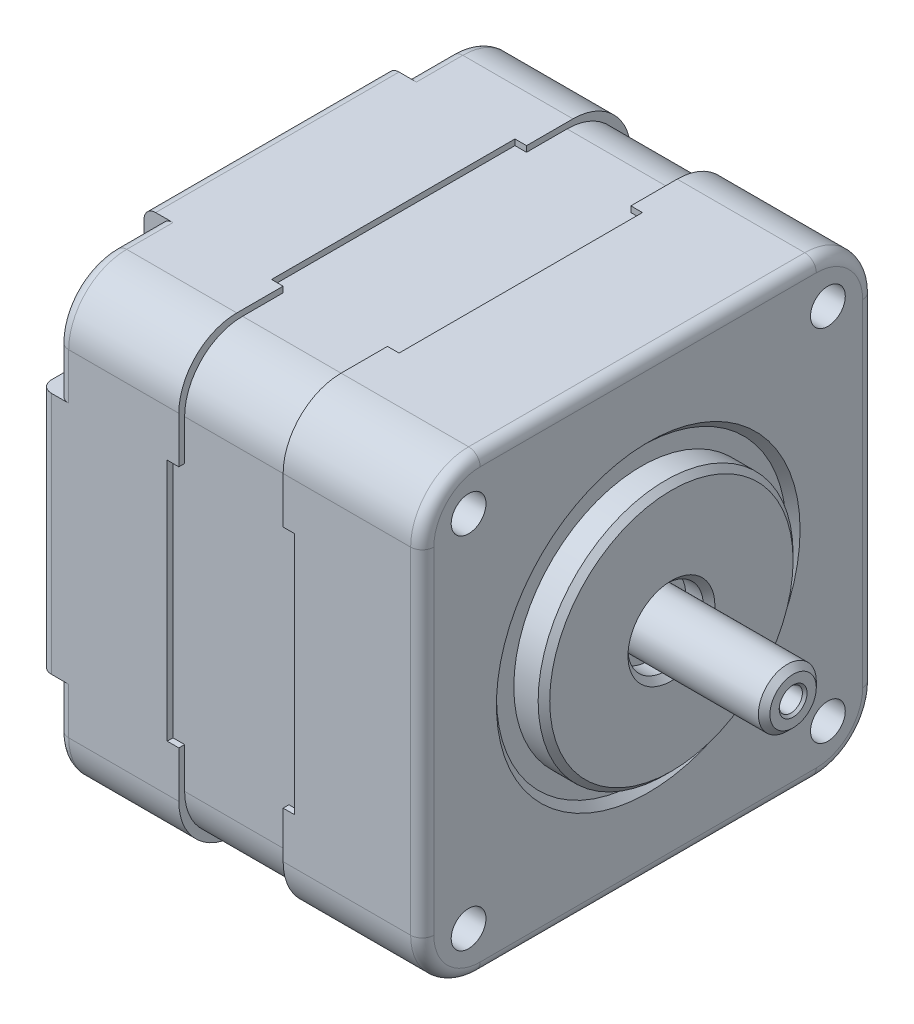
ISO-10303-21;
HEADER;
FILE_DESCRIPTION(('STEP AP214'),'2;1');
FILE_NAME('part.step','',(''),(''),'','','');
FILE_SCHEMA(('AUTOMOTIVE_DESIGN { 1 0 10303 214 1 1 1 1 }'));
ENDSEC;
DATA;
#1=APPLICATION_CONTEXT('core data for automotive mechanical design processes');
#2=APPLICATION_PROTOCOL_DEFINITION('international standard','automotive_design',2000,#1);
#3=PRODUCT_CONTEXT('',#1,'mechanical');
#4=PRODUCT('Part','Part','',(#3));
#5=PRODUCT_RELATED_PRODUCT_CATEGORY('part','',(#4));
#6=PRODUCT_DEFINITION_FORMATION('','',#4);
#7=PRODUCT_DEFINITION_CONTEXT('part definition',#1,'design');
#8=PRODUCT_DEFINITION('design','',#6,#7);
#9=PRODUCT_DEFINITION_SHAPE('','',#8);
#10=(LENGTH_UNIT() NAMED_UNIT(*) SI_UNIT(.MILLI.,.METRE.));
#11=(NAMED_UNIT(*) PLANE_ANGLE_UNIT() SI_UNIT($,.RADIAN.));
#12=(NAMED_UNIT(*) SI_UNIT($,.STERADIAN.) SOLID_ANGLE_UNIT());
#13=UNCERTAINTY_MEASURE_WITH_UNIT(LENGTH_MEASURE(1.E-05),#10,'distance_accuracy_value','');
#14=(GEOMETRIC_REPRESENTATION_CONTEXT(3) GLOBAL_UNCERTAINTY_ASSIGNED_CONTEXT((#13)) GLOBAL_UNIT_ASSIGNED_CONTEXT((#10,
#11,#12)) REPRESENTATION_CONTEXT('',''));
#15=CARTESIAN_POINT('',(0.,0.,0.));
#16=DIRECTION('',(0.,0.,1.));
#17=DIRECTION('',(1.,0.,0.));
#18=AXIS2_PLACEMENT_3D('',#15,#16,#17);
#19=CARTESIAN_POINT('',(-4.5,0.,0.));
#20=DIRECTION('',(1.,0.,0.));
#21=DIRECTION('',(0.,0.,-1.));
#22=AXIS2_PLACEMENT_3D('',#19,#20,#21);
#23=PLANE('',#22);
#24=DIRECTION('',(0.,0.,1.));
#25=VECTOR('',#24,1.);
#26=CARTESIAN_POINT('',(-4.5,19.5,-19.5));
#27=LINE('',#26,#25);
#28=CARTESIAN_POINT('',(-4.5,19.5,10.5));
#29=VERTEX_POINT('',#28);
#30=CARTESIAN_POINT('',(-4.5,19.5,14.5));
#31=VERTEX_POINT('',#30);
#32=EDGE_CURVE('E824',#29,#31,#27,.T.);
#33=ORIENTED_EDGE('',*,*,#32,.T.);
#34=CARTESIAN_POINT('',(-4.5,14.5,14.5));
#35=DIRECTION('',(1.,0.,0.));
#36=DIRECTION('',(0.,0.,-1.));
#37=AXIS2_PLACEMENT_3D('',#34,#35,#36);
#38=CIRCLE('',#37,5.);
#39=CARTESIAN_POINT('',(-4.5,14.5,19.5));
#40=VERTEX_POINT('',#39);
#41=EDGE_CURVE('E1162',#31,#40,#38,.T.);
#42=ORIENTED_EDGE('',*,*,#41,.T.);
#43=DIRECTION('',(0.,-1.,0.));
#44=VECTOR('',#43,1.);
#45=CARTESIAN_POINT('',(-4.5,19.5,19.5));
#46=LINE('',#45,#44);
#47=CARTESIAN_POINT('',(-4.5,10.5,19.5));
#48=VERTEX_POINT('',#47);
#49=EDGE_CURVE('E816',#40,#48,#46,.T.);
#50=ORIENTED_EDGE('',*,*,#49,.T.);
#51=DIRECTION('',(0.,0.,-1.));
#52=VECTOR('',#51,1.);
#53=CARTESIAN_POINT('',(-4.5,10.5,19.5));
#54=LINE('',#53,#52);
#55=CARTESIAN_POINT('',(-4.5,10.5,19.));
#56=VERTEX_POINT('',#55);
#57=EDGE_CURVE('E777',#48,#56,#54,.T.);
#58=ORIENTED_EDGE('',*,*,#57,.T.);
#59=DIRECTION('',(0.,-1.,0.));
#60=VECTOR('',#59,1.);
#61=CARTESIAN_POINT('',(-4.5,19.,19.));
#62=LINE('',#61,#60);
#63=CARTESIAN_POINT('',(-4.5,14.,19.));
#64=VERTEX_POINT('',#63);
#65=EDGE_CURVE('E851',#64,#56,#62,.T.);
#66=ORIENTED_EDGE('',*,*,#65,.F.);
#67=CARTESIAN_POINT('',(-4.5,14.,14.));
#68=DIRECTION('',(1.,0.,0.));
#69=DIRECTION('',(0.,0.,-1.));
#70=AXIS2_PLACEMENT_3D('',#67,#68,#69);
#71=CIRCLE('',#70,5.);
#72=CARTESIAN_POINT('',(-4.5,19.,14.));
#73=VERTEX_POINT('',#72);
#74=EDGE_CURVE('E1563',#64,#73,#71,.F.);
#75=ORIENTED_EDGE('',*,*,#74,.T.);
#76=DIRECTION('',(0.,0.,1.));
#77=VECTOR('',#76,1.);
#78=CARTESIAN_POINT('',(-4.5,19.,-19.));
#79=LINE('',#78,#77);
#80=CARTESIAN_POINT('',(-4.5,19.,10.5));
#81=VERTEX_POINT('',#80);
#82=EDGE_CURVE('E601',#81,#73,#79,.T.);
#83=ORIENTED_EDGE('',*,*,#82,.F.);
#84=DIRECTION('',(0.,1.,0.));
#85=VECTOR('',#84,1.);
#86=CARTESIAN_POINT('',(-4.5,19.,10.5));
#87=LINE('',#86,#85);
#88=EDGE_CURVE('E641',#81,#29,#87,.T.);
#89=ORIENTED_EDGE('',*,*,#88,.T.);
#90=EDGE_LOOP('',(#33,#42,#50,#58,#66,#75,#83,#89));
#91=FACE_BOUND('',#90,.T.);
#92=ADVANCED_FACE('F35',(#91),#23,.T.);
#93=DIRECTION('',(0.,1.,0.));
#94=VECTOR('',#93,1.);
#95=CARTESIAN_POINT('',(-4.5,-19.5,-19.5));
#96=LINE('',#95,#94);
#97=CARTESIAN_POINT('',(-4.5,10.5,-19.5));
#98=VERTEX_POINT('',#97);
#99=CARTESIAN_POINT('',(-4.5,14.5,-19.5));
#100=VERTEX_POINT('',#99);
#101=EDGE_CURVE('E821',#98,#100,#96,.T.);
#102=ORIENTED_EDGE('',*,*,#101,.T.);
#103=CARTESIAN_POINT('',(-4.5,14.5,-14.5));
#104=DIRECTION('',(1.,0.,0.));
#105=DIRECTION('',(0.,0.,-1.));
#106=AXIS2_PLACEMENT_3D('',#103,#104,#105);
#107=CIRCLE('',#106,5.);
#108=CARTESIAN_POINT('',(-4.5,19.5,-14.5));
#109=VERTEX_POINT('',#108);
#110=EDGE_CURVE('E1189',#100,#109,#107,.T.);
#111=ORIENTED_EDGE('',*,*,#110,.T.);
#112=CARTESIAN_POINT('',(-4.5,19.5,-10.5));
#113=VERTEX_POINT('',#112);
#114=EDGE_CURVE('E617',#109,#113,#27,.T.);
#115=ORIENTED_EDGE('',*,*,#114,.T.);
#116=DIRECTION('',(0.,1.,0.));
#117=VECTOR('',#116,1.);
#118=CARTESIAN_POINT('',(-4.5,19.,-10.5));
#119=LINE('',#118,#117);
#120=CARTESIAN_POINT('',(-4.5,19.,-10.5));
#121=VERTEX_POINT('',#120);
#122=EDGE_CURVE('E607',#121,#113,#119,.T.);
#123=ORIENTED_EDGE('',*,*,#122,.F.);
#124=CARTESIAN_POINT('',(-4.5,19.,-14.));
#125=VERTEX_POINT('',#124);
#126=EDGE_CURVE('E588',#125,#121,#79,.T.);
#127=ORIENTED_EDGE('',*,*,#126,.F.);
#128=CARTESIAN_POINT('',(-4.5,14.,-14.));
#129=DIRECTION('',(1.,0.,0.));
#130=DIRECTION('',(0.,0.,-1.));
#131=AXIS2_PLACEMENT_3D('',#128,#129,#130);
#132=CIRCLE('',#131,5.);
#133=CARTESIAN_POINT('',(-4.5,14.,-19.));
#134=VERTEX_POINT('',#133);
#135=EDGE_CURVE('E1180',#125,#134,#132,.F.);
#136=ORIENTED_EDGE('',*,*,#135,.T.);
#137=DIRECTION('',(0.,1.,0.));
#138=VECTOR('',#137,1.);
#139=CARTESIAN_POINT('',(-4.5,-19.,-19.));
#140=LINE('',#139,#138);
#141=CARTESIAN_POINT('',(-4.5,10.5,-19.));
#142=VERTEX_POINT('',#141);
#143=EDGE_CURVE('E856',#142,#134,#140,.T.);
#144=ORIENTED_EDGE('',*,*,#143,.F.);
#145=DIRECTION('',(0.,0.,-1.));
#146=VECTOR('',#145,1.);
#147=CARTESIAN_POINT('',(-4.5,10.5,-19.));
#148=LINE('',#147,#146);
#149=EDGE_CURVE('E645',#142,#98,#148,.T.);
#150=ORIENTED_EDGE('',*,*,#149,.T.);
#151=EDGE_LOOP('',(#102,#111,#115,#123,#127,#136,#144,#150));
#152=FACE_BOUND('',#151,.T.);
#153=ADVANCED_FACE('F615',(#152),#23,.T.);
#154=DIRECTION('',(0.,0.,-1.));
#155=VECTOR('',#154,1.);
#156=CARTESIAN_POINT('',(-4.5,-19.5,19.5));
#157=LINE('',#156,#155);
#158=CARTESIAN_POINT('',(-4.5,-19.5,-10.5));
#159=VERTEX_POINT('',#158);
#160=CARTESIAN_POINT('',(-4.5,-19.5,-14.5));
#161=VERTEX_POINT('',#160);
#162=EDGE_CURVE('E818',#159,#161,#157,.T.);
#163=ORIENTED_EDGE('',*,*,#162,.T.);
#164=CARTESIAN_POINT('',(-4.5,-14.5,-14.5));
#165=DIRECTION('',(1.,0.,0.));
#166=DIRECTION('',(0.,0.,-1.));
#167=AXIS2_PLACEMENT_3D('',#164,#165,#166);
#168=CIRCLE('',#167,5.);
#169=CARTESIAN_POINT('',(-4.5,-14.5,-19.5));
#170=VERTEX_POINT('',#169);
#171=EDGE_CURVE('E1197',#161,#170,#168,.T.);
#172=ORIENTED_EDGE('',*,*,#171,.T.);
#173=CARTESIAN_POINT('',(-4.5,-10.5,-19.5));
#174=VERTEX_POINT('',#173);
#175=EDGE_CURVE('E822',#170,#174,#96,.T.);
#176=ORIENTED_EDGE('',*,*,#175,.T.);
#177=DIRECTION('',(0.,0.,-1.));
#178=VECTOR('',#177,1.);
#179=CARTESIAN_POINT('',(-4.5,-10.5,-19.));
#180=LINE('',#179,#178);
#181=CARTESIAN_POINT('',(-4.5,-10.5,-19.));
#182=VERTEX_POINT('',#181);
#183=EDGE_CURVE('E636',#182,#174,#180,.T.);
#184=ORIENTED_EDGE('',*,*,#183,.F.);
#185=CARTESIAN_POINT('',(-4.5,-14.,-19.));
#186=VERTEX_POINT('',#185);
#187=EDGE_CURVE('E857',#186,#182,#140,.T.);
#188=ORIENTED_EDGE('',*,*,#187,.F.);
#189=CARTESIAN_POINT('',(-4.5,-14.,-14.));
#190=DIRECTION('',(1.,0.,0.));
#191=DIRECTION('',(0.,0.,-1.));
#192=AXIS2_PLACEMENT_3D('',#189,#190,#191);
#193=CIRCLE('',#192,5.);
#194=CARTESIAN_POINT('',(-4.5,-19.,-14.));
#195=VERTEX_POINT('',#194);
#196=EDGE_CURVE('E1567',#186,#195,#193,.F.);
#197=ORIENTED_EDGE('',*,*,#196,.T.);
#198=DIRECTION('',(0.,0.,-1.));
#199=VECTOR('',#198,1.);
#200=CARTESIAN_POINT('',(-4.5,-19.,19.));
#201=LINE('',#200,#199);
#202=CARTESIAN_POINT('',(-4.5,-19.,-10.5));
#203=VERTEX_POINT('',#202);
#204=EDGE_CURVE('E853',#203,#195,#201,.T.);
#205=ORIENTED_EDGE('',*,*,#204,.F.);
#206=DIRECTION('',(0.,-1.,0.));
#207=VECTOR('',#206,1.);
#208=CARTESIAN_POINT('',(-4.5,-19.,-10.5));
#209=LINE('',#208,#207);
#210=EDGE_CURVE('E664',#203,#159,#209,.T.);
#211=ORIENTED_EDGE('',*,*,#210,.T.);
#212=EDGE_LOOP('',(#163,#172,#176,#184,#188,#197,#205,#211));
#213=FACE_BOUND('',#212,.T.);
#214=ADVANCED_FACE('F1077',(#213),#23,.T.);
#215=CARTESIAN_POINT('',(4.5,-19.5,-19.));
#216=DIRECTION('',(1.,0.,0.));
#217=DIRECTION('',(0.,0.,-1.));
#218=AXIS2_PLACEMENT_3D('',#215,#216,#217);
#219=PLANE('',#218);
#220=DIRECTION('',(0.,-1.,0.));
#221=VECTOR('',#220,1.);
#222=CARTESIAN_POINT('',(4.5,-19.5,19.5));
#223=LINE('',#222,#221);
#224=CARTESIAN_POINT('',(4.5,14.5,19.5));
#225=VERTEX_POINT('',#224);
#226=CARTESIAN_POINT('',(4.5,10.5,19.5));
#227=VERTEX_POINT('',#226);
#228=EDGE_CURVE('E827',#225,#227,#223,.T.);
#229=ORIENTED_EDGE('',*,*,#228,.F.);
#230=CARTESIAN_POINT('',(4.5,14.5,14.5));
#231=DIRECTION('',(1.,0.,0.));
#232=DIRECTION('',(0.,0.,-1.));
#233=AXIS2_PLACEMENT_3D('',#230,#231,#232);
#234=CIRCLE('',#233,5.);
#235=CARTESIAN_POINT('',(4.5,19.5,14.5));
#236=VERTEX_POINT('',#235);
#237=EDGE_CURVE('E1193',#225,#236,#234,.F.);
#238=ORIENTED_EDGE('',*,*,#237,.T.);
#239=DIRECTION('',(0.,0.,1.));
#240=VECTOR('',#239,1.);
#241=CARTESIAN_POINT('',(4.5,19.5,19.));
#242=LINE('',#241,#240);
#243=CARTESIAN_POINT('',(4.5,19.5,10.5));
#244=VERTEX_POINT('',#243);
#245=EDGE_CURVE('E842',#244,#236,#242,.T.);
#246=ORIENTED_EDGE('',*,*,#245,.F.);
#247=DIRECTION('',(0.,1.,0.));
#248=VECTOR('',#247,1.);
#249=CARTESIAN_POINT('',(4.5,19.,10.5));
#250=LINE('',#249,#248);
#251=CARTESIAN_POINT('',(4.5,19.,10.5));
#252=VERTEX_POINT('',#251);
#253=EDGE_CURVE('E685',#252,#244,#250,.T.);
#254=ORIENTED_EDGE('',*,*,#253,.F.);
#255=DIRECTION('',(0.,0.,1.));
#256=VECTOR('',#255,1.);
#257=CARTESIAN_POINT('',(4.5,19.,19.));
#258=LINE('',#257,#256);
#259=CARTESIAN_POINT('',(4.5,19.,14.));
#260=VERTEX_POINT('',#259);
#261=EDGE_CURVE('E836',#252,#260,#258,.T.);
#262=ORIENTED_EDGE('',*,*,#261,.T.);
#263=CARTESIAN_POINT('',(4.5,14.,14.));
#264=DIRECTION('',(1.,0.,0.));
#265=DIRECTION('',(0.,0.,-1.));
#266=AXIS2_PLACEMENT_3D('',#263,#264,#265);
#267=CIRCLE('',#266,5.);
#268=CARTESIAN_POINT('',(4.5,14.,19.));
#269=VERTEX_POINT('',#268);
#270=EDGE_CURVE('E1561',#260,#269,#267,.T.);
#271=ORIENTED_EDGE('',*,*,#270,.T.);
#272=DIRECTION('',(0.,-1.,0.));
#273=VECTOR('',#272,1.);
#274=CARTESIAN_POINT('',(4.5,-19.5,19.));
#275=LINE('',#274,#273);
#276=CARTESIAN_POINT('',(4.5,10.5,19.));
#277=VERTEX_POINT('',#276);
#278=EDGE_CURVE('E830',#269,#277,#275,.T.);
#279=ORIENTED_EDGE('',*,*,#278,.T.);
#280=DIRECTION('',(0.,0.,1.));
#281=VECTOR('',#280,1.);
#282=CARTESIAN_POINT('',(4.5,10.5,19.));
#283=LINE('',#282,#281);
#284=EDGE_CURVE('E726',#277,#227,#283,.T.);
#285=ORIENTED_EDGE('',*,*,#284,.T.);
#286=EDGE_LOOP('',(#229,#238,#246,#254,#262,#271,#279,#285));
#287=FACE_BOUND('',#286,.T.);
#288=ADVANCED_FACE('F1114',(#287),#219,.F.);
#289=CARTESIAN_POINT('',(4.5,19.5,-14.5));
#290=VERTEX_POINT('',#289);
#291=CARTESIAN_POINT('',(4.5,19.5,-10.5));
#292=VERTEX_POINT('',#291);
#293=EDGE_CURVE('E839',#290,#292,#242,.T.);
#294=ORIENTED_EDGE('',*,*,#293,.F.);
#295=CARTESIAN_POINT('',(4.5,14.5,-14.5));
#296=DIRECTION('',(1.,0.,0.));
#297=DIRECTION('',(0.,0.,-1.));
#298=AXIS2_PLACEMENT_3D('',#295,#296,#297);
#299=CIRCLE('',#298,5.);
#300=CARTESIAN_POINT('',(4.5,14.5,-19.5));
#301=VERTEX_POINT('',#300);
#302=EDGE_CURVE('E1195',#290,#301,#299,.F.);
#303=ORIENTED_EDGE('',*,*,#302,.T.);
#304=DIRECTION('',(0.,1.,0.));
#305=VECTOR('',#304,1.);
#306=CARTESIAN_POINT('',(4.5,19.5,-19.5));
#307=LINE('',#306,#305);
#308=CARTESIAN_POINT('',(4.5,10.5,-19.5));
#309=VERTEX_POINT('',#308);
#310=EDGE_CURVE('E829',#309,#301,#307,.T.);
#311=ORIENTED_EDGE('',*,*,#310,.F.);
#312=DIRECTION('',(0.,0.,-1.));
#313=VECTOR('',#312,1.);
#314=CARTESIAN_POINT('',(4.5,10.5,-19.5));
#315=LINE('',#314,#313);
#316=CARTESIAN_POINT('',(4.5,10.5,-19.));
#317=VERTEX_POINT('',#316);
#318=EDGE_CURVE('E793',#317,#309,#315,.T.);
#319=ORIENTED_EDGE('',*,*,#318,.F.);
#320=DIRECTION('',(0.,1.,0.));
#321=VECTOR('',#320,1.);
#322=CARTESIAN_POINT('',(4.5,19.5,-19.));
#323=LINE('',#322,#321);
#324=CARTESIAN_POINT('',(4.5,14.,-19.));
#325=VERTEX_POINT('',#324);
#326=EDGE_CURVE('E600',#317,#325,#323,.T.);
#327=ORIENTED_EDGE('',*,*,#326,.T.);
#328=CARTESIAN_POINT('',(4.5,14.,-14.));
#329=DIRECTION('',(1.,0.,0.));
#330=DIRECTION('',(0.,0.,-1.));
#331=AXIS2_PLACEMENT_3D('',#328,#329,#330);
#332=CIRCLE('',#331,5.);
#333=CARTESIAN_POINT('',(4.5,19.,-14.));
#334=VERTEX_POINT('',#333);
#335=EDGE_CURVE('E1184',#325,#334,#332,.T.);
#336=ORIENTED_EDGE('',*,*,#335,.T.);
#337=CARTESIAN_POINT('',(4.5,19.,-10.5));
#338=VERTEX_POINT('',#337);
#339=EDGE_CURVE('E843',#334,#338,#258,.T.);
#340=ORIENTED_EDGE('',*,*,#339,.T.);
#341=DIRECTION('',(0.,-1.,0.));
#342=VECTOR('',#341,1.);
#343=CARTESIAN_POINT('',(4.5,19.5,-10.5));
#344=LINE('',#343,#342);
#345=EDGE_CURVE('E673',#292,#338,#344,.T.);
#346=ORIENTED_EDGE('',*,*,#345,.F.);
#347=EDGE_LOOP('',(#294,#303,#311,#319,#327,#336,#340,#346));
#348=FACE_BOUND('',#347,.T.);
#349=ADVANCED_FACE('F1571',(#348),#219,.F.);
#350=DIRECTION('',(0.,0.,-1.));
#351=VECTOR('',#350,1.);
#352=CARTESIAN_POINT('',(4.5,-19.5,-19.));
#353=LINE('',#352,#351);
#354=CARTESIAN_POINT('',(4.5,-19.5,14.5));
#355=VERTEX_POINT('',#354);
#356=CARTESIAN_POINT('',(4.5,-19.5,10.5));
#357=VERTEX_POINT('',#356);
#358=EDGE_CURVE('E845',#355,#357,#353,.T.);
#359=ORIENTED_EDGE('',*,*,#358,.F.);
#360=CARTESIAN_POINT('',(4.5,-14.5,14.5));
#361=DIRECTION('',(1.,0.,0.));
#362=DIRECTION('',(0.,0.,-1.));
#363=AXIS2_PLACEMENT_3D('',#360,#361,#362);
#364=CIRCLE('',#363,5.);
#365=CARTESIAN_POINT('',(4.5,-14.5,19.5));
#366=VERTEX_POINT('',#365);
#367=EDGE_CURVE('E1182',#355,#366,#364,.F.);
#368=ORIENTED_EDGE('',*,*,#367,.T.);
#369=CARTESIAN_POINT('',(4.5,-10.5,19.5));
#370=VERTEX_POINT('',#369);
#371=EDGE_CURVE('E826',#370,#366,#223,.T.);
#372=ORIENTED_EDGE('',*,*,#371,.F.);
#373=DIRECTION('',(0.,0.,1.));
#374=VECTOR('',#373,1.);
#375=CARTESIAN_POINT('',(4.5,-10.5,19.));
#376=LINE('',#375,#374);
#377=CARTESIAN_POINT('',(4.5,-10.5,19.));
#378=VERTEX_POINT('',#377);
#379=EDGE_CURVE('E718',#378,#370,#376,.T.);
#380=ORIENTED_EDGE('',*,*,#379,.F.);
#381=CARTESIAN_POINT('',(4.5,-14.,19.));
#382=VERTEX_POINT('',#381);
#383=EDGE_CURVE('E833',#378,#382,#275,.T.);
#384=ORIENTED_EDGE('',*,*,#383,.T.);
#385=CARTESIAN_POINT('',(4.5,-14.,14.));
#386=DIRECTION('',(1.,0.,0.));
#387=DIRECTION('',(0.,0.,-1.));
#388=AXIS2_PLACEMENT_3D('',#385,#386,#387);
#389=CIRCLE('',#388,5.);
#390=CARTESIAN_POINT('',(4.5,-19.,14.));
#391=VERTEX_POINT('',#390);
#392=EDGE_CURVE('E1557',#382,#391,#389,.T.);
#393=ORIENTED_EDGE('',*,*,#392,.T.);
#394=DIRECTION('',(0.,0.,-1.));
#395=VECTOR('',#394,1.);
#396=CARTESIAN_POINT('',(4.5,-19.,-19.));
#397=LINE('',#396,#395);
#398=CARTESIAN_POINT('',(4.5,-19.,10.5));
#399=VERTEX_POINT('',#398);
#400=EDGE_CURVE('E849',#391,#399,#397,.T.);
#401=ORIENTED_EDGE('',*,*,#400,.T.);
#402=DIRECTION('',(0.,-1.,0.));
#403=VECTOR('',#402,1.);
#404=CARTESIAN_POINT('',(4.5,-19.,10.5));
#405=LINE('',#404,#403);
#406=EDGE_CURVE('E745',#399,#357,#405,.T.);
#407=ORIENTED_EDGE('',*,*,#406,.T.);
#408=EDGE_LOOP('',(#359,#368,#372,#380,#384,#393,#401,#407));
#409=FACE_BOUND('',#408,.T.);
#410=ADVANCED_FACE('F1115',(#409),#219,.F.);
#411=CARTESIAN_POINT('',(-4.5,19.,19.));
#412=DIRECTION('',(0.,0.,1.));
#413=DIRECTION('',(1.,0.,0.));
#414=AXIS2_PLACEMENT_3D('',#411,#412,#413);
#415=PLANE('',#414);
#416=CARTESIAN_POINT('',(-4.5,-10.5,19.));
#417=VERTEX_POINT('',#416);
#418=CARTESIAN_POINT('',(-4.5,-14.,19.));
#419=VERTEX_POINT('',#418);
#420=EDGE_CURVE('E847',#417,#419,#62,.T.);
#421=ORIENTED_EDGE('',*,*,#420,.T.);
#422=DIRECTION('',(1.,0.,0.));
#423=VECTOR('',#422,1.);
#424=CARTESIAN_POINT('',(-4.5,-14.,19.));
#425=LINE('',#424,#423);
#426=EDGE_CURVE('E1540',#419,#382,#425,.T.);
#427=ORIENTED_EDGE('',*,*,#426,.T.);
#428=ORIENTED_EDGE('',*,*,#383,.F.);
#429=DIRECTION('',(1.,0.,0.));
#430=VECTOR('',#429,1.);
#431=CARTESIAN_POINT('',(4.5,-10.5,19.));
#432=LINE('',#431,#430);
#433=CARTESIAN_POINT('',(5.5,-10.5,19.));
#434=VERTEX_POINT('',#433);
#435=EDGE_CURVE('E708',#378,#434,#432,.T.);
#436=ORIENTED_EDGE('',*,*,#435,.T.);
#437=DIRECTION('',(0.,1.,0.));
#438=VECTOR('',#437,1.);
#439=CARTESIAN_POINT('',(5.5,-10.5,19.));
#440=LINE('',#439,#438);
#441=CARTESIAN_POINT('',(5.5,10.5,19.));
#442=VERTEX_POINT('',#441);
#443=EDGE_CURVE('E711',#434,#442,#440,.T.);
#444=ORIENTED_EDGE('',*,*,#443,.T.);
#445=DIRECTION('',(-1.,0.,0.));
#446=VECTOR('',#445,1.);
#447=CARTESIAN_POINT('',(5.5,10.5,19.));
#448=LINE('',#447,#446);
#449=EDGE_CURVE('E715',#442,#277,#448,.T.);
#450=ORIENTED_EDGE('',*,*,#449,.T.);
#451=ORIENTED_EDGE('',*,*,#278,.F.);
#452=DIRECTION('',(1.,0.,0.));
#453=VECTOR('',#452,1.);
#454=CARTESIAN_POINT('',(-4.5,14.,19.));
#455=LINE('',#454,#453);
#456=EDGE_CURVE('E1538',#269,#64,#455,.F.);
#457=ORIENTED_EDGE('',*,*,#456,.T.);
#458=ORIENTED_EDGE('',*,*,#65,.T.);
#459=DIRECTION('',(-1.,0.,0.));
#460=VECTOR('',#459,1.);
#461=CARTESIAN_POINT('',(16.501,10.5,19.));
#462=LINE('',#461,#460);
#463=CARTESIAN_POINT('',(-5.5,10.5,19.));
#464=VERTEX_POINT('',#463);
#465=EDGE_CURVE('E780',#56,#464,#462,.T.);
#466=ORIENTED_EDGE('',*,*,#465,.T.);
#467=DIRECTION('',(0.,-1.,0.));
#468=VECTOR('',#467,1.);
#469=CARTESIAN_POINT('',(-5.5,10.5,19.));
#470=LINE('',#469,#468);
#471=CARTESIAN_POINT('',(-5.5,-10.5,19.));
#472=VERTEX_POINT('',#471);
#473=EDGE_CURVE('E755',#464,#472,#470,.T.);
#474=ORIENTED_EDGE('',*,*,#473,.T.);
#475=DIRECTION('',(-1.,0.,0.));
#476=VECTOR('',#475,1.);
#477=CARTESIAN_POINT('',(16.501,-10.5,19.));
#478=LINE('',#477,#476);
#479=EDGE_CURVE('E783',#417,#472,#478,.T.);
#480=ORIENTED_EDGE('',*,*,#479,.F.);
#481=EDGE_LOOP('',(#421,#427,#428,#436,#444,#450,#451,#457,#458,#466,#474,#480));
#482=FACE_BOUND('',#481,.T.);
#483=ADVANCED_FACE('F1123',(#482),#415,.T.);
#484=CARTESIAN_POINT('',(-4.5,19.,-19.));
#485=DIRECTION('',(0.,1.,0.));
#486=DIRECTION('',(0.,0.,1.));
#487=AXIS2_PLACEMENT_3D('',#484,#485,#486);
#488=PLANE('',#487);
#489=ORIENTED_EDGE('',*,*,#82,.T.);
#490=DIRECTION('',(1.,0.,0.));
#491=VECTOR('',#490,1.);
#492=CARTESIAN_POINT('',(-4.5,19.,14.));
#493=LINE('',#492,#491);
#494=EDGE_CURVE('E1549',#73,#260,#493,.T.);
#495=ORIENTED_EDGE('',*,*,#494,.T.);
#496=ORIENTED_EDGE('',*,*,#261,.F.);
#497=DIRECTION('',(-1.,0.,0.));
#498=VECTOR('',#497,1.);
#499=CARTESIAN_POINT('',(5.5,19.,10.5));
#500=LINE('',#499,#498);
#501=CARTESIAN_POINT('',(5.5,19.,10.5));
#502=VERTEX_POINT('',#501);
#503=EDGE_CURVE('E701',#502,#252,#500,.T.);
#504=ORIENTED_EDGE('',*,*,#503,.F.);
#505=DIRECTION('',(0.,0.,1.));
#506=VECTOR('',#505,1.);
#507=CARTESIAN_POINT('',(5.5,19.,-10.5));
#508=LINE('',#507,#506);
#509=CARTESIAN_POINT('',(5.5,19.,-10.5));
#510=VERTEX_POINT('',#509);
#511=EDGE_CURVE('E688',#510,#502,#508,.T.);
#512=ORIENTED_EDGE('',*,*,#511,.F.);
#513=DIRECTION('',(-1.,0.,0.));
#514=VECTOR('',#513,1.);
#515=CARTESIAN_POINT('',(5.5,19.,-10.5));
#516=LINE('',#515,#514);
#517=EDGE_CURVE('E703',#510,#338,#516,.T.);
#518=ORIENTED_EDGE('',*,*,#517,.T.);
#519=ORIENTED_EDGE('',*,*,#339,.F.);
#520=DIRECTION('',(1.,0.,0.));
#521=VECTOR('',#520,1.);
#522=CARTESIAN_POINT('',(-4.5,19.,-14.));
#523=LINE('',#522,#521);
#524=EDGE_CURVE('E596',#334,#125,#523,.F.);
#525=ORIENTED_EDGE('',*,*,#524,.T.);
#526=ORIENTED_EDGE('',*,*,#126,.T.);
#527=DIRECTION('',(-1.,0.,0.));
#528=VECTOR('',#527,1.);
#529=CARTESIAN_POINT('',(-4.5,19.,-10.5));
#530=LINE('',#529,#528);
#531=CARTESIAN_POINT('',(-5.5,19.,-10.5));
#532=VERTEX_POINT('',#531);
#533=EDGE_CURVE('E593',#121,#532,#530,.T.);
#534=ORIENTED_EDGE('',*,*,#533,.T.);
#535=DIRECTION('',(0.,0.,1.));
#536=VECTOR('',#535,1.);
#537=CARTESIAN_POINT('',(-5.5,19.,-10.5));
#538=LINE('',#537,#536);
#539=CARTESIAN_POINT('',(-5.5,19.,10.5));
#540=VERTEX_POINT('',#539);
#541=EDGE_CURVE('E611',#532,#540,#538,.T.);
#542=ORIENTED_EDGE('',*,*,#541,.T.);
#543=DIRECTION('',(1.,0.,0.));
#544=VECTOR('',#543,1.);
#545=CARTESIAN_POINT('',(-5.5,19.,10.5));
#546=LINE('',#545,#544);
#547=EDGE_CURVE('E618',#540,#81,#546,.T.);
#548=ORIENTED_EDGE('',*,*,#547,.T.);
#549=EDGE_LOOP('',(#489,#495,#496,#504,#512,#518,#519,#525,#526,#534,#542,#548));
#550=FACE_BOUND('',#549,.T.);
#551=ADVANCED_FACE('F591',(#550),#488,.T.);
#552=CARTESIAN_POINT('',(-4.5,-19.,-19.));
#553=DIRECTION('',(0.,0.,-1.));
#554=DIRECTION('',(-1.,0.,0.));
#555=AXIS2_PLACEMENT_3D('',#552,#553,#554);
#556=PLANE('',#555);
#557=CARTESIAN_POINT('',(4.5,-14.,-19.));
#558=VERTEX_POINT('',#557);
#559=CARTESIAN_POINT('',(4.5,-10.5,-19.));
#560=VERTEX_POINT('',#559);
#561=EDGE_CURVE('E837',#558,#560,#323,.T.);
#562=ORIENTED_EDGE('',*,*,#561,.F.);
#563=DIRECTION('',(1.,0.,0.));
#564=VECTOR('',#563,1.);
#565=CARTESIAN_POINT('',(-4.5,-14.,-19.));
#566=LINE('',#565,#564);
#567=EDGE_CURVE('E1555',#558,#186,#566,.F.);
#568=ORIENTED_EDGE('',*,*,#567,.T.);
#569=ORIENTED_EDGE('',*,*,#187,.T.);
#570=DIRECTION('',(-1.,0.,0.));
#571=VECTOR('',#570,1.);
#572=CARTESIAN_POINT('',(-4.5,-10.5,-19.));
#573=LINE('',#572,#571);
#574=CARTESIAN_POINT('',(-5.5,-10.5,-19.));
#575=VERTEX_POINT('',#574);
#576=EDGE_CURVE('E626',#182,#575,#573,.T.);
#577=ORIENTED_EDGE('',*,*,#576,.T.);
#578=DIRECTION('',(0.,1.,0.));
#579=VECTOR('',#578,1.);
#580=CARTESIAN_POINT('',(-5.5,-10.5,-19.));
#581=LINE('',#580,#579);
#582=CARTESIAN_POINT('',(-5.5,10.5,-19.));
#583=VERTEX_POINT('',#582);
#584=EDGE_CURVE('E629',#575,#583,#581,.T.);
#585=ORIENTED_EDGE('',*,*,#584,.T.);
#586=DIRECTION('',(1.,0.,0.));
#587=VECTOR('',#586,1.);
#588=CARTESIAN_POINT('',(-5.5,10.5,-19.));
#589=LINE('',#588,#587);
#590=EDGE_CURVE('E633',#583,#142,#589,.T.);
#591=ORIENTED_EDGE('',*,*,#590,.T.);
#592=ORIENTED_EDGE('',*,*,#143,.T.);
#593=DIRECTION('',(1.,0.,0.));
#594=VECTOR('',#593,1.);
#595=CARTESIAN_POINT('',(-4.5,14.,-19.));
#596=LINE('',#595,#594);
#597=EDGE_CURVE('E1552',#134,#325,#596,.T.);
#598=ORIENTED_EDGE('',*,*,#597,.T.);
#599=ORIENTED_EDGE('',*,*,#326,.F.);
#600=DIRECTION('',(1.,0.,0.));
#601=VECTOR('',#600,1.);
#602=CARTESIAN_POINT('',(-16.501,10.5,-19.));
#603=LINE('',#602,#601);
#604=CARTESIAN_POINT('',(5.5,10.5,-19.));
#605=VERTEX_POINT('',#604);
#606=EDGE_CURVE('E808',#317,#605,#603,.T.);
#607=ORIENTED_EDGE('',*,*,#606,.T.);
#608=DIRECTION('',(0.,-1.,0.));
#609=VECTOR('',#608,1.);
#610=CARTESIAN_POINT('',(5.5,10.5,-19.));
#611=LINE('',#610,#609);
#612=CARTESIAN_POINT('',(5.5,-10.5,-19.));
#613=VERTEX_POINT('',#612);
#614=EDGE_CURVE('E803',#605,#613,#611,.T.);
#615=ORIENTED_EDGE('',*,*,#614,.T.);
#616=DIRECTION('',(1.,0.,0.));
#617=VECTOR('',#616,1.);
#618=CARTESIAN_POINT('',(-16.501,-10.5,-19.));
#619=LINE('',#618,#617);
#620=EDGE_CURVE('E788',#560,#613,#619,.T.);
#621=ORIENTED_EDGE('',*,*,#620,.F.);
#622=EDGE_LOOP('',(#562,#568,#569,#577,#585,#591,#592,#598,#599,#607,#615,#621));
#623=FACE_BOUND('',#622,.T.);
#624=ADVANCED_FACE('F1122',(#623),#556,.T.);
#625=CARTESIAN_POINT('',(-4.5,-19.,19.));
#626=DIRECTION('',(0.,-1.,0.));
#627=DIRECTION('',(0.,0.,-1.));
#628=AXIS2_PLACEMENT_3D('',#625,#626,#627);
#629=PLANE('',#628);
#630=ORIENTED_EDGE('',*,*,#400,.F.);
#631=DIRECTION('',(1.,0.,0.));
#632=VECTOR('',#631,1.);
#633=CARTESIAN_POINT('',(-4.5,-19.,14.));
#634=LINE('',#633,#632);
#635=CARTESIAN_POINT('',(-4.5,-19.,14.));
#636=VERTEX_POINT('',#635);
#637=EDGE_CURVE('E1546',#391,#636,#634,.F.);
#638=ORIENTED_EDGE('',*,*,#637,.T.);
#639=CARTESIAN_POINT('',(-4.5,-19.,10.5));
#640=VERTEX_POINT('',#639);
#641=EDGE_CURVE('E854',#636,#640,#201,.T.);
#642=ORIENTED_EDGE('',*,*,#641,.T.);
#643=DIRECTION('',(-1.,0.,0.));
#644=VECTOR('',#643,1.);
#645=CARTESIAN_POINT('',(-4.5,-19.,10.5));
#646=LINE('',#645,#644);
#647=CARTESIAN_POINT('',(-5.5,-19.,10.5));
#648=VERTEX_POINT('',#647);
#649=EDGE_CURVE('E657',#640,#648,#646,.T.);
#650=ORIENTED_EDGE('',*,*,#649,.T.);
#651=DIRECTION('',(0.,0.,-1.));
#652=VECTOR('',#651,1.);
#653=CARTESIAN_POINT('',(-5.5,-19.,10.5));
#654=LINE('',#653,#652);
#655=CARTESIAN_POINT('',(-5.5,-19.,-10.5));
#656=VERTEX_POINT('',#655);
#657=EDGE_CURVE('E661',#648,#656,#654,.T.);
#658=ORIENTED_EDGE('',*,*,#657,.T.);
#659=DIRECTION('',(1.,0.,0.));
#660=VECTOR('',#659,1.);
#661=CARTESIAN_POINT('',(-5.5,-19.,-10.5));
#662=LINE('',#661,#660);
#663=EDGE_CURVE('E655',#656,#203,#662,.T.);
#664=ORIENTED_EDGE('',*,*,#663,.T.);
#665=ORIENTED_EDGE('',*,*,#204,.T.);
#666=DIRECTION('',(1.,0.,0.));
#667=VECTOR('',#666,1.);
#668=CARTESIAN_POINT('',(-4.5,-19.,-14.));
#669=LINE('',#668,#667);
#670=CARTESIAN_POINT('',(4.5,-19.,-14.));
#671=VERTEX_POINT('',#670);
#672=EDGE_CURVE('E1543',#195,#671,#669,.T.);
#673=ORIENTED_EDGE('',*,*,#672,.T.);
#674=CARTESIAN_POINT('',(4.5,-19.,-10.5));
#675=VERTEX_POINT('',#674);
#676=EDGE_CURVE('E841',#675,#671,#397,.T.);
#677=ORIENTED_EDGE('',*,*,#676,.F.);
#678=DIRECTION('',(1.,0.,0.));
#679=VECTOR('',#678,1.);
#680=CARTESIAN_POINT('',(4.5,-19.,-10.5));
#681=LINE('',#680,#679);
#682=CARTESIAN_POINT('',(5.5,-19.,-10.5));
#683=VERTEX_POINT('',#682);
#684=EDGE_CURVE('E738',#675,#683,#681,.T.);
#685=ORIENTED_EDGE('',*,*,#684,.T.);
#686=DIRECTION('',(0.,0.,1.));
#687=VECTOR('',#686,1.);
#688=CARTESIAN_POINT('',(5.5,-19.,-10.5));
#689=LINE('',#688,#687);
#690=CARTESIAN_POINT('',(5.5,-19.,10.5));
#691=VERTEX_POINT('',#690);
#692=EDGE_CURVE('E742',#683,#691,#689,.T.);
#693=ORIENTED_EDGE('',*,*,#692,.T.);
#694=DIRECTION('',(-1.,0.,0.));
#695=VECTOR('',#694,1.);
#696=CARTESIAN_POINT('',(5.5,-19.,10.5));
#697=LINE('',#696,#695);
#698=EDGE_CURVE('E735',#691,#399,#697,.T.);
#699=ORIENTED_EDGE('',*,*,#698,.T.);
#700=EDGE_LOOP('',(#630,#638,#642,#650,#658,#664,#665,#673,#677,#685,#693,#699));
#701=FACE_BOUND('',#700,.T.);
#702=ADVANCED_FACE('F1118',(#701),#629,.T.);
#703=CARTESIAN_POINT('',(16.5,0.,0.));
#704=DIRECTION('',(1.,0.,0.));
#705=DIRECTION('',(0.,0.,-1.));
#706=AXIS2_PLACEMENT_3D('',#703,#704,#705);
#707=PLANE('',#706);
#708=CARTESIAN_POINT('',(16.5,-14.5,14.5));
#709=DIRECTION('',(1.,0.,0.));
#710=DIRECTION('',(0.,0.,-1.));
#711=AXIS2_PLACEMENT_3D('',#708,#709,#710);
#712=CIRCLE('',#711,4.);
#713=CARTESIAN_POINT('',(16.5,-14.5,18.5));
#714=VERTEX_POINT('',#713);
#715=CARTESIAN_POINT('',(16.5,-18.5,14.5));
#716=VERTEX_POINT('',#715);
#717=EDGE_CURVE('E1238',#714,#716,#712,.T.);
#718=ORIENTED_EDGE('',*,*,#717,.T.);
#719=DIRECTION('',(0.,0.,1.));
#720=VECTOR('',#719,1.);
#721=CARTESIAN_POINT('',(16.5,-18.5,-14.5));
#722=LINE('',#721,#720);
#723=CARTESIAN_POINT('',(16.5,-18.5,-14.5));
#724=VERTEX_POINT('',#723);
#725=EDGE_CURVE('E1240',#716,#724,#722,.F.);
#726=ORIENTED_EDGE('',*,*,#725,.T.);
#727=CARTESIAN_POINT('',(16.5,-14.5,-14.5));
#728=DIRECTION('',(1.,0.,0.));
#729=DIRECTION('',(0.,0.,-1.));
#730=AXIS2_PLACEMENT_3D('',#727,#728,#729);
#731=CIRCLE('',#730,4.);
#732=CARTESIAN_POINT('',(16.5,-14.5,-18.5));
#733=VERTEX_POINT('',#732);
#734=EDGE_CURVE('E1236',#724,#733,#731,.T.);
#735=ORIENTED_EDGE('',*,*,#734,.T.);
#736=DIRECTION('',(0.,-1.,0.));
#737=VECTOR('',#736,1.);
#738=CARTESIAN_POINT('',(16.5,14.5,-18.5));
#739=LINE('',#738,#737);
#740=CARTESIAN_POINT('',(16.5,14.5,-18.5));
#741=VERTEX_POINT('',#740);
#742=EDGE_CURVE('E1232',#733,#741,#739,.F.);
#743=ORIENTED_EDGE('',*,*,#742,.T.);
#744=CARTESIAN_POINT('',(16.5,14.5,-14.5));
#745=DIRECTION('',(1.,0.,0.));
#746=DIRECTION('',(0.,0.,-1.));
#747=AXIS2_PLACEMENT_3D('',#744,#745,#746);
#748=CIRCLE('',#747,4.);
#749=CARTESIAN_POINT('',(16.5,18.5,-14.5));
#750=VERTEX_POINT('',#749);
#751=EDGE_CURVE('E1228',#741,#750,#748,.T.);
#752=ORIENTED_EDGE('',*,*,#751,.T.);
#753=DIRECTION('',(0.,0.,-1.));
#754=VECTOR('',#753,1.);
#755=CARTESIAN_POINT('',(16.5,18.5,14.5));
#756=LINE('',#755,#754);
#757=CARTESIAN_POINT('',(16.5,18.5,14.5));
#758=VERTEX_POINT('',#757);
#759=EDGE_CURVE('E1226',#750,#758,#756,.F.);
#760=ORIENTED_EDGE('',*,*,#759,.T.);
#761=CARTESIAN_POINT('',(16.5,14.5,14.5));
#762=DIRECTION('',(1.,0.,0.));
#763=DIRECTION('',(0.,0.,-1.));
#764=AXIS2_PLACEMENT_3D('',#761,#762,#763);
#765=CIRCLE('',#764,4.);
#766=CARTESIAN_POINT('',(16.5,14.5,18.5));
#767=VERTEX_POINT('',#766);
#768=EDGE_CURVE('E1230',#758,#767,#765,.T.);
#769=ORIENTED_EDGE('',*,*,#768,.T.);
#770=DIRECTION('',(0.,1.,0.));
#771=VECTOR('',#770,1.);
#772=CARTESIAN_POINT('',(16.5,-14.5,18.5));
#773=LINE('',#772,#771);
#774=EDGE_CURVE('E1234',#767,#714,#773,.F.);
#775=ORIENTED_EDGE('',*,*,#774,.T.);
#776=EDGE_LOOP('',(#718,#726,#735,#743,#752,#760,#769,#775));
#777=FACE_BOUND('',#776,.T.);
#778=CARTESIAN_POINT('',(16.5,-15.5,15.5));
#779=DIRECTION('',(1.,0.,0.));
#780=DIRECTION('',(0.,0.,-1.));
#781=AXIS2_PLACEMENT_3D('',#778,#779,#780);
#782=CIRCLE('',#781,1.49999999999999);
#783=CARTESIAN_POINT('',(16.5,-15.5,14.));
#784=VERTEX_POINT('',#783);
#785=EDGE_CURVE('E867',#784,#784,#782,.T.);
#786=ORIENTED_EDGE('',*,*,#785,.F.);
#787=EDGE_LOOP('',(#786));
#788=FACE_BOUND('',#787,.T.);
#789=CARTESIAN_POINT('',(16.5,-15.5,-15.5));
#790=DIRECTION('',(1.,0.,0.));
#791=DIRECTION('',(0.,0.,-1.));
#792=AXIS2_PLACEMENT_3D('',#789,#790,#791);
#793=CIRCLE('',#792,1.49999999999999);
#794=CARTESIAN_POINT('',(16.5,-15.5,-17.));
#795=VERTEX_POINT('',#794);
#796=EDGE_CURVE('E1395',#795,#795,#793,.T.);
#797=ORIENTED_EDGE('',*,*,#796,.F.);
#798=EDGE_LOOP('',(#797));
#799=FACE_BOUND('',#798,.T.);
#800=CARTESIAN_POINT('',(16.5,15.5,-15.5));
#801=DIRECTION('',(1.,0.,0.));
#802=DIRECTION('',(0.,0.,-1.));
#803=AXIS2_PLACEMENT_3D('',#800,#801,#802);
#804=CIRCLE('',#803,1.49999999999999);
#805=CARTESIAN_POINT('',(16.5,15.5,-17.));
#806=VERTEX_POINT('',#805);
#807=EDGE_CURVE('E1398',#806,#806,#804,.T.);
#808=ORIENTED_EDGE('',*,*,#807,.F.);
#809=EDGE_LOOP('',(#808));
#810=FACE_BOUND('',#809,.T.);
#811=CARTESIAN_POINT('',(16.5,15.5,15.5));
#812=DIRECTION('',(1.,0.,0.));
#813=DIRECTION('',(0.,0.,-1.));
#814=AXIS2_PLACEMENT_3D('',#811,#812,#813);
#815=CIRCLE('',#814,1.49999999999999);
#816=CARTESIAN_POINT('',(16.5,15.5,14.));
#817=VERTEX_POINT('',#816);
#818=EDGE_CURVE('E866',#817,#817,#815,.T.);
#819=ORIENTED_EDGE('',*,*,#818,.F.);
#820=EDGE_LOOP('',(#819));
#821=FACE_BOUND('',#820,.T.);
#822=CARTESIAN_POINT('',(16.5,0.,0.));
#823=DIRECTION('',(1.,0.,0.));
#824=DIRECTION('',(0.,0.,-1.));
#825=AXIS2_PLACEMENT_3D('',#822,#823,#824);
#826=CIRCLE('',#825,13.1);
#827=CARTESIAN_POINT('',(16.5,0.,-13.1));
#828=VERTEX_POINT('',#827);
#829=EDGE_CURVE('E1477',#828,#828,#826,.T.);
#830=ORIENTED_EDGE('',*,*,#829,.F.);
#831=EDGE_LOOP('',(#830));
#832=FACE_BOUND('',#831,.T.);
#833=ADVANCED_FACE('F1112',(#777,#788,#799,#810,#821,#832),#707,.T.);
#834=CARTESIAN_POINT('',(4.5,-14.5,-19.5));
#835=VERTEX_POINT('',#834);
#836=CARTESIAN_POINT('',(4.5,-10.5,-19.5));
#837=VERTEX_POINT('',#836);
#838=EDGE_CURVE('E834',#835,#837,#307,.T.);
#839=ORIENTED_EDGE('',*,*,#838,.F.);
#840=CARTESIAN_POINT('',(4.5,-14.5,-14.5));
#841=DIRECTION('',(1.,0.,0.));
#842=DIRECTION('',(0.,0.,-1.));
#843=AXIS2_PLACEMENT_3D('',#840,#841,#842);
#844=CIRCLE('',#843,5.);
#845=CARTESIAN_POINT('',(4.5,-19.5,-14.5));
#846=VERTEX_POINT('',#845);
#847=EDGE_CURVE('E1191',#835,#846,#844,.F.);
#848=ORIENTED_EDGE('',*,*,#847,.T.);
#849=CARTESIAN_POINT('',(4.5,-19.5,-10.5));
#850=VERTEX_POINT('',#849);
#851=EDGE_CURVE('E848',#850,#846,#353,.T.);
#852=ORIENTED_EDGE('',*,*,#851,.F.);
#853=DIRECTION('',(0.,-1.,0.));
#854=VECTOR('',#853,1.);
#855=CARTESIAN_POINT('',(4.5,-19.,-10.5));
#856=LINE('',#855,#854);
#857=EDGE_CURVE('E758',#675,#850,#856,.T.);
#858=ORIENTED_EDGE('',*,*,#857,.F.);
#859=ORIENTED_EDGE('',*,*,#676,.T.);
#860=CARTESIAN_POINT('',(4.5,-14.,-14.));
#861=DIRECTION('',(1.,0.,0.));
#862=DIRECTION('',(0.,0.,-1.));
#863=AXIS2_PLACEMENT_3D('',#860,#861,#862);
#864=CIRCLE('',#863,5.);
#865=EDGE_CURVE('E1565',#671,#558,#864,.T.);
#866=ORIENTED_EDGE('',*,*,#865,.T.);
#867=ORIENTED_EDGE('',*,*,#561,.T.);
#868=DIRECTION('',(0.,0.,1.));
#869=VECTOR('',#868,1.);
#870=CARTESIAN_POINT('',(4.5,-10.5,-19.));
#871=LINE('',#870,#869);
#872=EDGE_CURVE('E789',#837,#560,#871,.T.);
#873=ORIENTED_EDGE('',*,*,#872,.F.);
#874=EDGE_LOOP('',(#839,#848,#852,#858,#859,#866,#867,#873));
#875=FACE_BOUND('',#874,.T.);
#876=ADVANCED_FACE('F1108',(#875),#219,.F.);
#877=CARTESIAN_POINT('',(0.,-19.5,0.));
#878=DIRECTION('',(0.,1.,0.));
#879=DIRECTION('',(0.,0.,1.));
#880=AXIS2_PLACEMENT_3D('',#877,#878,#879);
#881=PLANE('',#880);
#882=DIRECTION('',(-1.,0.,0.));
#883=VECTOR('',#882,1.);
#884=CARTESIAN_POINT('',(0.,-19.5,-14.5));
#885=LINE('',#884,#883);
#886=CARTESIAN_POINT('',(15.5,-19.5,-14.5));
#887=VERTEX_POINT('',#886);
#888=EDGE_CURVE('E1518',#846,#887,#885,.F.);
#889=ORIENTED_EDGE('',*,*,#888,.T.);
#890=DIRECTION('',(0.,0.,1.));
#891=VECTOR('',#890,1.);
#892=CARTESIAN_POINT('',(15.5,-19.5,14.5));
#893=LINE('',#892,#891);
#894=CARTESIAN_POINT('',(15.5,-19.5,14.5));
#895=VERTEX_POINT('',#894);
#896=EDGE_CURVE('E1223',#887,#895,#893,.T.);
#897=ORIENTED_EDGE('',*,*,#896,.T.);
#898=DIRECTION('',(1.,0.,0.));
#899=VECTOR('',#898,1.);
#900=CARTESIAN_POINT('',(0.,-19.5,14.5));
#901=LINE('',#900,#899);
#902=EDGE_CURVE('E1521',#895,#355,#901,.F.);
#903=ORIENTED_EDGE('',*,*,#902,.T.);
#904=ORIENTED_EDGE('',*,*,#358,.T.);
#905=DIRECTION('',(-1.,0.,0.));
#906=VECTOR('',#905,1.);
#907=CARTESIAN_POINT('',(5.5,-19.5,10.5));
#908=LINE('',#907,#906);
#909=CARTESIAN_POINT('',(5.5,-19.5,10.5));
#910=VERTEX_POINT('',#909);
#911=EDGE_CURVE('E729',#910,#357,#908,.T.);
#912=ORIENTED_EDGE('',*,*,#911,.F.);
#913=DIRECTION('',(0.,0.,1.));
#914=VECTOR('',#913,1.);
#915=CARTESIAN_POINT('',(5.5,-19.5,-10.5));
#916=LINE('',#915,#914);
#917=CARTESIAN_POINT('',(5.5,-19.5,-10.5));
#918=VERTEX_POINT('',#917);
#919=EDGE_CURVE('E739',#918,#910,#916,.T.);
#920=ORIENTED_EDGE('',*,*,#919,.F.);
#921=DIRECTION('',(1.,0.,0.));
#922=VECTOR('',#921,1.);
#923=CARTESIAN_POINT('',(4.5,-19.5,-10.5));
#924=LINE('',#923,#922);
#925=EDGE_CURVE('E748',#850,#918,#924,.T.);
#926=ORIENTED_EDGE('',*,*,#925,.F.);
#927=ORIENTED_EDGE('',*,*,#851,.T.);
#928=EDGE_LOOP('',(#889,#897,#903,#904,#912,#920,#926,#927));
#929=FACE_BOUND('',#928,.T.);
#930=ADVANCED_FACE('F1104',(#929),#881,.F.);
#931=CARTESIAN_POINT('',(0.,19.5,0.));
#932=DIRECTION('',(0.,-1.,0.));
#933=DIRECTION('',(0.,0.,-1.));
#934=AXIS2_PLACEMENT_3D('',#931,#932,#933);
#935=PLANE('',#934);
#936=DIRECTION('',(-1.,0.,0.));
#937=VECTOR('',#936,1.);
#938=CARTESIAN_POINT('',(0.,19.5,14.5));
#939=LINE('',#938,#937);
#940=CARTESIAN_POINT('',(15.5,19.5,14.5));
#941=VERTEX_POINT('',#940);
#942=EDGE_CURVE('E1535',#236,#941,#939,.F.);
#943=ORIENTED_EDGE('',*,*,#942,.T.);
#944=DIRECTION('',(0.,0.,-1.));
#945=VECTOR('',#944,1.);
#946=CARTESIAN_POINT('',(15.5,19.5,-14.5));
#947=LINE('',#946,#945);
#948=CARTESIAN_POINT('',(15.5,19.5,-14.5));
#949=VERTEX_POINT('',#948);
#950=EDGE_CURVE('E1255',#941,#949,#947,.T.);
#951=ORIENTED_EDGE('',*,*,#950,.T.);
#952=DIRECTION('',(1.,0.,0.));
#953=VECTOR('',#952,1.);
#954=CARTESIAN_POINT('',(0.,19.5,-14.5));
#955=LINE('',#954,#953);
#956=EDGE_CURVE('E1533',#949,#290,#955,.F.);
#957=ORIENTED_EDGE('',*,*,#956,.T.);
#958=ORIENTED_EDGE('',*,*,#293,.T.);
#959=DIRECTION('',(-1.,0.,0.));
#960=VECTOR('',#959,1.);
#961=CARTESIAN_POINT('',(5.5,19.5,-10.5));
#962=LINE('',#961,#960);
#963=CARTESIAN_POINT('',(5.5,19.5,-10.5));
#964=VERTEX_POINT('',#963);
#965=EDGE_CURVE('E693',#964,#292,#962,.T.);
#966=ORIENTED_EDGE('',*,*,#965,.F.);
#967=DIRECTION('',(0.,0.,-1.));
#968=VECTOR('',#967,1.);
#969=CARTESIAN_POINT('',(5.5,19.5,10.5));
#970=LINE('',#969,#968);
#971=CARTESIAN_POINT('',(5.5,19.5,10.5));
#972=VERTEX_POINT('',#971);
#973=EDGE_CURVE('E681',#972,#964,#970,.T.);
#974=ORIENTED_EDGE('',*,*,#973,.F.);
#975=DIRECTION('',(-1.,0.,0.));
#976=VECTOR('',#975,1.);
#977=CARTESIAN_POINT('',(5.5,19.5,10.5));
#978=LINE('',#977,#976);
#979=EDGE_CURVE('E697',#972,#244,#978,.T.);
#980=ORIENTED_EDGE('',*,*,#979,.T.);
#981=ORIENTED_EDGE('',*,*,#245,.T.);
#982=EDGE_LOOP('',(#943,#951,#957,#958,#966,#974,#980,#981));
#983=FACE_BOUND('',#982,.T.);
#984=ADVANCED_FACE('F1100',(#983),#935,.F.);
#985=CARTESIAN_POINT('',(0.,0.,-19.5));
#986=DIRECTION('',(0.,0.,1.));
#987=DIRECTION('',(1.,0.,0.));
#988=AXIS2_PLACEMENT_3D('',#985,#986,#987);
#989=PLANE('',#988);
#990=DIRECTION('',(1.,0.,0.));
#991=VECTOR('',#990,1.);
#992=CARTESIAN_POINT('',(0.,14.5,-19.5));
#993=LINE('',#992,#991);
#994=CARTESIAN_POINT('',(15.5,14.5,-19.5));
#995=VERTEX_POINT('',#994);
#996=EDGE_CURVE('E1528',#301,#995,#993,.T.);
#997=ORIENTED_EDGE('',*,*,#996,.T.);
#998=DIRECTION('',(0.,-1.,0.));
#999=VECTOR('',#998,1.);
#1000=CARTESIAN_POINT('',(15.5,-14.5,-19.5));
#1001=LINE('',#1000,#999);
#1002=CARTESIAN_POINT('',(15.5,-14.5,-19.5));
#1003=VERTEX_POINT('',#1002);
#1004=EDGE_CURVE('E1249',#995,#1003,#1001,.T.);
#1005=ORIENTED_EDGE('',*,*,#1004,.T.);
#1006=DIRECTION('',(-1.,0.,0.));
#1007=VECTOR('',#1006,1.);
#1008=CARTESIAN_POINT('',(0.,-14.5,-19.5));
#1009=LINE('',#1008,#1007);
#1010=EDGE_CURVE('E1531',#1003,#835,#1009,.T.);
#1011=ORIENTED_EDGE('',*,*,#1010,.T.);
#1012=ORIENTED_EDGE('',*,*,#838,.T.);
#1013=DIRECTION('',(1.,0.,0.));
#1014=VECTOR('',#1013,1.);
#1015=CARTESIAN_POINT('',(-16.501,-10.5,-19.5));
#1016=LINE('',#1015,#1014);
#1017=CARTESIAN_POINT('',(5.5,-10.5,-19.5));
#1018=VERTEX_POINT('',#1017);
#1019=EDGE_CURVE('E806',#837,#1018,#1016,.T.);
#1020=ORIENTED_EDGE('',*,*,#1019,.T.);
#1021=DIRECTION('',(0.,1.,0.));
#1022=VECTOR('',#1021,1.);
#1023=CARTESIAN_POINT('',(5.5,-10.5,-19.5));
#1024=LINE('',#1023,#1022);
#1025=CARTESIAN_POINT('',(5.5,10.5,-19.5));
#1026=VERTEX_POINT('',#1025);
#1027=EDGE_CURVE('E797',#1018,#1026,#1024,.T.);
#1028=ORIENTED_EDGE('',*,*,#1027,.T.);
#1029=DIRECTION('',(1.,0.,0.));
#1030=VECTOR('',#1029,1.);
#1031=CARTESIAN_POINT('',(-16.501,10.5,-19.5));
#1032=LINE('',#1031,#1030);
#1033=EDGE_CURVE('E810',#309,#1026,#1032,.T.);
#1034=ORIENTED_EDGE('',*,*,#1033,.F.);
#1035=ORIENTED_EDGE('',*,*,#310,.T.);
#1036=EDGE_LOOP('',(#997,#1005,#1011,#1012,#1020,#1028,#1034,#1035));
#1037=FACE_BOUND('',#1036,.T.);
#1038=ADVANCED_FACE('F1096',(#1037),#989,.F.);
#1039=CARTESIAN_POINT('',(0.,0.,19.5));
#1040=DIRECTION('',(0.,0.,-1.));
#1041=DIRECTION('',(-1.,0.,0.));
#1042=AXIS2_PLACEMENT_3D('',#1039,#1040,#1041);
#1043=PLANE('',#1042);
#1044=DIRECTION('',(1.,0.,0.));
#1045=VECTOR('',#1044,1.);
#1046=CARTESIAN_POINT('',(0.,-14.5,19.5));
#1047=LINE('',#1046,#1045);
#1048=CARTESIAN_POINT('',(15.5,-14.5,19.5));
#1049=VERTEX_POINT('',#1048);
#1050=EDGE_CURVE('E1515',#366,#1049,#1047,.T.);
#1051=ORIENTED_EDGE('',*,*,#1050,.T.);
#1052=DIRECTION('',(0.,1.,0.));
#1053=VECTOR('',#1052,1.);
#1054=CARTESIAN_POINT('',(15.5,14.5,19.5));
#1055=LINE('',#1054,#1053);
#1056=CARTESIAN_POINT('',(15.5,14.5,19.5));
#1057=VERTEX_POINT('',#1056);
#1058=EDGE_CURVE('E1247',#1049,#1057,#1055,.T.);
#1059=ORIENTED_EDGE('',*,*,#1058,.T.);
#1060=DIRECTION('',(-1.,0.,0.));
#1061=VECTOR('',#1060,1.);
#1062=CARTESIAN_POINT('',(0.,14.5,19.5));
#1063=LINE('',#1062,#1061);
#1064=EDGE_CURVE('E1513',#1057,#225,#1063,.T.);
#1065=ORIENTED_EDGE('',*,*,#1064,.T.);
#1066=ORIENTED_EDGE('',*,*,#228,.T.);
#1067=DIRECTION('',(-1.,0.,0.));
#1068=VECTOR('',#1067,1.);
#1069=CARTESIAN_POINT('',(5.5,10.5,19.5));
#1070=LINE('',#1069,#1068);
#1071=CARTESIAN_POINT('',(5.5,10.5,19.5));
#1072=VERTEX_POINT('',#1071);
#1073=EDGE_CURVE('E712',#1072,#227,#1070,.T.);
#1074=ORIENTED_EDGE('',*,*,#1073,.F.);
#1075=DIRECTION('',(0.,1.,0.));
#1076=VECTOR('',#1075,1.);
#1077=CARTESIAN_POINT('',(5.5,-10.5,19.5));
#1078=LINE('',#1077,#1076);
#1079=CARTESIAN_POINT('',(5.5,-10.5,19.5));
#1080=VERTEX_POINT('',#1079);
#1081=EDGE_CURVE('E721',#1080,#1072,#1078,.T.);
#1082=ORIENTED_EDGE('',*,*,#1081,.F.);
#1083=DIRECTION('',(1.,0.,0.));
#1084=VECTOR('',#1083,1.);
#1085=CARTESIAN_POINT('',(4.5,-10.5,19.5));
#1086=LINE('',#1085,#1084);
#1087=EDGE_CURVE('E700',#370,#1080,#1086,.T.);
#1088=ORIENTED_EDGE('',*,*,#1087,.F.);
#1089=ORIENTED_EDGE('',*,*,#371,.T.);
#1090=EDGE_LOOP('',(#1051,#1059,#1065,#1066,#1074,#1082,#1088,#1089));
#1091=FACE_BOUND('',#1090,.T.);
#1092=ADVANCED_FACE('F1092',(#1091),#1043,.F.);
#1093=CARTESIAN_POINT('',(-16.5,19.5,19.5));
#1094=DIRECTION('',(0.,0.,1.));
#1095=DIRECTION('',(1.,0.,0.));
#1096=AXIS2_PLACEMENT_3D('',#1093,#1094,#1095);
#1097=PLANE('',#1096);
#1098=DIRECTION('',(1.,0.,0.));
#1099=VECTOR('',#1098,1.);
#1100=CARTESIAN_POINT('',(-16.5,14.5,19.5));
#1101=LINE('',#1100,#1099);
#1102=CARTESIAN_POINT('',(-14.,14.5,19.5));
#1103=VERTEX_POINT('',#1102);
#1104=EDGE_CURVE('E1178',#40,#1103,#1101,.F.);
#1105=ORIENTED_EDGE('',*,*,#1104,.T.);
#1106=DIRECTION('',(0.,1.,0.));
#1107=VECTOR('',#1106,1.);
#1108=CARTESIAN_POINT('',(-14.,10.5,19.5));
#1109=LINE('',#1108,#1107);
#1110=CARTESIAN_POINT('',(-14.,10.5,19.5));
#1111=VERTEX_POINT('',#1110);
#1112=EDGE_CURVE('E1211',#1103,#1111,#1109,.F.);
#1113=ORIENTED_EDGE('',*,*,#1112,.T.);
#1114=DIRECTION('',(1.,0.,0.));
#1115=VECTOR('',#1114,1.);
#1116=CARTESIAN_POINT('',(-16.5,10.5,19.5));
#1117=LINE('',#1116,#1115);
#1118=CARTESIAN_POINT('',(-15.5,10.5,19.5));
#1119=VERTEX_POINT('',#1118);
#1120=EDGE_CURVE('E1417',#1119,#1111,#1117,.T.);
#1121=ORIENTED_EDGE('',*,*,#1120,.F.);
#1122=DIRECTION('',(0.,-1.,0.));
#1123=VECTOR('',#1122,1.);
#1124=CARTESIAN_POINT('',(-15.5,-10.5,19.5));
#1125=LINE('',#1124,#1123);
#1126=CARTESIAN_POINT('',(-15.5,-10.5,19.5));
#1127=VERTEX_POINT('',#1126);
#1128=EDGE_CURVE('E1206',#1119,#1127,#1125,.T.);
#1129=ORIENTED_EDGE('',*,*,#1128,.T.);
#1130=DIRECTION('',(-1.,0.,0.));
#1131=VECTOR('',#1130,1.);
#1132=CARTESIAN_POINT('',(-15.,-10.5,19.5));
#1133=LINE('',#1132,#1131);
#1134=CARTESIAN_POINT('',(-14.,-10.5,19.5));
#1135=VERTEX_POINT('',#1134);
#1136=EDGE_CURVE('E1458',#1135,#1127,#1133,.T.);
#1137=ORIENTED_EDGE('',*,*,#1136,.F.);
#1138=DIRECTION('',(0.,1.,0.));
#1139=VECTOR('',#1138,1.);
#1140=CARTESIAN_POINT('',(-14.,-14.5,19.5));
#1141=LINE('',#1140,#1139);
#1142=CARTESIAN_POINT('',(-14.,-14.5,19.5));
#1143=VERTEX_POINT('',#1142);
#1144=EDGE_CURVE('E1209',#1135,#1143,#1141,.F.);
#1145=ORIENTED_EDGE('',*,*,#1144,.T.);
#1146=DIRECTION('',(1.,0.,0.));
#1147=VECTOR('',#1146,1.);
#1148=CARTESIAN_POINT('',(-16.5,-14.5,19.5));
#1149=LINE('',#1148,#1147);
#1150=CARTESIAN_POINT('',(-4.5,-14.5,19.5));
#1151=VERTEX_POINT('',#1150);
#1152=EDGE_CURVE('E1173',#1143,#1151,#1149,.T.);
#1153=ORIENTED_EDGE('',*,*,#1152,.T.);
#1154=CARTESIAN_POINT('',(-4.5,-10.5,19.5));
#1155=VERTEX_POINT('',#1154);
#1156=EDGE_CURVE('E792',#1155,#1151,#46,.T.);
#1157=ORIENTED_EDGE('',*,*,#1156,.F.);
#1158=DIRECTION('',(-1.,0.,0.));
#1159=VECTOR('',#1158,1.);
#1160=CARTESIAN_POINT('',(16.501,-10.5,19.5));
#1161=LINE('',#1160,#1159);
#1162=CARTESIAN_POINT('',(-5.5,-10.5,19.5));
#1163=VERTEX_POINT('',#1162);
#1164=EDGE_CURVE('E765',#1155,#1163,#1161,.T.);
#1165=ORIENTED_EDGE('',*,*,#1164,.T.);
#1166=DIRECTION('',(0.,1.,0.));
#1167=VECTOR('',#1166,1.);
#1168=CARTESIAN_POINT('',(-5.5,-10.5,19.5));
#1169=LINE('',#1168,#1167);
#1170=CARTESIAN_POINT('',(-5.5,10.5,19.5));
#1171=VERTEX_POINT('',#1170);
#1172=EDGE_CURVE('E769',#1163,#1171,#1169,.T.);
#1173=ORIENTED_EDGE('',*,*,#1172,.T.);
#1174=DIRECTION('',(-1.,0.,0.));
#1175=VECTOR('',#1174,1.);
#1176=CARTESIAN_POINT('',(16.501,10.5,19.5));
#1177=LINE('',#1176,#1175);
#1178=EDGE_CURVE('E781',#48,#1171,#1177,.T.);
#1179=ORIENTED_EDGE('',*,*,#1178,.F.);
#1180=ORIENTED_EDGE('',*,*,#49,.F.);
#1181=EDGE_LOOP('',(#1105,#1113,#1121,#1129,#1137,#1145,#1153,#1157,#1165,#1173,#1179,#1180));
#1182=FACE_BOUND('',#1181,.T.);
#1183=ADVANCED_FACE('F1082',(#1182),#1097,.T.);
#1184=CARTESIAN_POINT('',(-16.5,19.5,-19.5));
#1185=DIRECTION('',(0.,1.,0.));
#1186=DIRECTION('',(0.,0.,1.));
#1187=AXIS2_PLACEMENT_3D('',#1184,#1185,#1186);
#1188=PLANE('',#1187);
#1189=DIRECTION('',(-1.,0.,0.));
#1190=VECTOR('',#1189,1.);
#1191=CARTESIAN_POINT('',(-15.,19.5,10.5));
#1192=LINE('',#1191,#1190);
#1193=CARTESIAN_POINT('',(-14.,19.5,10.5));
#1194=VERTEX_POINT('',#1193);
#1195=CARTESIAN_POINT('',(-15.5,19.5,10.5));
#1196=VERTEX_POINT('',#1195);
#1197=EDGE_CURVE('E1423',#1194,#1196,#1192,.T.);
#1198=ORIENTED_EDGE('',*,*,#1197,.F.);
#1199=DIRECTION('',(0.,0.,1.));
#1200=VECTOR('',#1199,1.);
#1201=CARTESIAN_POINT('',(-14.,19.5,14.5));
#1202=LINE('',#1201,#1200);
#1203=CARTESIAN_POINT('',(-14.,19.5,14.5));
#1204=VERTEX_POINT('',#1203);
#1205=EDGE_CURVE('E1170',#1194,#1204,#1202,.T.);
#1206=ORIENTED_EDGE('',*,*,#1205,.T.);
#1207=DIRECTION('',(1.,0.,0.));
#1208=VECTOR('',#1207,1.);
#1209=CARTESIAN_POINT('',(-16.5,19.5,14.5));
#1210=LINE('',#1209,#1208);
#1211=EDGE_CURVE('E1168',#1204,#31,#1210,.T.);
#1212=ORIENTED_EDGE('',*,*,#1211,.T.);
#1213=ORIENTED_EDGE('',*,*,#32,.F.);
#1214=DIRECTION('',(1.,0.,0.));
#1215=VECTOR('',#1214,1.);
#1216=CARTESIAN_POINT('',(-5.5,19.5,10.5));
#1217=LINE('',#1216,#1215);
#1218=CARTESIAN_POINT('',(-5.5,19.5,10.5));
#1219=VERTEX_POINT('',#1218);
#1220=EDGE_CURVE('E612',#1219,#29,#1217,.T.);
#1221=ORIENTED_EDGE('',*,*,#1220,.F.);
#1222=DIRECTION('',(0.,0.,1.));
#1223=VECTOR('',#1222,1.);
#1224=CARTESIAN_POINT('',(-5.5,19.5,-10.5));
#1225=LINE('',#1224,#1223);
#1226=CARTESIAN_POINT('',(-5.5,19.5,-10.5));
#1227=VERTEX_POINT('',#1226);
#1228=EDGE_CURVE('E1486',#1227,#1219,#1225,.T.);
#1229=ORIENTED_EDGE('',*,*,#1228,.F.);
#1230=DIRECTION('',(-1.,0.,0.));
#1231=VECTOR('',#1230,1.);
#1232=CARTESIAN_POINT('',(-4.5,19.5,-10.5));
#1233=LINE('',#1232,#1231);
#1234=EDGE_CURVE('E1482',#113,#1227,#1233,.T.);
#1235=ORIENTED_EDGE('',*,*,#1234,.F.);
#1236=ORIENTED_EDGE('',*,*,#114,.F.);
#1237=DIRECTION('',(1.,0.,0.));
#1238=VECTOR('',#1237,1.);
#1239=CARTESIAN_POINT('',(-16.5,19.5,-14.5));
#1240=LINE('',#1239,#1238);
#1241=CARTESIAN_POINT('',(-14.,19.5,-14.5));
#1242=VERTEX_POINT('',#1241);
#1243=EDGE_CURVE('E1174',#109,#1242,#1240,.F.);
#1244=ORIENTED_EDGE('',*,*,#1243,.T.);
#1245=DIRECTION('',(0.,0.,-1.));
#1246=VECTOR('',#1245,1.);
#1247=CARTESIAN_POINT('',(-14.,19.5,-10.5));
#1248=LINE('',#1247,#1246);
#1249=CARTESIAN_POINT('',(-14.,19.5,-10.5));
#1250=VERTEX_POINT('',#1249);
#1251=EDGE_CURVE('E1219',#1242,#1250,#1248,.F.);
#1252=ORIENTED_EDGE('',*,*,#1251,.T.);
#1253=DIRECTION('',(1.,0.,0.));
#1254=VECTOR('',#1253,1.);
#1255=CARTESIAN_POINT('',(-16.5,19.5,-10.5));
#1256=LINE('',#1255,#1254);
#1257=CARTESIAN_POINT('',(-15.5,19.5,-10.5));
#1258=VERTEX_POINT('',#1257);
#1259=EDGE_CURVE('E1437',#1258,#1250,#1256,.T.);
#1260=ORIENTED_EDGE('',*,*,#1259,.F.);
#1261=DIRECTION('',(0.,0.,1.));
#1262=VECTOR('',#1261,1.);
#1263=CARTESIAN_POINT('',(-15.5,19.5,10.5));
#1264=LINE('',#1263,#1262);
#1265=EDGE_CURVE('E1216',#1258,#1196,#1264,.T.);
#1266=ORIENTED_EDGE('',*,*,#1265,.T.);
#1267=EDGE_LOOP('',(#1198,#1206,#1212,#1213,#1221,#1229,#1235,#1236,#1244,#1252,#1260,#1266));
#1268=FACE_BOUND('',#1267,.T.);
#1269=ADVANCED_FACE('F1078',(#1268),#1188,.T.);
#1270=CARTESIAN_POINT('',(-16.5,-19.5,-19.5));
#1271=DIRECTION('',(0.,0.,-1.));
#1272=DIRECTION('',(-1.,0.,0.));
#1273=AXIS2_PLACEMENT_3D('',#1270,#1271,#1272);
#1274=PLANE('',#1273);
#1275=DIRECTION('',(1.,0.,0.));
#1276=VECTOR('',#1275,1.);
#1277=CARTESIAN_POINT('',(-16.5,-14.5,-19.5));
#1278=LINE('',#1277,#1276);
#1279=CARTESIAN_POINT('',(-14.,-14.5,-19.5));
#1280=VERTEX_POINT('',#1279);
#1281=EDGE_CURVE('E1523',#170,#1280,#1278,.F.);
#1282=ORIENTED_EDGE('',*,*,#1281,.T.);
#1283=DIRECTION('',(0.,-1.,0.));
#1284=VECTOR('',#1283,1.);
#1285=CARTESIAN_POINT('',(-14.,-10.5,-19.5));
#1286=LINE('',#1285,#1284);
#1287=CARTESIAN_POINT('',(-14.,-10.5,-19.5));
#1288=VERTEX_POINT('',#1287);
#1289=EDGE_CURVE('E1286',#1280,#1288,#1286,.F.);
#1290=ORIENTED_EDGE('',*,*,#1289,.T.);
#1291=DIRECTION('',(1.,0.,0.));
#1292=VECTOR('',#1291,1.);
#1293=CARTESIAN_POINT('',(-16.5,-10.5,-19.5));
#1294=LINE('',#1293,#1292);
#1295=CARTESIAN_POINT('',(-15.5,-10.5,-19.5));
#1296=VERTEX_POINT('',#1295);
#1297=EDGE_CURVE('E1450',#1296,#1288,#1294,.T.);
#1298=ORIENTED_EDGE('',*,*,#1297,.F.);
#1299=DIRECTION('',(0.,1.,0.));
#1300=VECTOR('',#1299,1.);
#1301=CARTESIAN_POINT('',(-15.5,10.5,-19.5));
#1302=LINE('',#1301,#1300);
#1303=CARTESIAN_POINT('',(-15.5,10.5,-19.5));
#1304=VERTEX_POINT('',#1303);
#1305=EDGE_CURVE('E1281',#1296,#1304,#1302,.T.);
#1306=ORIENTED_EDGE('',*,*,#1305,.T.);
#1307=DIRECTION('',(-1.,0.,0.));
#1308=VECTOR('',#1307,1.);
#1309=CARTESIAN_POINT('',(-15.,10.5,-19.5));
#1310=LINE('',#1309,#1308);
#1311=CARTESIAN_POINT('',(-14.,10.5,-19.5));
#1312=VERTEX_POINT('',#1311);
#1313=EDGE_CURVE('E1431',#1312,#1304,#1310,.T.);
#1314=ORIENTED_EDGE('',*,*,#1313,.F.);
#1315=DIRECTION('',(0.,-1.,0.));
#1316=VECTOR('',#1315,1.);
#1317=CARTESIAN_POINT('',(-14.,14.5,-19.5));
#1318=LINE('',#1317,#1316);
#1319=CARTESIAN_POINT('',(-14.,14.5,-19.5));
#1320=VERTEX_POINT('',#1319);
#1321=EDGE_CURVE('E1284',#1312,#1320,#1318,.F.);
#1322=ORIENTED_EDGE('',*,*,#1321,.T.);
#1323=DIRECTION('',(1.,0.,0.));
#1324=VECTOR('',#1323,1.);
#1325=CARTESIAN_POINT('',(-16.5,14.5,-19.5));
#1326=LINE('',#1325,#1324);
#1327=EDGE_CURVE('E1526',#1320,#100,#1326,.T.);
#1328=ORIENTED_EDGE('',*,*,#1327,.T.);
#1329=ORIENTED_EDGE('',*,*,#101,.F.);
#1330=DIRECTION('',(1.,0.,0.));
#1331=VECTOR('',#1330,1.);
#1332=CARTESIAN_POINT('',(-5.5,10.5,-19.5));
#1333=LINE('',#1332,#1331);
#1334=CARTESIAN_POINT('',(-5.5,10.5,-19.5));
#1335=VERTEX_POINT('',#1334);
#1336=EDGE_CURVE('E630',#1335,#98,#1333,.T.);
#1337=ORIENTED_EDGE('',*,*,#1336,.F.);
#1338=DIRECTION('',(0.,1.,0.));
#1339=VECTOR('',#1338,1.);
#1340=CARTESIAN_POINT('',(-5.5,-10.5,-19.5));
#1341=LINE('',#1340,#1339);
#1342=CARTESIAN_POINT('',(-5.5,-10.5,-19.5));
#1343=VERTEX_POINT('',#1342);
#1344=EDGE_CURVE('E640',#1343,#1335,#1341,.T.);
#1345=ORIENTED_EDGE('',*,*,#1344,.F.);
#1346=DIRECTION('',(-1.,0.,0.));
#1347=VECTOR('',#1346,1.);
#1348=CARTESIAN_POINT('',(-4.5,-10.5,-19.5));
#1349=LINE('',#1348,#1347);
#1350=EDGE_CURVE('E637',#174,#1343,#1349,.T.);
#1351=ORIENTED_EDGE('',*,*,#1350,.F.);
#1352=ORIENTED_EDGE('',*,*,#175,.F.);
#1353=EDGE_LOOP('',(#1282,#1290,#1298,#1306,#1314,#1322,#1328,#1329,#1337,#1345,#1351,#1352));
#1354=FACE_BOUND('',#1353,.T.);
#1355=ADVANCED_FACE('F1081',(#1354),#1274,.T.);
#1356=CARTESIAN_POINT('',(-16.5,-19.5,19.5));
#1357=DIRECTION('',(0.,-1.,0.));
#1358=DIRECTION('',(0.,0.,-1.));
#1359=AXIS2_PLACEMENT_3D('',#1356,#1357,#1358);
#1360=PLANE('',#1359);
#1361=DIRECTION('',(1.,0.,0.));
#1362=VECTOR('',#1361,1.);
#1363=CARTESIAN_POINT('',(-16.5,-19.5,14.5));
#1364=LINE('',#1363,#1362);
#1365=CARTESIAN_POINT('',(-4.5,-19.5,14.5));
#1366=VERTEX_POINT('',#1365);
#1367=CARTESIAN_POINT('',(-14.,-19.5,14.5));
#1368=VERTEX_POINT('',#1367);
#1369=EDGE_CURVE('E1510',#1366,#1368,#1364,.F.);
#1370=ORIENTED_EDGE('',*,*,#1369,.T.);
#1371=DIRECTION('',(0.,0.,1.));
#1372=VECTOR('',#1371,1.);
#1373=CARTESIAN_POINT('',(-14.,-19.5,10.5));
#1374=LINE('',#1373,#1372);
#1375=CARTESIAN_POINT('',(-14.,-19.5,10.5));
#1376=VERTEX_POINT('',#1375);
#1377=EDGE_CURVE('E1269',#1368,#1376,#1374,.F.);
#1378=ORIENTED_EDGE('',*,*,#1377,.T.);
#1379=DIRECTION('',(1.,0.,0.));
#1380=VECTOR('',#1379,1.);
#1381=CARTESIAN_POINT('',(-16.5,-19.5,10.5));
#1382=LINE('',#1381,#1380);
#1383=CARTESIAN_POINT('',(-15.5,-19.5,10.5));
#1384=VERTEX_POINT('',#1383);
#1385=EDGE_CURVE('E1459',#1384,#1376,#1382,.T.);
#1386=ORIENTED_EDGE('',*,*,#1385,.F.);
#1387=DIRECTION('',(0.,0.,-1.));
#1388=VECTOR('',#1387,1.);
#1389=CARTESIAN_POINT('',(-15.5,-19.5,-10.5));
#1390=LINE('',#1389,#1388);
#1391=CARTESIAN_POINT('',(-15.5,-19.5,-10.5));
#1392=VERTEX_POINT('',#1391);
#1393=EDGE_CURVE('E1264',#1384,#1392,#1390,.T.);
#1394=ORIENTED_EDGE('',*,*,#1393,.T.);
#1395=DIRECTION('',(-1.,0.,0.));
#1396=VECTOR('',#1395,1.);
#1397=CARTESIAN_POINT('',(-15.,-19.5,-10.5));
#1398=LINE('',#1397,#1396);
#1399=CARTESIAN_POINT('',(-14.,-19.5,-10.5));
#1400=VERTEX_POINT('',#1399);
#1401=EDGE_CURVE('E1447',#1400,#1392,#1398,.T.);
#1402=ORIENTED_EDGE('',*,*,#1401,.F.);
#1403=DIRECTION('',(0.,0.,1.));
#1404=VECTOR('',#1403,1.);
#1405=CARTESIAN_POINT('',(-14.,-19.5,-14.5));
#1406=LINE('',#1405,#1404);
#1407=CARTESIAN_POINT('',(-14.,-19.5,-14.5));
#1408=VERTEX_POINT('',#1407);
#1409=EDGE_CURVE('E1267',#1400,#1408,#1406,.F.);
#1410=ORIENTED_EDGE('',*,*,#1409,.T.);
#1411=DIRECTION('',(1.,0.,0.));
#1412=VECTOR('',#1411,1.);
#1413=CARTESIAN_POINT('',(-16.5,-19.5,-14.5));
#1414=LINE('',#1413,#1412);
#1415=EDGE_CURVE('E1508',#1408,#161,#1414,.T.);
#1416=ORIENTED_EDGE('',*,*,#1415,.T.);
#1417=ORIENTED_EDGE('',*,*,#162,.F.);
#1418=DIRECTION('',(1.,0.,0.));
#1419=VECTOR('',#1418,1.);
#1420=CARTESIAN_POINT('',(-5.5,-19.5,-10.5));
#1421=LINE('',#1420,#1419);
#1422=CARTESIAN_POINT('',(-5.5,-19.5,-10.5));
#1423=VERTEX_POINT('',#1422);
#1424=EDGE_CURVE('E648',#1423,#159,#1421,.T.);
#1425=ORIENTED_EDGE('',*,*,#1424,.F.);
#1426=DIRECTION('',(0.,0.,-1.));
#1427=VECTOR('',#1426,1.);
#1428=CARTESIAN_POINT('',(-5.5,-19.5,10.5));
#1429=LINE('',#1428,#1427);
#1430=CARTESIAN_POINT('',(-5.5,-19.5,10.5));
#1431=VERTEX_POINT('',#1430);
#1432=EDGE_CURVE('E658',#1431,#1423,#1429,.T.);
#1433=ORIENTED_EDGE('',*,*,#1432,.F.);
#1434=DIRECTION('',(-1.,0.,0.));
#1435=VECTOR('',#1434,1.);
#1436=CARTESIAN_POINT('',(-4.5,-19.5,10.5));
#1437=LINE('',#1436,#1435);
#1438=CARTESIAN_POINT('',(-4.5,-19.5,10.5));
#1439=VERTEX_POINT('',#1438);
#1440=EDGE_CURVE('E666',#1439,#1431,#1437,.T.);
#1441=ORIENTED_EDGE('',*,*,#1440,.F.);
#1442=EDGE_CURVE('E819',#1366,#1439,#157,.T.);
#1443=ORIENTED_EDGE('',*,*,#1442,.F.);
#1444=EDGE_LOOP('',(#1370,#1378,#1386,#1394,#1402,#1410,#1416,#1417,#1425,#1433,#1441,#1443));
#1445=FACE_BOUND('',#1444,.T.);
#1446=ADVANCED_FACE('F1072',(#1445),#1360,.T.);
#1447=CARTESIAN_POINT('',(-16.5,0.,0.));
#1448=DIRECTION('',(1.,0.,0.));
#1449=DIRECTION('',(0.,0.,-1.));
#1450=AXIS2_PLACEMENT_3D('',#1447,#1448,#1449);
#1451=PLANE('',#1450);
#1452=CARTESIAN_POINT('',(-16.5,0.,0.));
#1453=DIRECTION('',(-1.,0.,0.));
#1454=DIRECTION('',(0.,0.,1.));
#1455=AXIS2_PLACEMENT_3D('',#1452,#1453,#1454);
#1456=CIRCLE('',#1455,3.49999999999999);
#1457=CARTESIAN_POINT('',(-16.5,0.,3.49999999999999));
#1458=VERTEX_POINT('',#1457);
#1459=EDGE_CURVE('E1411',#1458,#1458,#1456,.T.);
#1460=ORIENTED_EDGE('',*,*,#1459,.F.);
#1461=EDGE_LOOP('',(#1460));
#1462=FACE_BOUND('',#1461,.T.);
#1463=DIRECTION('',(0.,0.,-1.));
#1464=VECTOR('',#1463,1.);
#1465=CARTESIAN_POINT('',(-16.5,10.5,-10.5));
#1466=LINE('',#1465,#1464);
#1467=CARTESIAN_POINT('',(-16.5,10.5,-16.7));
#1468=VERTEX_POINT('',#1467);
#1469=CARTESIAN_POINT('',(-16.5,10.5,-18.5));
#1470=VERTEX_POINT('',#1469);
#1471=EDGE_CURVE('E1444',#1468,#1470,#1466,.T.);
#1472=ORIENTED_EDGE('',*,*,#1471,.T.);
#1473=DIRECTION('',(0.,1.,0.));
#1474=VECTOR('',#1473,1.);
#1475=CARTESIAN_POINT('',(-16.5,-10.5,-18.5));
#1476=LINE('',#1475,#1474);
#1477=CARTESIAN_POINT('',(-16.5,-10.246318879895,-18.5));
#1478=VERTEX_POINT('',#1477);
#1479=EDGE_CURVE('E1308',#1470,#1478,#1476,.F.);
#1480=ORIENTED_EDGE('',*,*,#1479,.T.);
#1481=CARTESIAN_POINT('',(-16.5,-16.7,-16.7));
#1482=DIRECTION('',(1.,0.,0.));
#1483=DIRECTION('',(0.,0.,-1.));
#1484=AXIS2_PLACEMENT_3D('',#1481,#1482,#1483);
#1485=CIRCLE('',#1484,6.7);
#1486=CARTESIAN_POINT('',(-16.5,-18.5,-10.246318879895));
#1487=VERTEX_POINT('',#1486);
#1488=EDGE_CURVE('E909',#1478,#1487,#1485,.T.);
#1489=ORIENTED_EDGE('',*,*,#1488,.T.);
#1490=DIRECTION('',(0.,0.,-1.));
#1491=VECTOR('',#1490,1.);
#1492=CARTESIAN_POINT('',(-16.5,-18.5,10.5));
#1493=LINE('',#1492,#1491);
#1494=CARTESIAN_POINT('',(-16.5,-18.5,10.5));
#1495=VERTEX_POINT('',#1494);
#1496=EDGE_CURVE('E1304',#1487,#1495,#1493,.F.);
#1497=ORIENTED_EDGE('',*,*,#1496,.T.);
#1498=DIRECTION('',(0.,-1.,0.));
#1499=VECTOR('',#1498,1.);
#1500=CARTESIAN_POINT('',(-16.5,-10.5,10.5));
#1501=LINE('',#1500,#1499);
#1502=CARTESIAN_POINT('',(-16.5,-16.7,10.5));
#1503=VERTEX_POINT('',#1502);
#1504=EDGE_CURVE('E1463',#1503,#1495,#1501,.T.);
#1505=ORIENTED_EDGE('',*,*,#1504,.F.);
#1506=CARTESIAN_POINT('',(-16.5,-16.7,16.7));
#1507=DIRECTION('',(1.,0.,0.));
#1508=DIRECTION('',(0.,0.,-1.));
#1509=AXIS2_PLACEMENT_3D('',#1506,#1507,#1508);
#1510=CIRCLE('',#1509,6.2);
#1511=CARTESIAN_POINT('',(-16.5,-10.5,16.7));
#1512=VERTEX_POINT('',#1511);
#1513=EDGE_CURVE('E902',#1503,#1512,#1510,.T.);
#1514=ORIENTED_EDGE('',*,*,#1513,.T.);
#1515=DIRECTION('',(0.,0.,1.));
#1516=VECTOR('',#1515,1.);
#1517=CARTESIAN_POINT('',(-16.5,-10.5,10.5));
#1518=LINE('',#1517,#1516);
#1519=CARTESIAN_POINT('',(-16.5,-10.5,18.5));
#1520=VERTEX_POINT('',#1519);
#1521=EDGE_CURVE('E1469',#1512,#1520,#1518,.T.);
#1522=ORIENTED_EDGE('',*,*,#1521,.T.);
#1523=DIRECTION('',(0.,-1.,0.));
#1524=VECTOR('',#1523,1.);
#1525=CARTESIAN_POINT('',(-16.5,10.5,18.5));
#1526=LINE('',#1525,#1524);
#1527=CARTESIAN_POINT('',(-16.5,10.5,18.5));
#1528=VERTEX_POINT('',#1527);
#1529=EDGE_CURVE('E1306',#1520,#1528,#1526,.F.);
#1530=ORIENTED_EDGE('',*,*,#1529,.T.);
#1531=DIRECTION('',(0.,0.,1.));
#1532=VECTOR('',#1531,1.);
#1533=CARTESIAN_POINT('',(-16.5,10.5,10.5));
#1534=LINE('',#1533,#1532);
#1535=CARTESIAN_POINT('',(-16.5,10.5,16.7));
#1536=VERTEX_POINT('',#1535);
#1537=EDGE_CURVE('E1426',#1536,#1528,#1534,.T.);
#1538=ORIENTED_EDGE('',*,*,#1537,.F.);
#1539=CARTESIAN_POINT('',(-16.5,16.7,16.7));
#1540=DIRECTION('',(1.,0.,0.));
#1541=DIRECTION('',(0.,0.,-1.));
#1542=AXIS2_PLACEMENT_3D('',#1539,#1540,#1541);
#1543=CIRCLE('',#1542,6.2);
#1544=CARTESIAN_POINT('',(-16.5,16.7,10.5));
#1545=VERTEX_POINT('',#1544);
#1546=EDGE_CURVE('E904',#1536,#1545,#1543,.T.);
#1547=ORIENTED_EDGE('',*,*,#1546,.T.);
#1548=DIRECTION('',(0.,-1.,0.));
#1549=VECTOR('',#1548,1.);
#1550=CARTESIAN_POINT('',(-16.5,19.5,10.5));
#1551=LINE('',#1550,#1549);
#1552=CARTESIAN_POINT('',(-16.5,18.5,10.5));
#1553=VERTEX_POINT('',#1552);
#1554=EDGE_CURVE('E1418',#1553,#1545,#1551,.T.);
#1555=ORIENTED_EDGE('',*,*,#1554,.F.);
#1556=DIRECTION('',(0.,0.,1.));
#1557=VECTOR('',#1556,1.);
#1558=CARTESIAN_POINT('',(-16.5,18.5,-10.5));
#1559=LINE('',#1558,#1557);
#1560=CARTESIAN_POINT('',(-16.5,18.5,-10.5));
#1561=VERTEX_POINT('',#1560);
#1562=EDGE_CURVE('E1302',#1553,#1561,#1559,.F.);
#1563=ORIENTED_EDGE('',*,*,#1562,.T.);
#1564=DIRECTION('',(0.,1.,0.));
#1565=VECTOR('',#1564,1.);
#1566=CARTESIAN_POINT('',(-16.5,10.5,-10.5));
#1567=LINE('',#1566,#1565);
#1568=CARTESIAN_POINT('',(-16.5,16.7,-10.5));
#1569=VERTEX_POINT('',#1568);
#1570=EDGE_CURVE('E1434',#1569,#1561,#1567,.T.);
#1571=ORIENTED_EDGE('',*,*,#1570,.F.);
#1572=CARTESIAN_POINT('',(-16.5,16.7,-16.7));
#1573=DIRECTION('',(1.,0.,0.));
#1574=DIRECTION('',(0.,0.,-1.));
#1575=AXIS2_PLACEMENT_3D('',#1572,#1573,#1574);
#1576=CIRCLE('',#1575,6.2);
#1577=EDGE_CURVE('E907',#1569,#1468,#1576,.T.);
#1578=ORIENTED_EDGE('',*,*,#1577,.T.);
#1579=EDGE_LOOP('',(#1472,#1480,#1489,#1497,#1505,#1514,#1522,#1530,#1538,#1547,#1555,#1563,
#1571,#1578));
#1580=FACE_BOUND('',#1579,.T.);
#1581=ADVANCED_FACE('F1069',(#1462,#1580),#1451,.F.);
#1582=ORIENTED_EDGE('',*,*,#1156,.T.);
#1583=CARTESIAN_POINT('',(-4.5,-14.5,14.5));
#1584=DIRECTION('',(1.,0.,0.));
#1585=DIRECTION('',(0.,0.,-1.));
#1586=AXIS2_PLACEMENT_3D('',#1583,#1584,#1585);
#1587=CIRCLE('',#1586,5.);
#1588=EDGE_CURVE('E1179',#1151,#1366,#1587,.T.);
#1589=ORIENTED_EDGE('',*,*,#1588,.T.);
#1590=ORIENTED_EDGE('',*,*,#1442,.T.);
#1591=DIRECTION('',(0.,-1.,0.));
#1592=VECTOR('',#1591,1.);
#1593=CARTESIAN_POINT('',(-4.5,-19.,10.5));
#1594=LINE('',#1593,#1592);
#1595=EDGE_CURVE('E676',#640,#1439,#1594,.T.);
#1596=ORIENTED_EDGE('',*,*,#1595,.F.);
#1597=ORIENTED_EDGE('',*,*,#641,.F.);
#1598=CARTESIAN_POINT('',(-4.5,-14.,14.));
#1599=DIRECTION('',(1.,0.,0.));
#1600=DIRECTION('',(0.,0.,-1.));
#1601=AXIS2_PLACEMENT_3D('',#1598,#1599,#1600);
#1602=CIRCLE('',#1601,5.);
#1603=EDGE_CURVE('E1559',#636,#419,#1602,.F.);
#1604=ORIENTED_EDGE('',*,*,#1603,.T.);
#1605=ORIENTED_EDGE('',*,*,#420,.F.);
#1606=DIRECTION('',(0.,0.,1.));
#1607=VECTOR('',#1606,1.);
#1608=CARTESIAN_POINT('',(-4.5,-10.5,19.));
#1609=LINE('',#1608,#1607);
#1610=EDGE_CURVE('E762',#417,#1155,#1609,.T.);
#1611=ORIENTED_EDGE('',*,*,#1610,.T.);
#1612=EDGE_LOOP('',(#1582,#1589,#1590,#1596,#1597,#1604,#1605,#1611));
#1613=FACE_BOUND('',#1612,.T.);
#1614=ADVANCED_FACE('F1067',(#1613),#23,.T.);
#1615=CARTESIAN_POINT('',(-16.501,10.5,-19.5));
#1616=DIRECTION('',(0.,1.,0.));
#1617=DIRECTION('',(0.,0.,1.));
#1618=AXIS2_PLACEMENT_3D('',#1615,#1616,#1617);
#1619=PLANE('',#1618);
#1620=ORIENTED_EDGE('',*,*,#318,.T.);
#1621=ORIENTED_EDGE('',*,*,#1033,.T.);
#1622=DIRECTION('',(0.,0.,1.));
#1623=VECTOR('',#1622,1.);
#1624=CARTESIAN_POINT('',(5.5,10.5,-19.5));
#1625=LINE('',#1624,#1623);
#1626=EDGE_CURVE('E794',#1026,#605,#1625,.T.);
#1627=ORIENTED_EDGE('',*,*,#1626,.T.);
#1628=ORIENTED_EDGE('',*,*,#606,.F.);
#1629=EDGE_LOOP('',(#1620,#1621,#1627,#1628));
#1630=FACE_BOUND('',#1629,.T.);
#1631=ADVANCED_FACE('F1063',(#1630),#1619,.F.);
#1632=CARTESIAN_POINT('',(-16.501,-10.5,-19.));
#1633=DIRECTION('',(0.,-1.,0.));
#1634=DIRECTION('',(0.,0.,-1.));
#1635=AXIS2_PLACEMENT_3D('',#1632,#1633,#1634);
#1636=PLANE('',#1635);
#1637=ORIENTED_EDGE('',*,*,#872,.T.);
#1638=ORIENTED_EDGE('',*,*,#620,.T.);
#1639=DIRECTION('',(0.,0.,-1.));
#1640=VECTOR('',#1639,1.);
#1641=CARTESIAN_POINT('',(5.5,-10.5,-19.));
#1642=LINE('',#1641,#1640);
#1643=EDGE_CURVE('E800',#613,#1018,#1642,.T.);
#1644=ORIENTED_EDGE('',*,*,#1643,.T.);
#1645=ORIENTED_EDGE('',*,*,#1019,.F.);
#1646=EDGE_LOOP('',(#1637,#1638,#1644,#1645));
#1647=FACE_BOUND('',#1646,.T.);
#1648=ADVANCED_FACE('F1059',(#1647),#1636,.F.);
#1649=CARTESIAN_POINT('',(5.5,0.,0.));
#1650=DIRECTION('',(1.,0.,0.));
#1651=DIRECTION('',(0.,0.,-1.));
#1652=AXIS2_PLACEMENT_3D('',#1649,#1650,#1651);
#1653=PLANE('',#1652);
#1654=ORIENTED_EDGE('',*,*,#614,.F.);
#1655=ORIENTED_EDGE('',*,*,#1626,.F.);
#1656=ORIENTED_EDGE('',*,*,#1027,.F.);
#1657=ORIENTED_EDGE('',*,*,#1643,.F.);
#1658=EDGE_LOOP('',(#1654,#1655,#1656,#1657));
#1659=FACE_BOUND('',#1658,.T.);
#1660=ADVANCED_FACE('F1049',(#1659),#1653,.F.);
#1661=CARTESIAN_POINT('',(-5.5,0.,0.));
#1662=DIRECTION('',(-1.,0.,0.));
#1663=DIRECTION('',(0.,-1.,0.));
#1664=AXIS2_PLACEMENT_3D('',#1661,#1662,#1663);
#1665=PLANE('',#1664);
#1666=ORIENTED_EDGE('',*,*,#473,.F.);
#1667=DIRECTION('',(0.,0.,-1.));
#1668=VECTOR('',#1667,1.);
#1669=CARTESIAN_POINT('',(-5.5,10.5,19.5));
#1670=LINE('',#1669,#1668);
#1671=EDGE_CURVE('E766',#1171,#464,#1670,.T.);
#1672=ORIENTED_EDGE('',*,*,#1671,.F.);
#1673=ORIENTED_EDGE('',*,*,#1172,.F.);
#1674=DIRECTION('',(0.,0.,1.));
#1675=VECTOR('',#1674,1.);
#1676=CARTESIAN_POINT('',(-5.5,-10.5,19.));
#1677=LINE('',#1676,#1675);
#1678=EDGE_CURVE('E772',#472,#1163,#1677,.T.);
#1679=ORIENTED_EDGE('',*,*,#1678,.F.);
#1680=EDGE_LOOP('',(#1666,#1672,#1673,#1679));
#1681=FACE_BOUND('',#1680,.T.);
#1682=ADVANCED_FACE('F1045',(#1681),#1665,.F.);
#1683=CARTESIAN_POINT('',(16.501,-10.5,19.));
#1684=DIRECTION('',(0.,-1.,0.));
#1685=DIRECTION('',(1.,0.,0.));
#1686=AXIS2_PLACEMENT_3D('',#1683,#1684,#1685);
#1687=PLANE('',#1686);
#1688=ORIENTED_EDGE('',*,*,#479,.T.);
#1689=ORIENTED_EDGE('',*,*,#1678,.T.);
#1690=ORIENTED_EDGE('',*,*,#1164,.F.);
#1691=ORIENTED_EDGE('',*,*,#1610,.F.);
#1692=EDGE_LOOP('',(#1688,#1689,#1690,#1691));
#1693=FACE_BOUND('',#1692,.T.);
#1694=ADVANCED_FACE('F1048',(#1693),#1687,.F.);
#1695=CARTESIAN_POINT('',(16.501,10.5,19.5));
#1696=DIRECTION('',(0.,1.,0.));
#1697=DIRECTION('',(0.,0.,1.));
#1698=AXIS2_PLACEMENT_3D('',#1695,#1696,#1697);
#1699=PLANE('',#1698);
#1700=ORIENTED_EDGE('',*,*,#1178,.T.);
#1701=ORIENTED_EDGE('',*,*,#1671,.T.);
#1702=ORIENTED_EDGE('',*,*,#465,.F.);
#1703=ORIENTED_EDGE('',*,*,#57,.F.);
#1704=EDGE_LOOP('',(#1700,#1701,#1702,#1703));
#1705=FACE_BOUND('',#1704,.T.);
#1706=ADVANCED_FACE('F1043',(#1705),#1699,.F.);
#1707=CARTESIAN_POINT('',(5.5,-19.,10.5));
#1708=DIRECTION('',(0.,0.,1.));
#1709=DIRECTION('',(1.,0.,0.));
#1710=AXIS2_PLACEMENT_3D('',#1707,#1708,#1709);
#1711=PLANE('',#1710);
#1712=ORIENTED_EDGE('',*,*,#911,.T.);
#1713=ORIENTED_EDGE('',*,*,#406,.F.);
#1714=ORIENTED_EDGE('',*,*,#698,.F.);
#1715=DIRECTION('',(0.,-1.,0.));
#1716=VECTOR('',#1715,1.);
#1717=CARTESIAN_POINT('',(5.5,-19.,10.5));
#1718=LINE('',#1717,#1716);
#1719=EDGE_CURVE('E753',#691,#910,#1718,.T.);
#1720=ORIENTED_EDGE('',*,*,#1719,.T.);
#1721=EDGE_LOOP('',(#1712,#1713,#1714,#1720));
#1722=FACE_BOUND('',#1721,.T.);
#1723=ADVANCED_FACE('F1036',(#1722),#1711,.F.);
#1724=CARTESIAN_POINT('',(5.5,-19.,-10.5));
#1725=DIRECTION('',(1.,0.,0.));
#1726=DIRECTION('',(0.,0.,-1.));
#1727=AXIS2_PLACEMENT_3D('',#1724,#1725,#1726);
#1728=PLANE('',#1727);
#1729=ORIENTED_EDGE('',*,*,#919,.T.);
#1730=ORIENTED_EDGE('',*,*,#1719,.F.);
#1731=ORIENTED_EDGE('',*,*,#692,.F.);
#1732=DIRECTION('',(0.,-1.,0.));
#1733=VECTOR('',#1732,1.);
#1734=CARTESIAN_POINT('',(5.5,-19.,-10.5));
#1735=LINE('',#1734,#1733);
#1736=EDGE_CURVE('E756',#683,#918,#1735,.T.);
#1737=ORIENTED_EDGE('',*,*,#1736,.T.);
#1738=EDGE_LOOP('',(#1729,#1730,#1731,#1737));
#1739=FACE_BOUND('',#1738,.T.);
#1740=ADVANCED_FACE('F1033',(#1739),#1728,.F.);
#1741=CARTESIAN_POINT('',(4.5,-19.,-10.5));
#1742=DIRECTION('',(0.,0.,-1.));
#1743=DIRECTION('',(-1.,0.,0.));
#1744=AXIS2_PLACEMENT_3D('',#1741,#1742,#1743);
#1745=PLANE('',#1744);
#1746=ORIENTED_EDGE('',*,*,#925,.T.);
#1747=ORIENTED_EDGE('',*,*,#1736,.F.);
#1748=ORIENTED_EDGE('',*,*,#684,.F.);
#1749=ORIENTED_EDGE('',*,*,#857,.T.);
#1750=EDGE_LOOP('',(#1746,#1747,#1748,#1749));
#1751=FACE_BOUND('',#1750,.T.);
#1752=ADVANCED_FACE('F1025',(#1751),#1745,.F.);
#1753=CARTESIAN_POINT('',(5.5,10.5,19.));
#1754=DIRECTION('',(0.,1.,0.));
#1755=DIRECTION('',(0.,0.,1.));
#1756=AXIS2_PLACEMENT_3D('',#1753,#1754,#1755);
#1757=PLANE('',#1756);
#1758=ORIENTED_EDGE('',*,*,#1073,.T.);
#1759=ORIENTED_EDGE('',*,*,#284,.F.);
#1760=ORIENTED_EDGE('',*,*,#449,.F.);
#1761=DIRECTION('',(0.,0.,1.));
#1762=VECTOR('',#1761,1.);
#1763=CARTESIAN_POINT('',(5.5,10.5,19.));
#1764=LINE('',#1763,#1762);
#1765=EDGE_CURVE('E730',#442,#1072,#1764,.T.);
#1766=ORIENTED_EDGE('',*,*,#1765,.T.);
#1767=EDGE_LOOP('',(#1758,#1759,#1760,#1766));
#1768=FACE_BOUND('',#1767,.T.);
#1769=ADVANCED_FACE('F1021',(#1768),#1757,.F.);
#1770=CARTESIAN_POINT('',(5.5,-10.5,19.));
#1771=DIRECTION('',(1.,0.,0.));
#1772=DIRECTION('',(0.,0.,-1.));
#1773=AXIS2_PLACEMENT_3D('',#1770,#1771,#1772);
#1774=PLANE('',#1773);
#1775=ORIENTED_EDGE('',*,*,#1081,.T.);
#1776=ORIENTED_EDGE('',*,*,#1765,.F.);
#1777=ORIENTED_EDGE('',*,*,#443,.F.);
#1778=DIRECTION('',(0.,0.,1.));
#1779=VECTOR('',#1778,1.);
#1780=CARTESIAN_POINT('',(5.5,-10.5,19.));
#1781=LINE('',#1780,#1779);
#1782=EDGE_CURVE('E732',#434,#1080,#1781,.T.);
#1783=ORIENTED_EDGE('',*,*,#1782,.T.);
#1784=EDGE_LOOP('',(#1775,#1776,#1777,#1783));
#1785=FACE_BOUND('',#1784,.T.);
#1786=ADVANCED_FACE('F1024',(#1785),#1774,.F.);
#1787=CARTESIAN_POINT('',(4.5,-10.5,19.));
#1788=DIRECTION('',(0.,-1.,0.));
#1789=DIRECTION('',(1.,0.,0.));
#1790=AXIS2_PLACEMENT_3D('',#1787,#1788,#1789);
#1791=PLANE('',#1790);
#1792=ORIENTED_EDGE('',*,*,#1087,.T.);
#1793=ORIENTED_EDGE('',*,*,#1782,.F.);
#1794=ORIENTED_EDGE('',*,*,#435,.F.);
#1795=ORIENTED_EDGE('',*,*,#379,.T.);
#1796=EDGE_LOOP('',(#1792,#1793,#1794,#1795));
#1797=FACE_BOUND('',#1796,.T.);
#1798=ADVANCED_FACE('F1016',(#1797),#1791,.F.);
#1799=CARTESIAN_POINT('',(5.5,19.,10.5));
#1800=DIRECTION('',(0.,0.,1.));
#1801=DIRECTION('',(0.,-1.,0.));
#1802=AXIS2_PLACEMENT_3D('',#1799,#1800,#1801);
#1803=PLANE('',#1802);
#1804=ORIENTED_EDGE('',*,*,#253,.T.);
#1805=ORIENTED_EDGE('',*,*,#979,.F.);
#1806=DIRECTION('',(0.,1.,0.));
#1807=VECTOR('',#1806,1.);
#1808=CARTESIAN_POINT('',(5.5,19.,10.5));
#1809=LINE('',#1808,#1807);
#1810=EDGE_CURVE('E691',#502,#972,#1809,.T.);
#1811=ORIENTED_EDGE('',*,*,#1810,.F.);
#1812=ORIENTED_EDGE('',*,*,#503,.T.);
#1813=EDGE_LOOP('',(#1804,#1805,#1811,#1812));
#1814=FACE_BOUND('',#1813,.T.);
#1815=ADVANCED_FACE('F1013',(#1814),#1803,.F.);
#1816=CARTESIAN_POINT('',(5.5,19.5,-10.5));
#1817=DIRECTION('',(0.,0.,-1.));
#1818=DIRECTION('',(0.,1.,0.));
#1819=AXIS2_PLACEMENT_3D('',#1816,#1817,#1818);
#1820=PLANE('',#1819);
#1821=ORIENTED_EDGE('',*,*,#345,.T.);
#1822=ORIENTED_EDGE('',*,*,#517,.F.);
#1823=DIRECTION('',(0.,-1.,0.));
#1824=VECTOR('',#1823,1.);
#1825=CARTESIAN_POINT('',(5.5,19.5,-10.5));
#1826=LINE('',#1825,#1824);
#1827=EDGE_CURVE('E684',#964,#510,#1826,.T.);
#1828=ORIENTED_EDGE('',*,*,#1827,.F.);
#1829=ORIENTED_EDGE('',*,*,#965,.T.);
#1830=EDGE_LOOP('',(#1821,#1822,#1828,#1829));
#1831=FACE_BOUND('',#1830,.T.);
#1832=ADVANCED_FACE('F1011',(#1831),#1820,.F.);
#1833=CARTESIAN_POINT('',(5.5,0.,0.));
#1834=DIRECTION('',(-1.,0.,0.));
#1835=DIRECTION('',(0.,0.,1.));
#1836=AXIS2_PLACEMENT_3D('',#1833,#1834,#1835);
#1837=PLANE('',#1836);
#1838=ORIENTED_EDGE('',*,*,#973,.T.);
#1839=ORIENTED_EDGE('',*,*,#1827,.T.);
#1840=ORIENTED_EDGE('',*,*,#511,.T.);
#1841=ORIENTED_EDGE('',*,*,#1810,.T.);
#1842=EDGE_LOOP('',(#1838,#1839,#1840,#1841));
#1843=FACE_BOUND('',#1842,.T.);
#1844=ADVANCED_FACE('F1007',(#1843),#1837,.T.);
#1845=CARTESIAN_POINT('',(-5.5,-19.,-10.5));
#1846=DIRECTION('',(0.,0.,-1.));
#1847=DIRECTION('',(-1.,0.,0.));
#1848=AXIS2_PLACEMENT_3D('',#1845,#1846,#1847);
#1849=PLANE('',#1848);
#1850=ORIENTED_EDGE('',*,*,#1424,.T.);
#1851=ORIENTED_EDGE('',*,*,#210,.F.);
#1852=ORIENTED_EDGE('',*,*,#663,.F.);
#1853=DIRECTION('',(0.,-1.,0.));
#1854=VECTOR('',#1853,1.);
#1855=CARTESIAN_POINT('',(-5.5,-19.,-10.5));
#1856=LINE('',#1855,#1854);
#1857=EDGE_CURVE('E671',#656,#1423,#1856,.T.);
#1858=ORIENTED_EDGE('',*,*,#1857,.T.);
#1859=EDGE_LOOP('',(#1850,#1851,#1852,#1858));
#1860=FACE_BOUND('',#1859,.T.);
#1861=ADVANCED_FACE('F1000',(#1860),#1849,.F.);
#1862=CARTESIAN_POINT('',(-5.5,-19.,10.5));
#1863=DIRECTION('',(-1.,0.,0.));
#1864=DIRECTION('',(0.,0.,1.));
#1865=AXIS2_PLACEMENT_3D('',#1862,#1863,#1864);
#1866=PLANE('',#1865);
#1867=ORIENTED_EDGE('',*,*,#1432,.T.);
#1868=ORIENTED_EDGE('',*,*,#1857,.F.);
#1869=ORIENTED_EDGE('',*,*,#657,.F.);
#1870=DIRECTION('',(0.,-1.,0.));
#1871=VECTOR('',#1870,1.);
#1872=CARTESIAN_POINT('',(-5.5,-19.,10.5));
#1873=LINE('',#1872,#1871);
#1874=EDGE_CURVE('E674',#648,#1431,#1873,.T.);
#1875=ORIENTED_EDGE('',*,*,#1874,.T.);
#1876=EDGE_LOOP('',(#1867,#1868,#1869,#1875));
#1877=FACE_BOUND('',#1876,.T.);
#1878=ADVANCED_FACE('F997',(#1877),#1866,.F.);
#1879=CARTESIAN_POINT('',(-4.5,-19.,10.5));
#1880=DIRECTION('',(0.,0.,1.));
#1881=DIRECTION('',(1.,0.,0.));
#1882=AXIS2_PLACEMENT_3D('',#1879,#1880,#1881);
#1883=PLANE('',#1882);
#1884=ORIENTED_EDGE('',*,*,#1440,.T.);
#1885=ORIENTED_EDGE('',*,*,#1874,.F.);
#1886=ORIENTED_EDGE('',*,*,#649,.F.);
#1887=ORIENTED_EDGE('',*,*,#1595,.T.);
#1888=EDGE_LOOP('',(#1884,#1885,#1886,#1887));
#1889=FACE_BOUND('',#1888,.T.);
#1890=ADVANCED_FACE('F989',(#1889),#1883,.F.);
#1891=CARTESIAN_POINT('',(-5.5,10.5,-19.));
#1892=DIRECTION('',(0.,1.,0.));
#1893=DIRECTION('',(-1.,0.,0.));
#1894=AXIS2_PLACEMENT_3D('',#1891,#1892,#1893);
#1895=PLANE('',#1894);
#1896=ORIENTED_EDGE('',*,*,#1336,.T.);
#1897=ORIENTED_EDGE('',*,*,#149,.F.);
#1898=ORIENTED_EDGE('',*,*,#590,.F.);
#1899=DIRECTION('',(0.,0.,-1.));
#1900=VECTOR('',#1899,1.);
#1901=CARTESIAN_POINT('',(-5.5,10.5,-19.));
#1902=LINE('',#1901,#1900);
#1903=EDGE_CURVE('E649',#583,#1335,#1902,.T.);
#1904=ORIENTED_EDGE('',*,*,#1903,.T.);
#1905=EDGE_LOOP('',(#1896,#1897,#1898,#1904));
#1906=FACE_BOUND('',#1905,.T.);
#1907=ADVANCED_FACE('F985',(#1906),#1895,.F.);
#1908=CARTESIAN_POINT('',(-5.5,-10.5,-19.));
#1909=DIRECTION('',(-1.,0.,0.));
#1910=DIRECTION('',(0.,0.,1.));
#1911=AXIS2_PLACEMENT_3D('',#1908,#1909,#1910);
#1912=PLANE('',#1911);
#1913=ORIENTED_EDGE('',*,*,#1344,.T.);
#1914=ORIENTED_EDGE('',*,*,#1903,.F.);
#1915=ORIENTED_EDGE('',*,*,#584,.F.);
#1916=DIRECTION('',(0.,0.,-1.));
#1917=VECTOR('',#1916,1.);
#1918=CARTESIAN_POINT('',(-5.5,-10.5,-19.));
#1919=LINE('',#1918,#1917);
#1920=EDGE_CURVE('E651',#575,#1343,#1919,.T.);
#1921=ORIENTED_EDGE('',*,*,#1920,.T.);
#1922=EDGE_LOOP('',(#1913,#1914,#1915,#1921));
#1923=FACE_BOUND('',#1922,.T.);
#1924=ADVANCED_FACE('F988',(#1923),#1912,.F.);
#1925=CARTESIAN_POINT('',(-4.5,-10.5,-19.));
#1926=DIRECTION('',(0.,-1.,0.));
#1927=DIRECTION('',(0.,0.,-1.));
#1928=AXIS2_PLACEMENT_3D('',#1925,#1926,#1927);
#1929=PLANE('',#1928);
#1930=ORIENTED_EDGE('',*,*,#1350,.T.);
#1931=ORIENTED_EDGE('',*,*,#1920,.F.);
#1932=ORIENTED_EDGE('',*,*,#576,.F.);
#1933=ORIENTED_EDGE('',*,*,#183,.T.);
#1934=EDGE_LOOP('',(#1930,#1931,#1932,#1933));
#1935=FACE_BOUND('',#1934,.T.);
#1936=ADVANCED_FACE('F978',(#1935),#1929,.F.);
#1937=CARTESIAN_POINT('',(-5.5,19.,10.5));
#1938=DIRECTION('',(0.,0.,1.));
#1939=DIRECTION('',(1.,0.,0.));
#1940=AXIS2_PLACEMENT_3D('',#1937,#1938,#1939);
#1941=PLANE('',#1940);
#1942=ORIENTED_EDGE('',*,*,#1220,.T.);
#1943=ORIENTED_EDGE('',*,*,#88,.F.);
#1944=ORIENTED_EDGE('',*,*,#547,.F.);
#1945=DIRECTION('',(0.,1.,0.));
#1946=VECTOR('',#1945,1.);
#1947=CARTESIAN_POINT('',(-5.5,19.,10.5));
#1948=LINE('',#1947,#1946);
#1949=EDGE_CURVE('E620',#540,#1219,#1948,.T.);
#1950=ORIENTED_EDGE('',*,*,#1949,.T.);
#1951=EDGE_LOOP('',(#1942,#1943,#1944,#1950));
#1952=FACE_BOUND('',#1951,.T.);
#1953=ADVANCED_FACE('F974',(#1952),#1941,.F.);
#1954=CARTESIAN_POINT('',(-5.5,19.,-10.5));
#1955=DIRECTION('',(-1.,0.,0.));
#1956=DIRECTION('',(0.,0.,1.));
#1957=AXIS2_PLACEMENT_3D('',#1954,#1955,#1956);
#1958=PLANE('',#1957);
#1959=ORIENTED_EDGE('',*,*,#1228,.T.);
#1960=ORIENTED_EDGE('',*,*,#1949,.F.);
#1961=ORIENTED_EDGE('',*,*,#541,.F.);
#1962=DIRECTION('',(0.,1.,0.));
#1963=VECTOR('',#1962,1.);
#1964=CARTESIAN_POINT('',(-5.5,19.,-10.5));
#1965=LINE('',#1964,#1963);
#1966=EDGE_CURVE('E609',#532,#1227,#1965,.T.);
#1967=ORIENTED_EDGE('',*,*,#1966,.T.);
#1968=EDGE_LOOP('',(#1959,#1960,#1961,#1967));
#1969=FACE_BOUND('',#1968,.T.);
#1970=ADVANCED_FACE('F977',(#1969),#1958,.F.);
#1971=CARTESIAN_POINT('',(-4.5,19.,-10.5));
#1972=DIRECTION('',(0.,0.,-1.));
#1973=DIRECTION('',(-1.,0.,0.));
#1974=AXIS2_PLACEMENT_3D('',#1971,#1972,#1973);
#1975=PLANE('',#1974);
#1976=ORIENTED_EDGE('',*,*,#1234,.T.);
#1977=ORIENTED_EDGE('',*,*,#1966,.F.);
#1978=ORIENTED_EDGE('',*,*,#533,.F.);
#1979=ORIENTED_EDGE('',*,*,#122,.T.);
#1980=EDGE_LOOP('',(#1976,#1977,#1978,#1979));
#1981=FACE_BOUND('',#1980,.T.);
#1982=ADVANCED_FACE('F606',(#1981),#1975,.F.);
#1983=CARTESIAN_POINT('',(15.9,0.,0.));
#1984=DIRECTION('',(-1.,0.,0.));
#1985=DIRECTION('',(0.,0.,1.));
#1986=AXIS2_PLACEMENT_3D('',#1983,#1984,#1985);
#1987=PLANE('',#1986);
#1988=CARTESIAN_POINT('',(15.9,0.,0.));
#1989=DIRECTION('',(-1.,0.,0.));
#1990=DIRECTION('',(0.,0.,1.));
#1991=AXIS2_PLACEMENT_3D('',#1988,#1989,#1990);
#1992=CIRCLE('',#1991,11.);
#1993=CARTESIAN_POINT('',(15.9,0.,11.));
#1994=VERTEX_POINT('',#1993);
#1995=EDGE_CURVE('E832',#1994,#1994,#1992,.F.);
#1996=ORIENTED_EDGE('',*,*,#1995,.F.);
#1997=EDGE_LOOP('',(#1996));
#1998=FACE_BOUND('',#1997,.T.);
#1999=CARTESIAN_POINT('',(15.9,0.,0.));
#2000=DIRECTION('',(1.,0.,0.));
#2001=DIRECTION('',(0.,0.,-1.));
#2002=AXIS2_PLACEMENT_3D('',#1999,#2000,#2001);
#2003=CIRCLE('',#2002,12.5);
#2004=CARTESIAN_POINT('',(15.9,0.,-12.5));
#2005=VERTEX_POINT('',#2004);
#2006=EDGE_CURVE('E1480',#2005,#2005,#2003,.T.);
#2007=ORIENTED_EDGE('',*,*,#2006,.T.);
#2008=EDGE_LOOP('',(#2007));
#2009=FACE_BOUND('',#2008,.T.);
#2010=ADVANCED_FACE('F969',(#1998,#2009),#1987,.F.);
#2011=CARTESIAN_POINT('',(16.5,0.,0.));
#2012=DIRECTION('',(1.,0.,0.));
#2013=DIRECTION('',(0.,0.,-1.));
#2014=AXIS2_PLACEMENT_3D('',#2011,#2012,#2013);
#2015=CONICAL_SURFACE('',#2014,13.1,0.78539816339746);
#2016=ORIENTED_EDGE('',*,*,#2006,.F.);
#2017=EDGE_LOOP('',(#2016));
#2018=FACE_BOUND('',#2017,.T.);
#2019=ORIENTED_EDGE('',*,*,#829,.T.);
#2020=EDGE_LOOP('',(#2019));
#2021=FACE_BOUND('',#2020,.T.);
#2022=ADVANCED_FACE('F965',(#2018,#2021),#2015,.F.);
#2023=CARTESIAN_POINT('',(18.5,0.,0.));
#2024=DIRECTION('',(-1.,0.,0.));
#2025=DIRECTION('',(0.,0.,1.));
#2026=AXIS2_PLACEMENT_3D('',#2023,#2024,#2025);
#2027=CYLINDRICAL_SURFACE('',#2026,11.);
#2028=CARTESIAN_POINT('',(18.,0.,0.));
#2029=DIRECTION('',(1.,0.,0.));
#2030=DIRECTION('',(0.,0.,-1.));
#2031=AXIS2_PLACEMENT_3D('',#2028,#2029,#2030);
#2032=CIRCLE('',#2031,11.);
#2033=CARTESIAN_POINT('',(18.,0.,-11.));
#2034=VERTEX_POINT('',#2033);
#2035=EDGE_CURVE('E1364',#2034,#2034,#2032,.F.);
#2036=ORIENTED_EDGE('',*,*,#2035,.T.);
#2037=EDGE_LOOP('',(#2036));
#2038=FACE_BOUND('',#2037,.T.);
#2039=ORIENTED_EDGE('',*,*,#1995,.T.);
#2040=EDGE_LOOP('',(#2039));
#2041=FACE_BOUND('',#2040,.T.);
#2042=ADVANCED_FACE('F961',(#2038,#2041),#2027,.T.);
#2043=CARTESIAN_POINT('',(18.5,0.,0.));
#2044=DIRECTION('',(1.,0.,0.));
#2045=DIRECTION('',(0.,0.,-1.));
#2046=AXIS2_PLACEMENT_3D('',#2043,#2044,#2045);
#2047=PLANE('',#2046);
#2048=CARTESIAN_POINT('',(18.5,0.,0.));
#2049=DIRECTION('',(1.,0.,0.));
#2050=DIRECTION('',(0.,0.,-1.));
#2051=AXIS2_PLACEMENT_3D('',#2048,#2049,#2050);
#2052=CIRCLE('',#2051,3.74999999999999);
#2053=CARTESIAN_POINT('',(18.5,0.,-3.74999999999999));
#2054=VERTEX_POINT('',#2053);
#2055=EDGE_CURVE('E1368',#2054,#2054,#2052,.F.);
#2056=ORIENTED_EDGE('',*,*,#2055,.T.);
#2057=EDGE_LOOP('',(#2056));
#2058=FACE_BOUND('',#2057,.T.);
#2059=CARTESIAN_POINT('',(18.5,0.,0.));
#2060=DIRECTION('',(1.,0.,0.));
#2061=DIRECTION('',(0.,0.,-1.));
#2062=AXIS2_PLACEMENT_3D('',#2059,#2060,#2061);
#2063=CIRCLE('',#2062,10.5);
#2064=CARTESIAN_POINT('',(18.5,0.,-10.5));
#2065=VERTEX_POINT('',#2064);
#2066=EDGE_CURVE('E1623',#2065,#2065,#2063,.T.);
#2067=ORIENTED_EDGE('',*,*,#2066,.T.);
#2068=EDGE_LOOP('',(#2067));
#2069=FACE_BOUND('',#2068,.T.);
#2070=ADVANCED_FACE('F957',(#2058,#2069),#2047,.T.);
#2071=CARTESIAN_POINT('',(16.5,0.,0.));
#2072=DIRECTION('',(-1.,0.,0.));
#2073=DIRECTION('',(0.,0.,1.));
#2074=AXIS2_PLACEMENT_3D('',#2071,#2072,#2073);
#2075=PLANE('',#2074);
#2076=CARTESIAN_POINT('',(16.5,0.,0.));
#2077=DIRECTION('',(1.,0.,0.));
#2078=DIRECTION('',(0.,0.,-1.));
#2079=AXIS2_PLACEMENT_3D('',#2076,#2077,#2078);
#2080=CIRCLE('',#2079,2.5);
#2081=CARTESIAN_POINT('',(16.5,0.,-2.5));
#2082=VERTEX_POINT('',#2081);
#2083=EDGE_CURVE('E865',#2082,#2082,#2080,.T.);
#2084=ORIENTED_EDGE('',*,*,#2083,.F.);
#2085=EDGE_LOOP('',(#2084));
#2086=FACE_BOUND('',#2085,.T.);
#2087=CARTESIAN_POINT('',(16.5,0.,0.));
#2088=DIRECTION('',(1.,0.,0.));
#2089=DIRECTION('',(0.,0.,-1.));
#2090=AXIS2_PLACEMENT_3D('',#2087,#2088,#2089);
#2091=CIRCLE('',#2090,3.24999999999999);
#2092=CARTESIAN_POINT('',(16.5,0.,-3.24999999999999));
#2093=VERTEX_POINT('',#2092);
#2094=EDGE_CURVE('E1472',#2093,#2093,#2091,.T.);
#2095=ORIENTED_EDGE('',*,*,#2094,.T.);
#2096=EDGE_LOOP('',(#2095));
#2097=FACE_BOUND('',#2096,.T.);
#2098=ADVANCED_FACE('F953',(#2086,#2097),#2075,.F.);
#2099=CARTESIAN_POINT('',(18.5,0.,0.));
#2100=DIRECTION('',(1.,0.,0.));
#2101=DIRECTION('',(0.,0.,-1.));
#2102=AXIS2_PLACEMENT_3D('',#2099,#2100,#2101);
#2103=CYLINDRICAL_SURFACE('',#2102,3.24999999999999);
#2104=CARTESIAN_POINT('',(18.,0.,0.));
#2105=DIRECTION('',(1.,0.,0.));
#2106=DIRECTION('',(0.,0.,-1.));
#2107=AXIS2_PLACEMENT_3D('',#2104,#2105,#2106);
#2108=CIRCLE('',#2107,3.24999999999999);
#2109=CARTESIAN_POINT('',(18.,0.,-3.24999999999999));
#2110=VERTEX_POINT('',#2109);
#2111=EDGE_CURVE('E1620',#2110,#2110,#2108,.T.);
#2112=ORIENTED_EDGE('',*,*,#2111,.T.);
#2113=EDGE_LOOP('',(#2112));
#2114=FACE_BOUND('',#2113,.T.);
#2115=ORIENTED_EDGE('',*,*,#2094,.F.);
#2116=EDGE_LOOP('',(#2115));
#2117=FACE_BOUND('',#2116,.T.);
#2118=ADVANCED_FACE('F946',(#2114,#2117),#2103,.F.);
#2119=CARTESIAN_POINT('',(-15.,-10.5,10.5));
#2120=DIRECTION('',(0.,1.,0.));
#2121=DIRECTION('',(0.,0.,1.));
#2122=AXIS2_PLACEMENT_3D('',#2119,#2120,#2121);
#2123=PLANE('',#2122);
#2124=ORIENTED_EDGE('',*,*,#1136,.T.);
#2125=CARTESIAN_POINT('',(-15.5,-10.5,18.5));
#2126=DIRECTION('',(0.,1.,0.));
#2127=DIRECTION('',(0.,0.,1.));
#2128=AXIS2_PLACEMENT_3D('',#2125,#2126,#2127);
#2129=CIRCLE('',#2128,1.);
#2130=EDGE_CURVE('E1789',#1127,#1520,#2129,.F.);
#2131=ORIENTED_EDGE('',*,*,#2130,.T.);
#2132=ORIENTED_EDGE('',*,*,#1521,.F.);
#2133=DIRECTION('',(-1.,0.,0.));
#2134=VECTOR('',#2133,1.);
#2135=CARTESIAN_POINT('',(-15.,-10.5,16.7));
#2136=LINE('',#2135,#2134);
#2137=CARTESIAN_POINT('',(-15.,-10.5,16.7));
#2138=VERTEX_POINT('',#2137);
#2139=EDGE_CURVE('E874',#1512,#2138,#2136,.F.);
#2140=ORIENTED_EDGE('',*,*,#2139,.T.);
#2141=DIRECTION('',(0.,0.,1.));
#2142=VECTOR('',#2141,1.);
#2143=CARTESIAN_POINT('',(-15.,-10.5,10.5));
#2144=LINE('',#2143,#2142);
#2145=CARTESIAN_POINT('',(-15.,-10.5,18.5));
#2146=VERTEX_POINT('',#2145);
#2147=EDGE_CURVE('E1466',#2138,#2146,#2144,.T.);
#2148=ORIENTED_EDGE('',*,*,#2147,.T.);
#2149=CARTESIAN_POINT('',(-14.,-10.5,18.5));
#2150=DIRECTION('',(0.,1.,0.));
#2151=DIRECTION('',(0.,0.,1.));
#2152=AXIS2_PLACEMENT_3D('',#2149,#2150,#2151);
#2153=CIRCLE('',#2152,1.);
#2154=EDGE_CURVE('E1717',#2146,#1135,#2153,.T.);
#2155=ORIENTED_EDGE('',*,*,#2154,.T.);
#2156=EDGE_LOOP('',(#2124,#2131,#2132,#2140,#2148,#2155));
#2157=FACE_BOUND('',#2156,.T.);
#2158=ADVANCED_FACE('F943',(#2157),#2123,.F.);
#2159=CARTESIAN_POINT('',(-15.,-19.5,10.5));
#2160=DIRECTION('',(1.,0.,0.));
#2161=DIRECTION('',(0.,0.,-1.));
#2162=AXIS2_PLACEMENT_3D('',#2159,#2160,#2161);
#2163=PLANE('',#2162);
#2164=DIRECTION('',(0.,1.,0.));
#2165=VECTOR('',#2164,1.);
#2166=CARTESIAN_POINT('',(-15.,-19.5,10.5));
#2167=LINE('',#2166,#2165);
#2168=CARTESIAN_POINT('',(-15.,-18.5,10.5));
#2169=VERTEX_POINT('',#2168);
#2170=CARTESIAN_POINT('',(-15.,-16.7,10.5));
#2171=VERTEX_POINT('',#2170);
#2172=EDGE_CURVE('E1461',#2169,#2171,#2167,.T.);
#2173=ORIENTED_EDGE('',*,*,#2172,.F.);
#2174=DIRECTION('',(0.,0.,1.));
#2175=VECTOR('',#2174,1.);
#2176=CARTESIAN_POINT('',(-15.,-18.5,14.5));
#2177=LINE('',#2176,#2175);
#2178=CARTESIAN_POINT('',(-15.,-18.5,14.5));
#2179=VERTEX_POINT('',#2178);
#2180=EDGE_CURVE('E1261',#2169,#2179,#2177,.T.);
#2181=ORIENTED_EDGE('',*,*,#2180,.T.);
#2182=CARTESIAN_POINT('',(-15.,-14.5,14.5));
#2183=DIRECTION('',(1.,0.,0.));
#2184=DIRECTION('',(0.,0.,-1.));
#2185=AXIS2_PLACEMENT_3D('',#2182,#2183,#2184);
#2186=CIRCLE('',#2185,4.);
#2187=CARTESIAN_POINT('',(-15.,-14.5,18.5));
#2188=VERTEX_POINT('',#2187);
#2189=EDGE_CURVE('E1257',#2179,#2188,#2186,.F.);
#2190=ORIENTED_EDGE('',*,*,#2189,.T.);
#2191=DIRECTION('',(0.,1.,0.));
#2192=VECTOR('',#2191,1.);
#2193=CARTESIAN_POINT('',(-15.,-10.5,18.5));
#2194=LINE('',#2193,#2192);
#2195=EDGE_CURVE('E1259',#2188,#2146,#2194,.T.);
#2196=ORIENTED_EDGE('',*,*,#2195,.T.);
#2197=ORIENTED_EDGE('',*,*,#2147,.F.);
#2198=CARTESIAN_POINT('',(-15.,-16.7,16.7));
#2199=DIRECTION('',(1.,0.,0.));
#2200=DIRECTION('',(0.,0.,-1.));
#2201=AXIS2_PLACEMENT_3D('',#2198,#2199,#2200);
#2202=CIRCLE('',#2201,6.2);
#2203=EDGE_CURVE('E876',#2138,#2171,#2202,.F.);
#2204=ORIENTED_EDGE('',*,*,#2203,.T.);
#2205=EDGE_LOOP('',(#2173,#2181,#2190,#2196,#2197,#2204));
#2206=FACE_BOUND('',#2205,.T.);
#2207=CARTESIAN_POINT('',(-15.,-15.5,15.5));
#2208=DIRECTION('',(-1.,0.,0.));
#2209=DIRECTION('',(0.,0.,1.));
#2210=AXIS2_PLACEMENT_3D('',#2207,#2208,#2209);
#2211=CIRCLE('',#2210,1.49999999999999);
#2212=CARTESIAN_POINT('',(-15.,-15.5,17.));
#2213=VERTEX_POINT('',#2212);
#2214=EDGE_CURVE('E871',#2213,#2213,#2211,.T.);
#2215=ORIENTED_EDGE('',*,*,#2214,.F.);
#2216=EDGE_LOOP('',(#2215));
#2217=FACE_BOUND('',#2216,.T.);
#2218=ADVANCED_FACE('F941',(#2206,#2217),#2163,.F.);
#2219=CARTESIAN_POINT('',(0.,0.,10.5));
#2220=DIRECTION('',(0.,0.,1.));
#2221=DIRECTION('',(1.,0.,0.));
#2222=AXIS2_PLACEMENT_3D('',#2219,#2220,#2221);
#2223=PLANE('',#2222);
#2224=ORIENTED_EDGE('',*,*,#1504,.T.);
#2225=CARTESIAN_POINT('',(-15.5,-18.5,10.5));
#2226=DIRECTION('',(0.,0.,1.));
#2227=DIRECTION('',(1.,0.,0.));
#2228=AXIS2_PLACEMENT_3D('',#2225,#2226,#2227);
#2229=CIRCLE('',#2228,1.);
#2230=EDGE_CURVE('E1704',#1495,#1384,#2229,.T.);
#2231=ORIENTED_EDGE('',*,*,#2230,.T.);
#2232=ORIENTED_EDGE('',*,*,#1385,.T.);
#2233=CARTESIAN_POINT('',(-14.,-18.5,10.5));
#2234=DIRECTION('',(0.,0.,1.));
#2235=DIRECTION('',(1.,0.,0.));
#2236=AXIS2_PLACEMENT_3D('',#2233,#2234,#2235);
#2237=CIRCLE('',#2236,1.);
#2238=EDGE_CURVE('E1715',#1376,#2169,#2237,.F.);
#2239=ORIENTED_EDGE('',*,*,#2238,.T.);
#2240=ORIENTED_EDGE('',*,*,#2172,.T.);
#2241=DIRECTION('',(-1.,0.,0.));
#2242=VECTOR('',#2241,1.);
#2243=CARTESIAN_POINT('',(0.,-16.7,10.5));
#2244=LINE('',#2243,#2242);
#2245=EDGE_CURVE('E861',#2171,#1503,#2244,.T.);
#2246=ORIENTED_EDGE('',*,*,#2245,.T.);
#2247=EDGE_LOOP('',(#2224,#2231,#2232,#2239,#2240,#2246));
#2248=FACE_BOUND('',#2247,.T.);
#2249=ADVANCED_FACE('F932',(#2248),#2223,.T.);
#2250=CARTESIAN_POINT('',(-15.,-10.5,-10.5));
#2251=DIRECTION('',(0.,0.,1.));
#2252=DIRECTION('',(1.,0.,0.));
#2253=AXIS2_PLACEMENT_3D('',#2250,#2251,#2252);
#2254=PLANE('',#2253);
#2255=ORIENTED_EDGE('',*,*,#1401,.T.);
#2256=CARTESIAN_POINT('',(-15.5,-18.5,-10.5));
#2257=DIRECTION('',(0.,0.,1.));
#2258=DIRECTION('',(1.,0.,0.));
#2259=AXIS2_PLACEMENT_3D('',#2256,#2257,#2258);
#2260=CIRCLE('',#2259,1.);
#2261=CARTESIAN_POINT('',(-16.4696363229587,-18.7445514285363,-10.5));
#2262=VERTEX_POINT('',#2261);
#2263=EDGE_CURVE('E50',#1392,#2262,#2260,.F.);
#2264=ORIENTED_EDGE('',*,*,#2263,.T.);
#2265=CARTESIAN_POINT('',(-16.5,-19.2396850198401,-10.5));
#2266=CARTESIAN_POINT('',(-16.4999956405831,-19.1975686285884,-10.5));
#2267=CARTESIAN_POINT('',(-16.4992359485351,-19.1554594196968,-10.5));
#2268=CARTESIAN_POINT('',(-16.4963643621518,-19.071296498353,-10.5));
#2269=CARTESIAN_POINT('',(-16.4942527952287,-19.0292427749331,-10.5));
#2270=CARTESIAN_POINT('',(-16.4861336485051,-18.9032951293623,-10.5));
#2271=CARTESIAN_POINT('',(-16.4783408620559,-18.819515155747,-10.5));
#2272=CARTESIAN_POINT('',(-16.4589970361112,-18.6527932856,-10.5));
#2273=CARTESIAN_POINT('',(-16.4474631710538,-18.5698493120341,-10.5));
#2274=CARTESIAN_POINT('',(-16.4213497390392,-18.4044196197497,-10.5));
#2275=CARTESIAN_POINT('',(-16.4067691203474,-18.3219340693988,-10.5));
#2276=CARTESIAN_POINT('',(-16.3662511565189,-18.111036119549,-10.5));
#2277=CARTESIAN_POINT('',(-16.3385473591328,-17.9829658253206,-10.5));
#2278=CARTESIAN_POINT('',(-16.2790014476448,-17.7277831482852,-10.5));
#2279=CARTESIAN_POINT('',(-16.2471583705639,-17.6006709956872,-10.5));
#2280=CARTESIAN_POINT('',(-16.1476178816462,-17.2200406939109,-10.5));
#2281=CARTESIAN_POINT('',(-16.0759836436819,-16.9675703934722,-10.5));
#2282=CARTESIAN_POINT('',(-16.0028679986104,-16.7100993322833,-10.5));
#2283=CARTESIAN_POINT('',(-16.0014339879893,-16.7050496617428,-10.5));
#2284=CARTESIAN_POINT('',(-16.,-16.7,-10.5));
#2285=B_SPLINE_CURVE_WITH_KNOTS('',3,(#2265,#2266,#2267,#2268,#2269,#2270,#2271,#2272,#2273,
#2274,#2275,#2276,#2277,#2278,#2279,#2280,#2281,#2282,#2283,#2284),.UNSPECIFIED.,.F.,.F.,(4,2,2,
2,2,2,2,2,2,4),(0.,0.126331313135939,0.252632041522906,0.504935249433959,0.756096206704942,
1.00734400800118,1.40033035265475,1.79340828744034,2.5806121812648,2.59636019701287),.UNSPECIFIED.);
#2286=CARTESIAN_POINT('',(-16.,-16.7,-10.5));
#2287=VERTEX_POINT('',#2286);
#2288=EDGE_CURVE('E912',#2262,#2287,#2285,.T.);
#2289=ORIENTED_EDGE('',*,*,#2288,.T.);
#2290=DIRECTION('',(-1.,0.,0.));
#2291=VECTOR('',#2290,1.);
#2292=CARTESIAN_POINT('',(-15.,-16.7,-10.5));
#2293=LINE('',#2292,#2291);
#2294=CARTESIAN_POINT('',(-15.,-16.7,-10.5));
#2295=VERTEX_POINT('',#2294);
#2296=EDGE_CURVE('E897',#2287,#2295,#2293,.F.);
#2297=ORIENTED_EDGE('',*,*,#2296,.T.);
#2298=DIRECTION('',(0.,-1.,0.));
#2299=VECTOR('',#2298,1.);
#2300=CARTESIAN_POINT('',(-15.,-10.5,-10.5));
#2301=LINE('',#2300,#2299);
#2302=CARTESIAN_POINT('',(-15.,-18.5,-10.5));
#2303=VERTEX_POINT('',#2302);
#2304=EDGE_CURVE('E1454',#2295,#2303,#2301,.T.);
#2305=ORIENTED_EDGE('',*,*,#2304,.T.);
#2306=CARTESIAN_POINT('',(-14.,-18.5,-10.5));
#2307=DIRECTION('',(0.,0.,1.));
#2308=DIRECTION('',(1.,0.,0.));
#2309=AXIS2_PLACEMENT_3D('',#2306,#2307,#2308);
#2310=CIRCLE('',#2309,1.);
#2311=EDGE_CURVE('E1722',#2303,#1400,#2310,.T.);
#2312=ORIENTED_EDGE('',*,*,#2311,.T.);
#2313=EDGE_LOOP('',(#2255,#2264,#2289,#2297,#2305,#2312));
#2314=FACE_BOUND('',#2313,.T.);
#2315=ADVANCED_FACE('F926',(#2314),#2254,.F.);
#2316=CARTESIAN_POINT('',(-15.,-10.5,-19.5));
#2317=DIRECTION('',(1.,0.,0.));
#2318=DIRECTION('',(0.,0.,-1.));
#2319=AXIS2_PLACEMENT_3D('',#2316,#2317,#2318);
#2320=PLANE('',#2319);
#2321=DIRECTION('',(0.,0.,1.));
#2322=VECTOR('',#2321,1.);
#2323=CARTESIAN_POINT('',(-15.,-10.5,-19.5));
#2324=LINE('',#2323,#2322);
#2325=CARTESIAN_POINT('',(-15.,-10.5,-18.5));
#2326=VERTEX_POINT('',#2325);
#2327=CARTESIAN_POINT('',(-15.,-10.5,-16.7));
#2328=VERTEX_POINT('',#2327);
#2329=EDGE_CURVE('E1452',#2326,#2328,#2324,.T.);
#2330=ORIENTED_EDGE('',*,*,#2329,.F.);
#2331=DIRECTION('',(0.,-1.,0.));
#2332=VECTOR('',#2331,1.);
#2333=CARTESIAN_POINT('',(-15.,-14.5,-18.5));
#2334=LINE('',#2333,#2332);
#2335=CARTESIAN_POINT('',(-15.,-14.5,-18.5));
#2336=VERTEX_POINT('',#2335);
#2337=EDGE_CURVE('E1278',#2326,#2336,#2334,.T.);
#2338=ORIENTED_EDGE('',*,*,#2337,.T.);
#2339=CARTESIAN_POINT('',(-15.,-14.5,-14.5));
#2340=DIRECTION('',(1.,0.,0.));
#2341=DIRECTION('',(0.,0.,-1.));
#2342=AXIS2_PLACEMENT_3D('',#2339,#2340,#2341);
#2343=CIRCLE('',#2342,4.);
#2344=CARTESIAN_POINT('',(-15.,-18.5,-14.5));
#2345=VERTEX_POINT('',#2344);
#2346=EDGE_CURVE('E1274',#2336,#2345,#2343,.F.);
#2347=ORIENTED_EDGE('',*,*,#2346,.T.);
#2348=DIRECTION('',(0.,0.,1.));
#2349=VECTOR('',#2348,1.);
#2350=CARTESIAN_POINT('',(-15.,-18.5,-10.5));
#2351=LINE('',#2350,#2349);
#2352=EDGE_CURVE('E1276',#2345,#2303,#2351,.T.);
#2353=ORIENTED_EDGE('',*,*,#2352,.T.);
#2354=ORIENTED_EDGE('',*,*,#2304,.F.);
#2355=CARTESIAN_POINT('',(-15.,-16.7,-16.7));
#2356=DIRECTION('',(1.,0.,0.));
#2357=DIRECTION('',(0.,0.,-1.));
#2358=AXIS2_PLACEMENT_3D('',#2355,#2356,#2357);
#2359=CIRCLE('',#2358,6.2);
#2360=EDGE_CURVE('E899',#2295,#2328,#2359,.F.);
#2361=ORIENTED_EDGE('',*,*,#2360,.T.);
#2362=EDGE_LOOP('',(#2330,#2338,#2347,#2353,#2354,#2361));
#2363=FACE_BOUND('',#2362,.T.);
#2364=CARTESIAN_POINT('',(-15.,-15.5,-15.5));
#2365=DIRECTION('',(-1.,0.,0.));
#2366=DIRECTION('',(0.,0.,1.));
#2367=AXIS2_PLACEMENT_3D('',#2364,#2365,#2366);
#2368=CIRCLE('',#2367,1.49999999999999);
#2369=CARTESIAN_POINT('',(-15.,-15.5,-14.));
#2370=VERTEX_POINT('',#2369);
#2371=EDGE_CURVE('E870',#2370,#2370,#2368,.T.);
#2372=ORIENTED_EDGE('',*,*,#2371,.F.);
#2373=EDGE_LOOP('',(#2372));
#2374=FACE_BOUND('',#2373,.T.);
#2375=ADVANCED_FACE('F931',(#2363,#2374),#2320,.F.);
#2376=CARTESIAN_POINT('',(0.,-10.5,0.));
#2377=DIRECTION('',(0.,-1.,0.));
#2378=DIRECTION('',(0.,0.,-1.));
#2379=AXIS2_PLACEMENT_3D('',#2376,#2377,#2378);
#2380=PLANE('',#2379);
#2381=CARTESIAN_POINT('',(-16.5,-10.5,-19.2396850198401));
#2382=CARTESIAN_POINT('',(-16.4999956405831,-10.5,-19.1975686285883));
#2383=CARTESIAN_POINT('',(-16.4992359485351,-10.5,-19.1554594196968));
#2384=CARTESIAN_POINT('',(-16.4963643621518,-10.5,-19.0712964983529));
#2385=CARTESIAN_POINT('',(-16.4942527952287,-10.5,-19.029242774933));
#2386=CARTESIAN_POINT('',(-16.4861336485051,-10.5,-18.9032951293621));
#2387=CARTESIAN_POINT('',(-16.4783408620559,-10.5,-18.8195151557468));
#2388=CARTESIAN_POINT('',(-16.4589970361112,-10.5,-18.6527932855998));
#2389=CARTESIAN_POINT('',(-16.4474631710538,-10.5,-18.5698493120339));
#2390=CARTESIAN_POINT('',(-16.4213497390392,-10.5,-18.4044196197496));
#2391=CARTESIAN_POINT('',(-16.4067691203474,-10.5,-18.3219340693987));
#2392=CARTESIAN_POINT('',(-16.3662511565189,-10.5,-18.111036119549));
#2393=CARTESIAN_POINT('',(-16.3385473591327,-10.5,-17.9829658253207));
#2394=CARTESIAN_POINT('',(-16.2790014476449,-10.5,-17.7277831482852));
#2395=CARTESIAN_POINT('',(-16.2471583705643,-10.5,-17.6006709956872));
#2396=CARTESIAN_POINT('',(-16.1476178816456,-10.5,-17.2200406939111));
#2397=CARTESIAN_POINT('',(-16.0759836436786,-10.5,-16.9675703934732));
#2398=CARTESIAN_POINT('',(-16.0028679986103,-10.5,-16.7100993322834));
#2399=CARTESIAN_POINT('',(-16.0014339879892,-10.5,-16.7050496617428));
#2400=CARTESIAN_POINT('',(-16.,-10.5,-16.7));
#2401=B_SPLINE_CURVE_WITH_KNOTS('',3,(#2381,#2382,#2383,#2384,#2385,#2386,#2387,#2388,#2389,
#2390,#2391,#2392,#2393,#2394,#2395,#2396,#2397,#2398,#2399,#2400),.UNSPECIFIED.,.F.,.F.,(4,2,2,
2,2,2,2,2,2,4),(0.,0.126331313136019,0.252632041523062,0.504935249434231,0.756096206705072,
1.00734400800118,1.40033035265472,1.79340828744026,2.5806121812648,2.59636019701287),.UNSPECIFIED.);
#2402=CARTESIAN_POINT('',(-16.,-10.5,-16.7));
#2403=VERTEX_POINT('',#2402);
#2404=CARTESIAN_POINT('',(-16.4696363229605,-10.5,-18.7445514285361));
#2405=VERTEX_POINT('',#2404);
#2406=EDGE_CURVE('E1499',#2403,#2405,#2401,.F.);
#2407=ORIENTED_EDGE('',*,*,#2406,.T.);
#2408=CARTESIAN_POINT('',(-15.5,-10.5,-18.5));
#2409=DIRECTION('',(0.,-1.,0.));
#2410=DIRECTION('',(0.,0.,-1.));
#2411=AXIS2_PLACEMENT_3D('',#2408,#2409,#2410);
#2412=CIRCLE('',#2411,1.);
#2413=EDGE_CURVE('E1783',#2405,#1296,#2412,.T.);
#2414=ORIENTED_EDGE('',*,*,#2413,.T.);
#2415=ORIENTED_EDGE('',*,*,#1297,.T.);
#2416=CARTESIAN_POINT('',(-14.,-10.5,-18.5));
#2417=DIRECTION('',(0.,-1.,0.));
#2418=DIRECTION('',(0.,0.,-1.));
#2419=AXIS2_PLACEMENT_3D('',#2416,#2417,#2418);
#2420=CIRCLE('',#2419,1.);
#2421=EDGE_CURVE('E1720',#1288,#2326,#2420,.F.);
#2422=ORIENTED_EDGE('',*,*,#2421,.T.);
#2423=ORIENTED_EDGE('',*,*,#2329,.T.);
#2424=DIRECTION('',(-1.,0.,0.));
#2425=VECTOR('',#2424,1.);
#2426=CARTESIAN_POINT('',(0.,-10.5,-16.7));
#2427=LINE('',#2426,#2425);
#2428=EDGE_CURVE('E894',#2328,#2403,#2427,.T.);
#2429=ORIENTED_EDGE('',*,*,#2428,.T.);
#2430=EDGE_LOOP('',(#2407,#2414,#2415,#2422,#2423,#2429));
#2431=FACE_BOUND('',#2430,.T.);
#2432=ADVANCED_FACE('F933',(#2431),#2380,.T.);
#2433=CARTESIAN_POINT('',(-15.,10.5,-10.5));
#2434=DIRECTION('',(0.,-1.,0.));
#2435=DIRECTION('',(1.,0.,0.));
#2436=AXIS2_PLACEMENT_3D('',#2433,#2434,#2435);
#2437=PLANE('',#2436);
#2438=ORIENTED_EDGE('',*,*,#1313,.T.);
#2439=CARTESIAN_POINT('',(-15.5,10.5,-18.5));
#2440=DIRECTION('',(0.,-1.,0.));
#2441=DIRECTION('',(1.,0.,0.));
#2442=AXIS2_PLACEMENT_3D('',#2439,#2440,#2441);
#2443=CIRCLE('',#2442,1.);
#2444=EDGE_CURVE('E1300',#1304,#1470,#2443,.F.);
#2445=ORIENTED_EDGE('',*,*,#2444,.T.);
#2446=ORIENTED_EDGE('',*,*,#1471,.F.);
#2447=DIRECTION('',(-1.,0.,0.));
#2448=VECTOR('',#2447,1.);
#2449=CARTESIAN_POINT('',(-15.,10.5,-16.7));
#2450=LINE('',#2449,#2448);
#2451=CARTESIAN_POINT('',(-15.,10.5,-16.7));
#2452=VERTEX_POINT('',#2451);
#2453=EDGE_CURVE('E889',#1468,#2452,#2450,.F.);
#2454=ORIENTED_EDGE('',*,*,#2453,.T.);
#2455=DIRECTION('',(0.,0.,-1.));
#2456=VECTOR('',#2455,1.);
#2457=CARTESIAN_POINT('',(-15.,10.5,-10.5));
#2458=LINE('',#2457,#2456);
#2459=CARTESIAN_POINT('',(-15.,10.5,-18.5));
#2460=VERTEX_POINT('',#2459);
#2461=EDGE_CURVE('E1441',#2452,#2460,#2458,.T.);
#2462=ORIENTED_EDGE('',*,*,#2461,.T.);
#2463=CARTESIAN_POINT('',(-14.,10.5,-18.5));
#2464=DIRECTION('',(0.,-1.,0.));
#2465=DIRECTION('',(1.,0.,0.));
#2466=AXIS2_PLACEMENT_3D('',#2463,#2464,#2465);
#2467=CIRCLE('',#2466,1.);
#2468=EDGE_CURVE('E1725',#2460,#1312,#2467,.T.);
#2469=ORIENTED_EDGE('',*,*,#2468,.T.);
#2470=EDGE_LOOP('',(#2438,#2445,#2446,#2454,#2462,#2469));
#2471=FACE_BOUND('',#2470,.T.);
#2472=ADVANCED_FACE('F1682',(#2471),#2437,.F.);
#2473=CARTESIAN_POINT('',(-15.,19.5,-10.5));
#2474=DIRECTION('',(1.,0.,0.));
#2475=DIRECTION('',(0.,0.,-1.));
#2476=AXIS2_PLACEMENT_3D('',#2473,#2474,#2475);
#2477=PLANE('',#2476);
#2478=CARTESIAN_POINT('',(-15.,15.5,-15.5));
#2479=DIRECTION('',(1.,0.,0.));
#2480=DIRECTION('',(0.,0.,-1.));
#2481=AXIS2_PLACEMENT_3D('',#2478,#2479,#2480);
#2482=CIRCLE('',#2481,1.49999999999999);
#2483=CARTESIAN_POINT('',(-15.,15.5,-17.));
#2484=VERTEX_POINT('',#2483);
#2485=EDGE_CURVE('E1401',#2484,#2484,#2482,.T.);
#2486=ORIENTED_EDGE('',*,*,#2485,.T.);
#2487=EDGE_LOOP('',(#2486));
#2488=FACE_BOUND('',#2487,.T.);
#2489=CARTESIAN_POINT('',(-15.,14.5,-14.5));
#2490=DIRECTION('',(1.,0.,0.));
#2491=DIRECTION('',(0.,0.,-1.));
#2492=AXIS2_PLACEMENT_3D('',#2489,#2490,#2491);
#2493=CIRCLE('',#2492,4.);
#2494=CARTESIAN_POINT('',(-15.,18.5,-14.5));
#2495=VERTEX_POINT('',#2494);
#2496=CARTESIAN_POINT('',(-15.,14.5,-18.5));
#2497=VERTEX_POINT('',#2496);
#2498=EDGE_CURVE('E1291',#2495,#2497,#2493,.F.);
#2499=ORIENTED_EDGE('',*,*,#2498,.T.);
#2500=DIRECTION('',(0.,-1.,0.));
#2501=VECTOR('',#2500,1.);
#2502=CARTESIAN_POINT('',(-15.,10.5,-18.5));
#2503=LINE('',#2502,#2501);
#2504=EDGE_CURVE('E1295',#2497,#2460,#2503,.T.);
#2505=ORIENTED_EDGE('',*,*,#2504,.T.);
#2506=ORIENTED_EDGE('',*,*,#2461,.F.);
#2507=CARTESIAN_POINT('',(-15.,16.7,-16.7));
#2508=DIRECTION('',(1.,0.,0.));
#2509=DIRECTION('',(0.,0.,-1.));
#2510=AXIS2_PLACEMENT_3D('',#2507,#2508,#2509);
#2511=CIRCLE('',#2510,6.2);
#2512=CARTESIAN_POINT('',(-15.,16.7,-10.5));
#2513=VERTEX_POINT('',#2512);
#2514=EDGE_CURVE('E891',#2452,#2513,#2511,.F.);
#2515=ORIENTED_EDGE('',*,*,#2514,.T.);
#2516=DIRECTION('',(0.,-1.,0.));
#2517=VECTOR('',#2516,1.);
#2518=CARTESIAN_POINT('',(-15.,19.5,-10.5));
#2519=LINE('',#2518,#2517);
#2520=CARTESIAN_POINT('',(-15.,18.5,-10.5));
#2521=VERTEX_POINT('',#2520);
#2522=EDGE_CURVE('E1439',#2521,#2513,#2519,.T.);
#2523=ORIENTED_EDGE('',*,*,#2522,.F.);
#2524=DIRECTION('',(0.,0.,-1.));
#2525=VECTOR('',#2524,1.);
#2526=CARTESIAN_POINT('',(-15.,18.5,-14.5));
#2527=LINE('',#2526,#2525);
#2528=EDGE_CURVE('E1293',#2521,#2495,#2527,.T.);
#2529=ORIENTED_EDGE('',*,*,#2528,.T.);
#2530=EDGE_LOOP('',(#2499,#2505,#2506,#2515,#2523,#2529));
#2531=FACE_BOUND('',#2530,.T.);
#2532=ADVANCED_FACE('F1680',(#2488,#2531),#2477,.F.);
#2533=CARTESIAN_POINT('',(0.,0.,-10.5));
#2534=DIRECTION('',(0.,0.,-1.));
#2535=DIRECTION('',(-1.,0.,0.));
#2536=AXIS2_PLACEMENT_3D('',#2533,#2534,#2535);
#2537=PLANE('',#2536);
#2538=ORIENTED_EDGE('',*,*,#1570,.T.);
#2539=CARTESIAN_POINT('',(-15.5,18.5,-10.5));
#2540=DIRECTION('',(0.,0.,-1.));
#2541=DIRECTION('',(-1.,0.,0.));
#2542=AXIS2_PLACEMENT_3D('',#2539,#2540,#2541);
#2543=CIRCLE('',#2542,1.);
#2544=EDGE_CURVE('E1701',#1561,#1258,#2543,.T.);
#2545=ORIENTED_EDGE('',*,*,#2544,.T.);
#2546=ORIENTED_EDGE('',*,*,#1259,.T.);
#2547=CARTESIAN_POINT('',(-14.,18.5,-10.5));
#2548=DIRECTION('',(0.,0.,-1.));
#2549=DIRECTION('',(-1.,0.,0.));
#2550=AXIS2_PLACEMENT_3D('',#2547,#2548,#2549);
#2551=CIRCLE('',#2550,1.);
#2552=EDGE_CURVE('E1611',#1250,#2521,#2551,.F.);
#2553=ORIENTED_EDGE('',*,*,#2552,.T.);
#2554=ORIENTED_EDGE('',*,*,#2522,.T.);
#2555=DIRECTION('',(-1.,0.,0.));
#2556=VECTOR('',#2555,1.);
#2557=CARTESIAN_POINT('',(0.,16.7,-10.5));
#2558=LINE('',#2557,#2556);
#2559=EDGE_CURVE('E886',#2513,#1569,#2558,.T.);
#2560=ORIENTED_EDGE('',*,*,#2559,.T.);
#2561=EDGE_LOOP('',(#2538,#2545,#2546,#2553,#2554,#2560));
#2562=FACE_BOUND('',#2561,.T.);
#2563=ADVANCED_FACE('F1673',(#2562),#2537,.T.);
#2564=CARTESIAN_POINT('',(-15.,10.5,10.5));
#2565=DIRECTION('',(1.,0.,0.));
#2566=DIRECTION('',(0.,0.,-1.));
#2567=AXIS2_PLACEMENT_3D('',#2564,#2565,#2566);
#2568=PLANE('',#2567);
#2569=CARTESIAN_POINT('',(-15.,15.5,15.5));
#2570=DIRECTION('',(1.,0.,0.));
#2571=DIRECTION('',(0.,0.,-1.));
#2572=AXIS2_PLACEMENT_3D('',#2569,#2570,#2571);
#2573=CIRCLE('',#2572,1.49999999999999);
#2574=CARTESIAN_POINT('',(-15.,15.5,14.));
#2575=VERTEX_POINT('',#2574);
#2576=EDGE_CURVE('E862',#2575,#2575,#2573,.T.);
#2577=ORIENTED_EDGE('',*,*,#2576,.T.);
#2578=EDGE_LOOP('',(#2577));
#2579=FACE_BOUND('',#2578,.T.);
#2580=DIRECTION('',(0.,0.,1.));
#2581=VECTOR('',#2580,1.);
#2582=CARTESIAN_POINT('',(-15.,10.5,10.5));
#2583=LINE('',#2582,#2581);
#2584=CARTESIAN_POINT('',(-15.,10.5,16.7));
#2585=VERTEX_POINT('',#2584);
#2586=CARTESIAN_POINT('',(-15.,10.5,18.5));
#2587=VERTEX_POINT('',#2586);
#2588=EDGE_CURVE('E1428',#2585,#2587,#2583,.T.);
#2589=ORIENTED_EDGE('',*,*,#2588,.T.);
#2590=DIRECTION('',(0.,1.,0.));
#2591=VECTOR('',#2590,1.);
#2592=CARTESIAN_POINT('',(-15.,14.5,18.5));
#2593=LINE('',#2592,#2591);
#2594=CARTESIAN_POINT('',(-15.,14.5,18.5));
#2595=VERTEX_POINT('',#2594);
#2596=EDGE_CURVE('E1203',#2587,#2595,#2593,.T.);
#2597=ORIENTED_EDGE('',*,*,#2596,.T.);
#2598=CARTESIAN_POINT('',(-15.,14.5,14.5));
#2599=DIRECTION('',(1.,0.,0.));
#2600=DIRECTION('',(0.,0.,-1.));
#2601=AXIS2_PLACEMENT_3D('',#2598,#2599,#2600);
#2602=CIRCLE('',#2601,4.);
#2603=CARTESIAN_POINT('',(-15.,18.5,14.5));
#2604=VERTEX_POINT('',#2603);
#2605=EDGE_CURVE('E1201',#2595,#2604,#2602,.F.);
#2606=ORIENTED_EDGE('',*,*,#2605,.T.);
#2607=DIRECTION('',(0.,0.,1.));
#2608=VECTOR('',#2607,1.);
#2609=CARTESIAN_POINT('',(-15.,18.5,10.5));
#2610=LINE('',#2609,#2608);
#2611=CARTESIAN_POINT('',(-15.,18.5,10.5));
#2612=VERTEX_POINT('',#2611);
#2613=EDGE_CURVE('E1199',#2604,#2612,#2610,.F.);
#2614=ORIENTED_EDGE('',*,*,#2613,.T.);
#2615=DIRECTION('',(0.,1.,0.));
#2616=VECTOR('',#2615,1.);
#2617=CARTESIAN_POINT('',(-15.,10.5,10.5));
#2618=LINE('',#2617,#2616);
#2619=CARTESIAN_POINT('',(-15.,16.7,10.5));
#2620=VERTEX_POINT('',#2619);
#2621=EDGE_CURVE('E1420',#2620,#2612,#2618,.T.);
#2622=ORIENTED_EDGE('',*,*,#2621,.F.);
#2623=CARTESIAN_POINT('',(-15.,16.7,16.7));
#2624=DIRECTION('',(1.,0.,0.));
#2625=DIRECTION('',(0.,0.,-1.));
#2626=AXIS2_PLACEMENT_3D('',#2623,#2624,#2625);
#2627=CIRCLE('',#2626,6.2);
#2628=EDGE_CURVE('E882',#2620,#2585,#2627,.F.);
#2629=ORIENTED_EDGE('',*,*,#2628,.T.);
#2630=EDGE_LOOP('',(#2589,#2597,#2606,#2614,#2622,#2629));
#2631=FACE_BOUND('',#2630,.T.);
#2632=ADVANCED_FACE('F1670',(#2579,#2631),#2568,.F.);
#2633=CARTESIAN_POINT('',(-16.5,10.5,10.5));
#2634=DIRECTION('',(0.,-1.,0.));
#2635=DIRECTION('',(1.,0.,0.));
#2636=AXIS2_PLACEMENT_3D('',#2633,#2634,#2635);
#2637=PLANE('',#2636);
#2638=ORIENTED_EDGE('',*,*,#1537,.T.);
#2639=CARTESIAN_POINT('',(-15.5,10.5,18.5));
#2640=DIRECTION('',(0.,-1.,0.));
#2641=DIRECTION('',(1.,0.,0.));
#2642=AXIS2_PLACEMENT_3D('',#2639,#2640,#2641);
#2643=CIRCLE('',#2642,1.);
#2644=EDGE_CURVE('E1790',#1528,#1119,#2643,.F.);
#2645=ORIENTED_EDGE('',*,*,#2644,.T.);
#2646=ORIENTED_EDGE('',*,*,#1120,.T.);
#2647=CARTESIAN_POINT('',(-14.,10.5,18.5));
#2648=DIRECTION('',(0.,-1.,0.));
#2649=DIRECTION('',(1.,0.,0.));
#2650=AXIS2_PLACEMENT_3D('',#2647,#2648,#2649);
#2651=CIRCLE('',#2650,1.);
#2652=EDGE_CURVE('E1706',#1111,#2587,#2651,.T.);
#2653=ORIENTED_EDGE('',*,*,#2652,.T.);
#2654=ORIENTED_EDGE('',*,*,#2588,.F.);
#2655=DIRECTION('',(1.,0.,0.));
#2656=VECTOR('',#2655,1.);
#2657=CARTESIAN_POINT('',(-16.5,10.5,16.7));
#2658=LINE('',#2657,#2656);
#2659=EDGE_CURVE('E884',#2585,#1536,#2658,.F.);
#2660=ORIENTED_EDGE('',*,*,#2659,.T.);
#2661=EDGE_LOOP('',(#2638,#2645,#2646,#2653,#2654,#2660));
#2662=FACE_BOUND('',#2661,.T.);
#2663=ADVANCED_FACE('F1668',(#2662),#2637,.F.);
#2664=CARTESIAN_POINT('',(0.,0.,10.5));
#2665=DIRECTION('',(0.,0.,1.));
#2666=DIRECTION('',(1.,0.,0.));
#2667=AXIS2_PLACEMENT_3D('',#2664,#2665,#2666);
#2668=PLANE('',#2667);
#2669=ORIENTED_EDGE('',*,*,#1197,.T.);
#2670=CARTESIAN_POINT('',(-15.5,18.5,10.5));
#2671=DIRECTION('',(0.,0.,1.));
#2672=DIRECTION('',(1.,0.,0.));
#2673=AXIS2_PLACEMENT_3D('',#2670,#2671,#2672);
#2674=CIRCLE('',#2673,1.);
#2675=EDGE_CURVE('E1702',#1196,#1553,#2674,.T.);
#2676=ORIENTED_EDGE('',*,*,#2675,.T.);
#2677=ORIENTED_EDGE('',*,*,#1554,.T.);
#2678=DIRECTION('',(1.,0.,0.));
#2679=VECTOR('',#2678,1.);
#2680=CARTESIAN_POINT('',(0.,16.7,10.5));
#2681=LINE('',#2680,#2679);
#2682=EDGE_CURVE('E879',#1545,#2620,#2681,.T.);
#2683=ORIENTED_EDGE('',*,*,#2682,.T.);
#2684=ORIENTED_EDGE('',*,*,#2621,.T.);
#2685=CARTESIAN_POINT('',(-14.,18.5,10.5));
#2686=DIRECTION('',(0.,0.,1.));
#2687=DIRECTION('',(1.,0.,0.));
#2688=AXIS2_PLACEMENT_3D('',#2685,#2686,#2687);
#2689=CIRCLE('',#2688,1.);
#2690=EDGE_CURVE('E1712',#2612,#1194,#2689,.F.);
#2691=ORIENTED_EDGE('',*,*,#2690,.T.);
#2692=EDGE_LOOP('',(#2669,#2676,#2677,#2683,#2684,#2691));
#2693=FACE_BOUND('',#2692,.T.);
#2694=ADVANCED_FACE('F1664',(#2693),#2668,.T.);
#2695=CARTESIAN_POINT('',(-13.5,0.,0.));
#2696=DIRECTION('',(1.,0.,0.));
#2697=DIRECTION('',(0.,0.,-1.));
#2698=AXIS2_PLACEMENT_3D('',#2695,#2696,#2697);
#2699=PLANE('',#2698);
#2700=CARTESIAN_POINT('',(-13.5,0.,0.));
#2701=DIRECTION('',(-1.,0.,0.));
#2702=DIRECTION('',(0.,-1.,0.));
#2703=AXIS2_PLACEMENT_3D('',#2700,#2701,#2702);
#2704=CIRCLE('',#2703,2.5);
#2705=CARTESIAN_POINT('',(-13.5,-2.5,0.));
#2706=VERTEX_POINT('',#2705);
#2707=EDGE_CURVE('E1408',#2706,#2706,#2704,.T.);
#2708=ORIENTED_EDGE('',*,*,#2707,.F.);
#2709=EDGE_LOOP('',(#2708));
#2710=FACE_BOUND('',#2709,.T.);
#2711=CARTESIAN_POINT('',(-13.5,0.,0.));
#2712=DIRECTION('',(-1.,0.,0.));
#2713=DIRECTION('',(0.,0.,1.));
#2714=AXIS2_PLACEMENT_3D('',#2711,#2712,#2713);
#2715=CIRCLE('',#2714,3.49999999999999);
#2716=CARTESIAN_POINT('',(-13.5,0.,3.49999999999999));
#2717=VERTEX_POINT('',#2716);
#2718=EDGE_CURVE('E1414',#2717,#2717,#2715,.T.);
#2719=ORIENTED_EDGE('',*,*,#2718,.T.);
#2720=EDGE_LOOP('',(#2719));
#2721=FACE_BOUND('',#2720,.T.);
#2722=ADVANCED_FACE('F1660',(#2710,#2721),#2699,.F.);
#2723=CARTESIAN_POINT('',(-16.5,0.,0.));
#2724=DIRECTION('',(-1.,0.,0.));
#2725=DIRECTION('',(0.,0.,1.));
#2726=AXIS2_PLACEMENT_3D('',#2723,#2724,#2725);
#2727=CYLINDRICAL_SURFACE('',#2726,3.49999999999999);
#2728=ORIENTED_EDGE('',*,*,#2718,.F.);
#2729=EDGE_LOOP('',(#2728));
#2730=FACE_BOUND('',#2729,.T.);
#2731=ORIENTED_EDGE('',*,*,#1459,.T.);
#2732=EDGE_LOOP('',(#2731));
#2733=FACE_BOUND('',#2732,.T.);
#2734=ADVANCED_FACE('F1654',(#2730,#2733),#2727,.F.);
#2735=CARTESIAN_POINT('',(-13.5,0.,0.));
#2736=DIRECTION('',(-1.,0.,0.));
#2737=DIRECTION('',(0.,-1.,0.));
#2738=AXIS2_PLACEMENT_3D('',#2735,#2736,#2737);
#2739=CYLINDRICAL_SURFACE('',#2738,2.5);
#2740=CARTESIAN_POINT('',(-15.,0.,0.));
#2741=DIRECTION('',(-1.,0.,0.));
#2742=DIRECTION('',(0.,-1.,0.));
#2743=AXIS2_PLACEMENT_3D('',#2740,#2741,#2742);
#2744=CIRCLE('',#2743,2.5);
#2745=CARTESIAN_POINT('',(-15.,-2.5,0.));
#2746=VERTEX_POINT('',#2745);
#2747=EDGE_CURVE('E1617',#2746,#2746,#2744,.F.);
#2748=ORIENTED_EDGE('',*,*,#2747,.T.);
#2749=EDGE_LOOP('',(#2748));
#2750=FACE_BOUND('',#2749,.T.);
#2751=ORIENTED_EDGE('',*,*,#2707,.T.);
#2752=EDGE_LOOP('',(#2751));
#2753=FACE_BOUND('',#2752,.T.);
#2754=ADVANCED_FACE('F1637',(#2750,#2753),#2739,.T.);
#2755=CARTESIAN_POINT('',(-15.5,0.,0.));
#2756=DIRECTION('',(-1.,0.,0.));
#2757=DIRECTION('',(0.,-1.,0.));
#2758=AXIS2_PLACEMENT_3D('',#2755,#2756,#2757);
#2759=PLANE('',#2758);
#2760=CARTESIAN_POINT('',(-15.5,0.,0.));
#2761=DIRECTION('',(-1.,0.,0.));
#2762=DIRECTION('',(0.,-1.,0.));
#2763=AXIS2_PLACEMENT_3D('',#2760,#2761,#2762);
#2764=CIRCLE('',#2763,1.20000000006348);
#2765=CARTESIAN_POINT('',(-15.5,-1.20000000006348,0.));
#2766=VERTEX_POINT('',#2765);
#2767=EDGE_CURVE('E11',#2766,#2766,#2764,.F.);
#2768=ORIENTED_EDGE('',*,*,#2767,.T.);
#2769=EDGE_LOOP('',(#2768));
#2770=FACE_BOUND('',#2769,.T.);
#2771=CARTESIAN_POINT('',(-15.5,0.,0.));
#2772=DIRECTION('',(-1.,0.,0.));
#2773=DIRECTION('',(0.,-1.,0.));
#2774=AXIS2_PLACEMENT_3D('',#2771,#2772,#2773);
#2775=CIRCLE('',#2774,1.99999999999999);
#2776=CARTESIAN_POINT('',(-15.5,-1.99999999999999,0.));
#2777=VERTEX_POINT('',#2776);
#2778=EDGE_CURVE('E1614',#2777,#2777,#2775,.T.);
#2779=ORIENTED_EDGE('',*,*,#2778,.T.);
#2780=EDGE_LOOP('',(#2779));
#2781=FACE_BOUND('',#2780,.T.);
#2782=ADVANCED_FACE('F1642',(#2770,#2781),#2759,.T.);
#2783=CARTESIAN_POINT('',(16.5,0.,0.));
#2784=DIRECTION('',(1.,0.,0.));
#2785=DIRECTION('',(0.,0.,-1.));
#2786=AXIS2_PLACEMENT_3D('',#2783,#2784,#2785);
#2787=CYLINDRICAL_SURFACE('',#2786,2.5);
#2788=CARTESIAN_POINT('',(28.5,0.,0.));
#2789=DIRECTION('',(1.,0.,0.));
#2790=DIRECTION('',(0.,0.,-1.));
#2791=AXIS2_PLACEMENT_3D('',#2788,#2789,#2790);
#2792=CIRCLE('',#2791,2.5);
#2793=CARTESIAN_POINT('',(28.5,0.,-2.5));
#2794=VERTEX_POINT('',#2793);
#2795=EDGE_CURVE('E1610',#2794,#2794,#2792,.F.);
#2796=ORIENTED_EDGE('',*,*,#2795,.T.);
#2797=EDGE_LOOP('',(#2796));
#2798=FACE_BOUND('',#2797,.T.);
#2799=ORIENTED_EDGE('',*,*,#2083,.T.);
#2800=EDGE_LOOP('',(#2799));
#2801=FACE_BOUND('',#2800,.T.);
#2802=ADVANCED_FACE('F1644',(#2798,#2801),#2787,.T.);
#2803=CARTESIAN_POINT('',(29.,0.,0.));
#2804=DIRECTION('',(1.,0.,0.));
#2805=DIRECTION('',(0.,0.,-1.));
#2806=AXIS2_PLACEMENT_3D('',#2803,#2804,#2805);
#2807=PLANE('',#2806);
#2808=CARTESIAN_POINT('',(29.,0.,0.));
#2809=DIRECTION('',(1.,0.,0.));
#2810=DIRECTION('',(0.,0.,-1.));
#2811=AXIS2_PLACEMENT_3D('',#2808,#2809,#2810);
#2812=CIRCLE('',#2811,1.20000000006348);
#2813=CARTESIAN_POINT('',(29.,0.,-1.20000000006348));
#2814=VERTEX_POINT('',#2813);
#2815=EDGE_CURVE('E1359',#2814,#2814,#2812,.F.);
#2816=ORIENTED_EDGE('',*,*,#2815,.T.);
#2817=EDGE_LOOP('',(#2816));
#2818=FACE_BOUND('',#2817,.T.);
#2819=CARTESIAN_POINT('',(29.,0.,0.));
#2820=DIRECTION('',(1.,0.,0.));
#2821=DIRECTION('',(0.,0.,-1.));
#2822=AXIS2_PLACEMENT_3D('',#2819,#2820,#2821);
#2823=CIRCLE('',#2822,1.99999999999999);
#2824=CARTESIAN_POINT('',(29.,0.,-1.99999999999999));
#2825=VERTEX_POINT('',#2824);
#2826=EDGE_CURVE('E1607',#2825,#2825,#2823,.T.);
#2827=ORIENTED_EDGE('',*,*,#2826,.T.);
#2828=EDGE_LOOP('',(#2827));
#2829=FACE_BOUND('',#2828,.T.);
#2830=ADVANCED_FACE('F1651',(#2818,#2829),#2807,.T.);
#2831=CARTESIAN_POINT('',(16.5,15.5,15.5));
#2832=DIRECTION('',(1.,0.,0.));
#2833=DIRECTION('',(0.,0.,-1.));
#2834=AXIS2_PLACEMENT_3D('',#2831,#2832,#2833);
#2835=CYLINDRICAL_SURFACE('',#2834,1.49999999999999);
#2836=ORIENTED_EDGE('',*,*,#818,.T.);
#2837=EDGE_LOOP('',(#2836));
#2838=FACE_BOUND('',#2837,.T.);
#2839=ORIENTED_EDGE('',*,*,#2576,.F.);
#2840=EDGE_LOOP('',(#2839));
#2841=FACE_BOUND('',#2840,.T.);
#2842=ADVANCED_FACE('F1972',(#2838,#2841),#2835,.F.);
#2843=CARTESIAN_POINT('',(16.5,15.5,-15.5));
#2844=DIRECTION('',(1.,0.,0.));
#2845=DIRECTION('',(0.,0.,-1.));
#2846=AXIS2_PLACEMENT_3D('',#2843,#2844,#2845);
#2847=CYLINDRICAL_SURFACE('',#2846,1.49999999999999);
#2848=ORIENTED_EDGE('',*,*,#807,.T.);
#2849=EDGE_LOOP('',(#2848));
#2850=FACE_BOUND('',#2849,.T.);
#2851=ORIENTED_EDGE('',*,*,#2485,.F.);
#2852=EDGE_LOOP('',(#2851));
#2853=FACE_BOUND('',#2852,.T.);
#2854=ADVANCED_FACE('F2648',(#2850,#2853),#2847,.F.);
#2855=CARTESIAN_POINT('',(-15.,-15.5,-15.5));
#2856=DIRECTION('',(-1.,0.,0.));
#2857=DIRECTION('',(0.,0.,1.));
#2858=AXIS2_PLACEMENT_3D('',#2855,#2856,#2857);
#2859=CYLINDRICAL_SURFACE('',#2858,1.49999999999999);
#2860=ORIENTED_EDGE('',*,*,#796,.T.);
#2861=EDGE_LOOP('',(#2860));
#2862=FACE_BOUND('',#2861,.T.);
#2863=ORIENTED_EDGE('',*,*,#2371,.T.);
#2864=EDGE_LOOP('',(#2863));
#2865=FACE_BOUND('',#2864,.T.);
#2866=ADVANCED_FACE('F2654',(#2862,#2865),#2859,.F.);
#2867=CARTESIAN_POINT('',(-15.,-15.5,15.5));
#2868=DIRECTION('',(-1.,0.,0.));
#2869=DIRECTION('',(0.,0.,1.));
#2870=AXIS2_PLACEMENT_3D('',#2867,#2868,#2869);
#2871=CYLINDRICAL_SURFACE('',#2870,1.49999999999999);
#2872=ORIENTED_EDGE('',*,*,#785,.T.);
#2873=EDGE_LOOP('',(#2872));
#2874=FACE_BOUND('',#2873,.T.);
#2875=ORIENTED_EDGE('',*,*,#2214,.T.);
#2876=EDGE_LOOP('',(#2875));
#2877=FACE_BOUND('',#2876,.T.);
#2878=ADVANCED_FACE('F2660',(#2874,#2877),#2871,.F.);
#2879=CARTESIAN_POINT('',(-12.5,0.,0.));
#2880=DIRECTION('',(1.,0.,0.));
#2881=DIRECTION('',(0.,0.,-1.));
#2882=AXIS2_PLACEMENT_3D('',#2879,#2880,#2881);
#2883=PLANE('',#2882);
#2884=CARTESIAN_POINT('',(-12.5,0.,0.));
#2885=DIRECTION('',(-1.,0.,0.));
#2886=DIRECTION('',(0.,0.,1.));
#2887=AXIS2_PLACEMENT_3D('',#2884,#2885,#2886);
#2888=CIRCLE('',#2887,0.999999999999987);
#2889=CARTESIAN_POINT('',(-12.5,0.,0.99999999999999));
#2890=VERTEX_POINT('',#2889);
#2891=EDGE_CURVE('E1383',#2890,#2890,#2888,.T.);
#2892=ORIENTED_EDGE('',*,*,#2891,.T.);
#2893=EDGE_LOOP('',(#2892));
#2894=FACE_BOUND('',#2893,.T.);
#2895=ADVANCED_FACE('F1379',(#2894),#2883,.F.);
#2896=CARTESIAN_POINT('',(-15.5,0.,0.));
#2897=DIRECTION('',(-1.,0.,0.));
#2898=DIRECTION('',(0.,0.,1.));
#2899=AXIS2_PLACEMENT_3D('',#2896,#2897,#2898);
#2900=CYLINDRICAL_SURFACE('',#2899,0.999999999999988);
#2901=CARTESIAN_POINT('',(-15.2999999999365,0.,0.));
#2902=DIRECTION('',(-1.,0.,0.));
#2903=DIRECTION('',(0.,0.,1.));
#2904=AXIS2_PLACEMENT_3D('',#2901,#2902,#2903);
#2905=CIRCLE('',#2904,0.999999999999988);
#2906=CARTESIAN_POINT('',(-15.2999999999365,0.,0.999999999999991));
#2907=VERTEX_POINT('',#2906);
#2908=EDGE_CURVE('E43',#2907,#2907,#2905,.T.);
#2909=ORIENTED_EDGE('',*,*,#2908,.T.);
#2910=EDGE_LOOP('',(#2909));
#2911=FACE_BOUND('',#2910,.T.);
#2912=ORIENTED_EDGE('',*,*,#2891,.F.);
#2913=EDGE_LOOP('',(#2912));
#2914=FACE_BOUND('',#2913,.T.);
#2915=ADVANCED_FACE('F1374',(#2911,#2914),#2900,.F.);
#2916=CARTESIAN_POINT('',(26.,0.,0.));
#2917=DIRECTION('',(-1.,0.,0.));
#2918=DIRECTION('',(0.,0.,1.));
#2919=AXIS2_PLACEMENT_3D('',#2916,#2917,#2918);
#2920=PLANE('',#2919);
#2921=CARTESIAN_POINT('',(26.,0.,0.));
#2922=DIRECTION('',(1.,0.,0.));
#2923=DIRECTION('',(0.,0.,-1.));
#2924=AXIS2_PLACEMENT_3D('',#2921,#2922,#2923);
#2925=CIRCLE('',#2924,0.999999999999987);
#2926=CARTESIAN_POINT('',(26.,0.,-0.999999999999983));
#2927=VERTEX_POINT('',#2926);
#2928=EDGE_CURVE('E1385',#2927,#2927,#2925,.T.);
#2929=ORIENTED_EDGE('',*,*,#2928,.T.);
#2930=EDGE_LOOP('',(#2929));
#2931=FACE_BOUND('',#2930,.T.);
#2932=ADVANCED_FACE('F1378',(#2931),#2920,.F.);
#2933=CARTESIAN_POINT('',(29.,0.,0.));
#2934=DIRECTION('',(1.,0.,0.));
#2935=DIRECTION('',(0.,0.,-1.));
#2936=AXIS2_PLACEMENT_3D('',#2933,#2934,#2935);
#2937=CYLINDRICAL_SURFACE('',#2936,0.999999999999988);
#2938=CARTESIAN_POINT('',(28.7999999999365,0.,0.));
#2939=DIRECTION('',(1.,0.,0.));
#2940=DIRECTION('',(0.,0.,-1.));
#2941=AXIS2_PLACEMENT_3D('',#2938,#2939,#2940);
#2942=CIRCLE('',#2941,0.999999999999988);
#2943=CARTESIAN_POINT('',(28.7999999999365,0.,-0.999999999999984));
#2944=VERTEX_POINT('',#2943);
#2945=EDGE_CURVE('E1362',#2944,#2944,#2942,.T.);
#2946=ORIENTED_EDGE('',*,*,#2945,.T.);
#2947=EDGE_LOOP('',(#2946));
#2948=FACE_BOUND('',#2947,.T.);
#2949=ORIENTED_EDGE('',*,*,#2928,.F.);
#2950=EDGE_LOOP('',(#2949));
#2951=FACE_BOUND('',#2950,.T.);
#2952=ADVANCED_FACE('F1137',(#2948,#2951),#2937,.F.);
#2953=CARTESIAN_POINT('',(0.,-16.7,16.7));
#2954=DIRECTION('',(-1.,0.,0.));
#2955=DIRECTION('',(0.,0.,1.));
#2956=AXIS2_PLACEMENT_3D('',#2953,#2954,#2955);
#2957=CYLINDRICAL_SURFACE('',#2956,6.2);
#2958=ORIENTED_EDGE('',*,*,#2203,.F.);
#2959=ORIENTED_EDGE('',*,*,#2139,.F.);
#2960=ORIENTED_EDGE('',*,*,#1513,.F.);
#2961=ORIENTED_EDGE('',*,*,#2245,.F.);
#2962=EDGE_LOOP('',(#2958,#2959,#2960,#2961));
#2963=FACE_BOUND('',#2962,.T.);
#2964=ADVANCED_FACE('F1133',(#2963),#2957,.F.);
#2965=CARTESIAN_POINT('',(0.,16.7,16.7));
#2966=DIRECTION('',(1.,0.,0.));
#2967=DIRECTION('',(0.,1.,0.));
#2968=AXIS2_PLACEMENT_3D('',#2965,#2966,#2967);
#2969=CYLINDRICAL_SURFACE('',#2968,6.2);
#2970=ORIENTED_EDGE('',*,*,#1546,.F.);
#2971=ORIENTED_EDGE('',*,*,#2659,.F.);
#2972=ORIENTED_EDGE('',*,*,#2628,.F.);
#2973=ORIENTED_EDGE('',*,*,#2682,.F.);
#2974=EDGE_LOOP('',(#2970,#2971,#2972,#2973));
#2975=FACE_BOUND('',#2974,.T.);
#2976=ADVANCED_FACE('F1136',(#2975),#2969,.F.);
#2977=CARTESIAN_POINT('',(0.,16.7,-16.7));
#2978=DIRECTION('',(-1.,0.,0.));
#2979=DIRECTION('',(0.,-1.,0.));
#2980=AXIS2_PLACEMENT_3D('',#2977,#2978,#2979);
#2981=CYLINDRICAL_SURFACE('',#2980,6.2);
#2982=ORIENTED_EDGE('',*,*,#2514,.F.);
#2983=ORIENTED_EDGE('',*,*,#2453,.F.);
#2984=ORIENTED_EDGE('',*,*,#1577,.F.);
#2985=ORIENTED_EDGE('',*,*,#2559,.F.);
#2986=EDGE_LOOP('',(#2982,#2983,#2984,#2985));
#2987=FACE_BOUND('',#2986,.T.);
#2988=ADVANCED_FACE('F1141',(#2987),#2981,.F.);
#2989=CARTESIAN_POINT('',(0.,-16.7,-16.7));
#2990=DIRECTION('',(-1.,0.,0.));
#2991=DIRECTION('',(0.,0.,1.));
#2992=AXIS2_PLACEMENT_3D('',#2989,#2990,#2991);
#2993=CYLINDRICAL_SURFACE('',#2992,6.2);
#2994=ORIENTED_EDGE('',*,*,#2296,.F.);
#2995=CARTESIAN_POINT('',(-16.,-16.7,-16.7));
#2996=DIRECTION('',(1.,0.,0.));
#2997=DIRECTION('',(0.,0.,-1.));
#2998=AXIS2_PLACEMENT_3D('',#2995,#2996,#2997);
#2999=CIRCLE('',#2998,6.2);
#3000=EDGE_CURVE('E920',#2287,#2403,#2999,.F.);
#3001=ORIENTED_EDGE('',*,*,#3000,.T.);
#3002=ORIENTED_EDGE('',*,*,#2428,.F.);
#3003=ORIENTED_EDGE('',*,*,#2360,.F.);
#3004=EDGE_LOOP('',(#2994,#3001,#3002,#3003));
#3005=FACE_BOUND('',#3004,.T.);
#3006=ADVANCED_FACE('F1144',(#3005),#2993,.F.);
#3007=CARTESIAN_POINT('',(-16.,-16.7,-16.7));
#3008=DIRECTION('',(1.,0.,0.));
#3009=DIRECTION('',(0.,0.,-1.));
#3010=AXIS2_PLACEMENT_3D('',#3007,#3008,#3009);
#3011=TOROIDAL_SURFACE('',#3010,6.7,0.5);
#3012=ORIENTED_EDGE('',*,*,#1488,.F.);
#3013=CARTESIAN_POINT('',(-16.4696363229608,-10.5,-18.7445514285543));
#3014=CARTESIAN_POINT('',(-16.4795237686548,-10.4584705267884,-18.7052551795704));
#3015=CARTESIAN_POINT('',(-16.4870291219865,-10.4167478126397,-18.6655163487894));
#3016=CARTESIAN_POINT('',(-16.4971608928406,-10.3335629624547,-18.585461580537));
#3017=CARTESIAN_POINT('',(-16.49980515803,-10.292100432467,-18.5451483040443));
#3018=CARTESIAN_POINT('',(-16.4999965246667,-10.2493960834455,-18.5030368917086));
#3019=CARTESIAN_POINT('',(-16.49999998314,-10.2478572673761,-18.5015186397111));
#3020=CARTESIAN_POINT('',(-16.5,-10.246318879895,-18.5));
#3021=B_SPLINE_CURVE_WITH_KNOTS('',3,(#3013,#3014,#3015,#3016,#3017,#3018,#3019,#3020),
.UNSPECIFIED.,.F.,.F.,(4,2,2,4),(0.,0.17407921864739,0.347518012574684,0.35400317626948),.UNSPECIFIED.);
#3022=EDGE_CURVE('E58',#1478,#2405,#3021,.F.);
#3023=ORIENTED_EDGE('',*,*,#3022,.T.);
#3024=ORIENTED_EDGE('',*,*,#2406,.F.);
#3025=ORIENTED_EDGE('',*,*,#3000,.F.);
#3026=ORIENTED_EDGE('',*,*,#2288,.F.);
#3027=CARTESIAN_POINT('',(-16.4696363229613,-18.7445514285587,-10.5));
#3028=CARTESIAN_POINT('',(-16.4795237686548,-18.7052551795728,-10.4584705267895));
#3029=CARTESIAN_POINT('',(-16.4870291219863,-18.6655163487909,-10.4167478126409));
#3030=CARTESIAN_POINT('',(-16.4971608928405,-18.5854615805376,-10.3335629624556));
#3031=CARTESIAN_POINT('',(-16.49980515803,-18.5451483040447,-10.2921004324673));
#3032=CARTESIAN_POINT('',(-16.4999965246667,-18.5030368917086,-10.2493960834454));
#3033=CARTESIAN_POINT('',(-16.49999998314,-18.5015186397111,-10.2478572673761));
#3034=CARTESIAN_POINT('',(-16.5,-18.5,-10.246318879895));
#3035=B_SPLINE_CURVE_WITH_KNOTS('',3,(#3027,#3028,#3029,#3030,#3031,#3032,#3033,#3034),
.UNSPECIFIED.,.F.,.F.,(4,2,2,4),(0.,0.174079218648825,0.347518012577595,0.354003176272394),.UNSPECIFIED.);
#3036=EDGE_CURVE('E1310',#2262,#1487,#3035,.T.);
#3037=ORIENTED_EDGE('',*,*,#3036,.T.);
#3038=EDGE_LOOP('',(#3012,#3023,#3024,#3025,#3026,#3037));
#3039=FACE_BOUND('',#3038,.T.);
#3040=ADVANCED_FACE('F922',(#3039),#3011,.T.);
#3041=CARTESIAN_POINT('',(-16.5,14.5,14.5));
#3042=DIRECTION('',(1.,0.,0.));
#3043=DIRECTION('',(0.,0.,-1.));
#3044=AXIS2_PLACEMENT_3D('',#3041,#3042,#3043);
#3045=CYLINDRICAL_SURFACE('',#3044,5.);
#3046=ORIENTED_EDGE('',*,*,#1211,.F.);
#3047=CARTESIAN_POINT('',(-14.,14.5,14.5));
#3048=DIRECTION('',(1.,0.,0.));
#3049=DIRECTION('',(0.,0.,-1.));
#3050=AXIS2_PLACEMENT_3D('',#3047,#3048,#3049);
#3051=CIRCLE('',#3050,5.);
#3052=EDGE_CURVE('E1214',#1204,#1103,#3051,.T.);
#3053=ORIENTED_EDGE('',*,*,#3052,.T.);
#3054=ORIENTED_EDGE('',*,*,#1104,.F.);
#3055=ORIENTED_EDGE('',*,*,#41,.F.);
#3056=EDGE_LOOP('',(#3046,#3053,#3054,#3055));
#3057=FACE_BOUND('',#3056,.T.);
#3058=ADVANCED_FACE('F1151',(#3057),#3045,.T.);
#3059=CARTESIAN_POINT('',(-16.5,-14.5,14.5));
#3060=DIRECTION('',(1.,0.,0.));
#3061=DIRECTION('',(0.,0.,-1.));
#3062=AXIS2_PLACEMENT_3D('',#3059,#3060,#3061);
#3063=CYLINDRICAL_SURFACE('',#3062,5.);
#3064=ORIENTED_EDGE('',*,*,#1152,.F.);
#3065=CARTESIAN_POINT('',(-14.,-14.5,14.5));
#3066=DIRECTION('',(1.,0.,0.));
#3067=DIRECTION('',(0.,0.,-1.));
#3068=AXIS2_PLACEMENT_3D('',#3065,#3066,#3067);
#3069=CIRCLE('',#3068,5.);
#3070=EDGE_CURVE('E1272',#1143,#1368,#3069,.T.);
#3071=ORIENTED_EDGE('',*,*,#3070,.T.);
#3072=ORIENTED_EDGE('',*,*,#1369,.F.);
#3073=ORIENTED_EDGE('',*,*,#1588,.F.);
#3074=EDGE_LOOP('',(#3064,#3071,#3072,#3073));
#3075=FACE_BOUND('',#3074,.T.);
#3076=ADVANCED_FACE('F1824',(#3075),#3063,.T.);
#3077=CARTESIAN_POINT('',(0.,-14.5,14.5));
#3078=DIRECTION('',(1.,0.,0.));
#3079=DIRECTION('',(0.,0.,-1.));
#3080=AXIS2_PLACEMENT_3D('',#3077,#3078,#3079);
#3081=CYLINDRICAL_SURFACE('',#3080,5.);
#3082=ORIENTED_EDGE('',*,*,#902,.F.);
#3083=CARTESIAN_POINT('',(15.5,-14.5,14.5));
#3084=DIRECTION('',(1.,0.,0.));
#3085=DIRECTION('',(0.,0.,-1.));
#3086=AXIS2_PLACEMENT_3D('',#3083,#3084,#3085);
#3087=CIRCLE('',#3086,5.);
#3088=EDGE_CURVE('E1243',#895,#1049,#3087,.F.);
#3089=ORIENTED_EDGE('',*,*,#3088,.T.);
#3090=ORIENTED_EDGE('',*,*,#1050,.F.);
#3091=ORIENTED_EDGE('',*,*,#367,.F.);
#3092=EDGE_LOOP('',(#3082,#3089,#3090,#3091));
#3093=FACE_BOUND('',#3092,.T.);
#3094=ADVANCED_FACE('F2318',(#3093),#3081,.T.);
#3095=CARTESIAN_POINT('',(-16.5,14.5,-14.5));
#3096=DIRECTION('',(1.,0.,0.));
#3097=DIRECTION('',(0.,0.,-1.));
#3098=AXIS2_PLACEMENT_3D('',#3095,#3096,#3097);
#3099=CYLINDRICAL_SURFACE('',#3098,5.);
#3100=ORIENTED_EDGE('',*,*,#1327,.F.);
#3101=CARTESIAN_POINT('',(-14.,14.5,-14.5));
#3102=DIRECTION('',(1.,0.,0.));
#3103=DIRECTION('',(0.,0.,-1.));
#3104=AXIS2_PLACEMENT_3D('',#3101,#3102,#3103);
#3105=CIRCLE('',#3104,5.);
#3106=EDGE_CURVE('E1298',#1320,#1242,#3105,.T.);
#3107=ORIENTED_EDGE('',*,*,#3106,.T.);
#3108=ORIENTED_EDGE('',*,*,#1243,.F.);
#3109=ORIENTED_EDGE('',*,*,#110,.F.);
#3110=EDGE_LOOP('',(#3100,#3107,#3108,#3109));
#3111=FACE_BOUND('',#3110,.T.);
#3112=ADVANCED_FACE('F1497',(#3111),#3099,.T.);
#3113=CARTESIAN_POINT('',(0.,-14.5,-14.5));
#3114=DIRECTION('',(-1.,0.,0.));
#3115=DIRECTION('',(0.,0.,1.));
#3116=AXIS2_PLACEMENT_3D('',#3113,#3114,#3115);
#3117=CYLINDRICAL_SURFACE('',#3116,5.);
#3118=ORIENTED_EDGE('',*,*,#1010,.F.);
#3119=CARTESIAN_POINT('',(15.5,-14.5,-14.5));
#3120=DIRECTION('',(1.,0.,0.));
#3121=DIRECTION('',(0.,0.,-1.));
#3122=AXIS2_PLACEMENT_3D('',#3119,#3120,#3121);
#3123=CIRCLE('',#3122,5.);
#3124=EDGE_CURVE('E1245',#1003,#887,#3123,.F.);
#3125=ORIENTED_EDGE('',*,*,#3124,.T.);
#3126=ORIENTED_EDGE('',*,*,#888,.F.);
#3127=ORIENTED_EDGE('',*,*,#847,.F.);
#3128=EDGE_LOOP('',(#3118,#3125,#3126,#3127));
#3129=FACE_BOUND('',#3128,.T.);
#3130=ADVANCED_FACE('F2336',(#3129),#3117,.T.);
#3131=CARTESIAN_POINT('',(0.,14.5,14.5));
#3132=DIRECTION('',(-1.,0.,0.));
#3133=DIRECTION('',(0.,0.,1.));
#3134=AXIS2_PLACEMENT_3D('',#3131,#3132,#3133);
#3135=CYLINDRICAL_SURFACE('',#3134,5.);
#3136=ORIENTED_EDGE('',*,*,#1064,.F.);
#3137=CARTESIAN_POINT('',(15.5,14.5,14.5));
#3138=DIRECTION('',(1.,0.,0.));
#3139=DIRECTION('',(0.,0.,-1.));
#3140=AXIS2_PLACEMENT_3D('',#3137,#3138,#3139);
#3141=CIRCLE('',#3140,5.);
#3142=EDGE_CURVE('E1251',#1057,#941,#3141,.F.);
#3143=ORIENTED_EDGE('',*,*,#3142,.T.);
#3144=ORIENTED_EDGE('',*,*,#942,.F.);
#3145=ORIENTED_EDGE('',*,*,#237,.F.);
#3146=EDGE_LOOP('',(#3136,#3143,#3144,#3145));
#3147=FACE_BOUND('',#3146,.T.);
#3148=ADVANCED_FACE('F2345',(#3147),#3135,.T.);
#3149=CARTESIAN_POINT('',(0.,14.5,-14.5));
#3150=DIRECTION('',(1.,0.,0.));
#3151=DIRECTION('',(0.,0.,-1.));
#3152=AXIS2_PLACEMENT_3D('',#3149,#3150,#3151);
#3153=CYLINDRICAL_SURFACE('',#3152,5.);
#3154=ORIENTED_EDGE('',*,*,#956,.F.);
#3155=CARTESIAN_POINT('',(15.5,14.5,-14.5));
#3156=DIRECTION('',(1.,0.,0.));
#3157=DIRECTION('',(0.,0.,-1.));
#3158=AXIS2_PLACEMENT_3D('',#3155,#3156,#3157);
#3159=CIRCLE('',#3158,5.);
#3160=EDGE_CURVE('E1253',#949,#995,#3159,.F.);
#3161=ORIENTED_EDGE('',*,*,#3160,.T.);
#3162=ORIENTED_EDGE('',*,*,#996,.F.);
#3163=ORIENTED_EDGE('',*,*,#302,.F.);
#3164=EDGE_LOOP('',(#3154,#3161,#3162,#3163));
#3165=FACE_BOUND('',#3164,.T.);
#3166=ADVANCED_FACE('F2355',(#3165),#3153,.T.);
#3167=CARTESIAN_POINT('',(-16.5,-14.5,-14.5));
#3168=DIRECTION('',(1.,0.,0.));
#3169=DIRECTION('',(0.,0.,-1.));
#3170=AXIS2_PLACEMENT_3D('',#3167,#3168,#3169);
#3171=CYLINDRICAL_SURFACE('',#3170,5.);
#3172=ORIENTED_EDGE('',*,*,#1415,.F.);
#3173=CARTESIAN_POINT('',(-14.,-14.5,-14.5));
#3174=DIRECTION('',(1.,0.,0.));
#3175=DIRECTION('',(0.,0.,-1.));
#3176=AXIS2_PLACEMENT_3D('',#3173,#3174,#3175);
#3177=CIRCLE('',#3176,5.);
#3178=EDGE_CURVE('E1289',#1408,#1280,#3177,.T.);
#3179=ORIENTED_EDGE('',*,*,#3178,.T.);
#3180=ORIENTED_EDGE('',*,*,#1281,.F.);
#3181=ORIENTED_EDGE('',*,*,#171,.F.);
#3182=EDGE_LOOP('',(#3172,#3179,#3180,#3181));
#3183=FACE_BOUND('',#3182,.T.);
#3184=ADVANCED_FACE('F2134',(#3183),#3171,.T.);
#3185=CARTESIAN_POINT('',(-4.5,-14.,14.));
#3186=DIRECTION('',(1.,0.,0.));
#3187=DIRECTION('',(0.,0.,-1.));
#3188=AXIS2_PLACEMENT_3D('',#3185,#3186,#3187);
#3189=CYLINDRICAL_SURFACE('',#3188,5.);
#3190=ORIENTED_EDGE('',*,*,#1603,.F.);
#3191=ORIENTED_EDGE('',*,*,#637,.F.);
#3192=ORIENTED_EDGE('',*,*,#392,.F.);
#3193=ORIENTED_EDGE('',*,*,#426,.F.);
#3194=EDGE_LOOP('',(#3190,#3191,#3192,#3193));
#3195=FACE_BOUND('',#3194,.T.);
#3196=ADVANCED_FACE('F2127',(#3195),#3189,.T.);
#3197=CARTESIAN_POINT('',(-4.5,14.,14.));
#3198=DIRECTION('',(1.,0.,0.));
#3199=DIRECTION('',(0.,0.,-1.));
#3200=AXIS2_PLACEMENT_3D('',#3197,#3198,#3199);
#3201=CYLINDRICAL_SURFACE('',#3200,5.);
#3202=ORIENTED_EDGE('',*,*,#74,.F.);
#3203=ORIENTED_EDGE('',*,*,#456,.F.);
#3204=ORIENTED_EDGE('',*,*,#270,.F.);
#3205=ORIENTED_EDGE('',*,*,#494,.F.);
#3206=EDGE_LOOP('',(#3202,#3203,#3204,#3205));
#3207=FACE_BOUND('',#3206,.T.);
#3208=ADVANCED_FACE('F2133',(#3207),#3201,.T.);
#3209=CARTESIAN_POINT('',(-4.5,-14.,-14.));
#3210=DIRECTION('',(1.,0.,0.));
#3211=DIRECTION('',(0.,0.,-1.));
#3212=AXIS2_PLACEMENT_3D('',#3209,#3210,#3211);
#3213=CYLINDRICAL_SURFACE('',#3212,5.);
#3214=ORIENTED_EDGE('',*,*,#196,.F.);
#3215=ORIENTED_EDGE('',*,*,#567,.F.);
#3216=ORIENTED_EDGE('',*,*,#865,.F.);
#3217=ORIENTED_EDGE('',*,*,#672,.F.);
#3218=EDGE_LOOP('',(#3214,#3215,#3216,#3217));
#3219=FACE_BOUND('',#3218,.T.);
#3220=ADVANCED_FACE('F1865',(#3219),#3213,.T.);
#3221=CARTESIAN_POINT('',(-4.5,14.,-14.));
#3222=DIRECTION('',(1.,0.,0.));
#3223=DIRECTION('',(0.,0.,-1.));
#3224=AXIS2_PLACEMENT_3D('',#3221,#3222,#3223);
#3225=CYLINDRICAL_SURFACE('',#3224,5.);
#3226=ORIENTED_EDGE('',*,*,#135,.F.);
#3227=ORIENTED_EDGE('',*,*,#524,.F.);
#3228=ORIENTED_EDGE('',*,*,#335,.F.);
#3229=ORIENTED_EDGE('',*,*,#597,.F.);
#3230=EDGE_LOOP('',(#3226,#3227,#3228,#3229));
#3231=FACE_BOUND('',#3230,.T.);
#3232=ADVANCED_FACE('F1578',(#3231),#3225,.T.);
#3233=CARTESIAN_POINT('',(-14.,18.5,-19.5));
#3234=DIRECTION('',(0.,0.,-1.));
#3235=DIRECTION('',(-1.,0.,0.));
#3236=AXIS2_PLACEMENT_3D('',#3233,#3234,#3235);
#3237=CYLINDRICAL_SURFACE('',#3236,1.);
#3238=ORIENTED_EDGE('',*,*,#2690,.F.);
#3239=ORIENTED_EDGE('',*,*,#2613,.F.);
#3240=CARTESIAN_POINT('',(-14.,18.5,14.5));
#3241=DIRECTION('',(0.,0.,1.));
#3242=DIRECTION('',(1.,0.,0.));
#3243=AXIS2_PLACEMENT_3D('',#3240,#3241,#3242);
#3244=CIRCLE('',#3243,1.);
#3245=EDGE_CURVE('E1390',#1204,#2604,#3244,.T.);
#3246=ORIENTED_EDGE('',*,*,#3245,.F.);
#3247=ORIENTED_EDGE('',*,*,#1205,.F.);
#3248=EDGE_LOOP('',(#3238,#3239,#3246,#3247));
#3249=FACE_BOUND('',#3248,.T.);
#3250=ADVANCED_FACE('F1857',(#3249),#3237,.T.);
#3251=CARTESIAN_POINT('',(-14.,14.5,14.5));
#3252=DIRECTION('',(1.,0.,0.));
#3253=DIRECTION('',(0.,0.,-1.));
#3254=AXIS2_PLACEMENT_3D('',#3251,#3252,#3253);
#3255=TOROIDAL_SURFACE('',#3254,4.,1.);
#3256=ORIENTED_EDGE('',*,*,#3245,.T.);
#3257=ORIENTED_EDGE('',*,*,#2605,.F.);
#3258=CARTESIAN_POINT('',(-14.,14.5,18.5));
#3259=DIRECTION('',(0.,-1.,0.));
#3260=DIRECTION('',(0.,0.,-1.));
#3261=AXIS2_PLACEMENT_3D('',#3258,#3259,#3260);
#3262=CIRCLE('',#3261,1.);
#3263=EDGE_CURVE('E1729',#1103,#2595,#3262,.T.);
#3264=ORIENTED_EDGE('',*,*,#3263,.F.);
#3265=ORIENTED_EDGE('',*,*,#3052,.F.);
#3266=EDGE_LOOP('',(#3256,#3257,#3264,#3265));
#3267=FACE_BOUND('',#3266,.T.);
#3268=ADVANCED_FACE('F1846',(#3267),#3255,.T.);
#3269=CARTESIAN_POINT('',(-14.,10.5,18.5));
#3270=DIRECTION('',(0.,-1.,0.));
#3271=DIRECTION('',(0.,0.,-1.));
#3272=AXIS2_PLACEMENT_3D('',#3269,#3270,#3271);
#3273=CYLINDRICAL_SURFACE('',#3272,1.);
#3274=ORIENTED_EDGE('',*,*,#2652,.F.);
#3275=ORIENTED_EDGE('',*,*,#1112,.F.);
#3276=ORIENTED_EDGE('',*,*,#3263,.T.);
#3277=ORIENTED_EDGE('',*,*,#2596,.F.);
#3278=EDGE_LOOP('',(#3274,#3275,#3276,#3277));
#3279=FACE_BOUND('',#3278,.T.);
#3280=ADVANCED_FACE('F1841',(#3279),#3273,.T.);
#3281=CARTESIAN_POINT('',(15.5,18.5,0.));
#3282=DIRECTION('',(0.,0.,1.));
#3283=DIRECTION('',(1.,0.,0.));
#3284=AXIS2_PLACEMENT_3D('',#3281,#3282,#3283);
#3285=CYLINDRICAL_SURFACE('',#3284,1.);
#3286=CARTESIAN_POINT('',(15.5,18.5,14.5));
#3287=DIRECTION('',(0.,0.,1.));
#3288=DIRECTION('',(1.,0.,0.));
#3289=AXIS2_PLACEMENT_3D('',#3286,#3287,#3288);
#3290=CIRCLE('',#3289,1.);
#3291=EDGE_CURVE('E1751',#758,#941,#3290,.T.);
#3292=ORIENTED_EDGE('',*,*,#3291,.F.);
#3293=ORIENTED_EDGE('',*,*,#759,.F.);
#3294=CARTESIAN_POINT('',(15.5,18.5,-14.5));
#3295=DIRECTION('',(0.,0.,-1.));
#3296=DIRECTION('',(-1.,0.,0.));
#3297=AXIS2_PLACEMENT_3D('',#3294,#3295,#3296);
#3298=CIRCLE('',#3297,1.);
#3299=EDGE_CURVE('E1731',#949,#750,#3298,.T.);
#3300=ORIENTED_EDGE('',*,*,#3299,.F.);
#3301=ORIENTED_EDGE('',*,*,#950,.F.);
#3302=EDGE_LOOP('',(#3292,#3293,#3300,#3301));
#3303=FACE_BOUND('',#3302,.T.);
#3304=ADVANCED_FACE('F1896',(#3303),#3285,.T.);
#3305=CARTESIAN_POINT('',(15.5,14.5,-14.5));
#3306=DIRECTION('',(1.,0.,0.));
#3307=DIRECTION('',(0.,0.,-1.));
#3308=AXIS2_PLACEMENT_3D('',#3305,#3306,#3307);
#3309=TOROIDAL_SURFACE('',#3308,4.,1.);
#3310=ORIENTED_EDGE('',*,*,#3299,.T.);
#3311=ORIENTED_EDGE('',*,*,#751,.F.);
#3312=CARTESIAN_POINT('',(15.5,14.5,-18.5));
#3313=DIRECTION('',(0.,-1.,0.));
#3314=DIRECTION('',(0.,0.,-1.));
#3315=AXIS2_PLACEMENT_3D('',#3312,#3313,#3314);
#3316=CIRCLE('',#3315,1.);
#3317=EDGE_CURVE('E1748',#995,#741,#3316,.T.);
#3318=ORIENTED_EDGE('',*,*,#3317,.F.);
#3319=ORIENTED_EDGE('',*,*,#3160,.F.);
#3320=EDGE_LOOP('',(#3310,#3311,#3318,#3319));
#3321=FACE_BOUND('',#3320,.T.);
#3322=ADVANCED_FACE('F1892',(#3321),#3309,.T.);
#3323=CARTESIAN_POINT('',(15.5,14.5,14.5));
#3324=DIRECTION('',(1.,0.,0.));
#3325=DIRECTION('',(0.,0.,-1.));
#3326=AXIS2_PLACEMENT_3D('',#3323,#3324,#3325);
#3327=TOROIDAL_SURFACE('',#3326,4.,1.);
#3328=ORIENTED_EDGE('',*,*,#3291,.T.);
#3329=ORIENTED_EDGE('',*,*,#3142,.F.);
#3330=CARTESIAN_POINT('',(15.5,14.5,18.5));
#3331=DIRECTION('',(0.,-1.,0.));
#3332=DIRECTION('',(0.,0.,-1.));
#3333=AXIS2_PLACEMENT_3D('',#3330,#3331,#3332);
#3334=CIRCLE('',#3333,1.);
#3335=EDGE_CURVE('E1745',#767,#1057,#3334,.T.);
#3336=ORIENTED_EDGE('',*,*,#3335,.F.);
#3337=ORIENTED_EDGE('',*,*,#768,.F.);
#3338=EDGE_LOOP('',(#3328,#3329,#3336,#3337));
#3339=FACE_BOUND('',#3338,.T.);
#3340=ADVANCED_FACE('F1888',(#3339),#3327,.T.);
#3341=CARTESIAN_POINT('',(15.5,0.,-18.5));
#3342=DIRECTION('',(0.,1.,0.));
#3343=DIRECTION('',(0.,0.,1.));
#3344=AXIS2_PLACEMENT_3D('',#3341,#3342,#3343);
#3345=CYLINDRICAL_SURFACE('',#3344,1.);
#3346=ORIENTED_EDGE('',*,*,#3317,.T.);
#3347=ORIENTED_EDGE('',*,*,#742,.F.);
#3348=CARTESIAN_POINT('',(15.5,-14.5,-18.5));
#3349=DIRECTION('',(0.,-1.,0.));
#3350=DIRECTION('',(0.,0.,-1.));
#3351=AXIS2_PLACEMENT_3D('',#3348,#3349,#3350);
#3352=CIRCLE('',#3351,1.);
#3353=EDGE_CURVE('E1742',#1003,#733,#3352,.T.);
#3354=ORIENTED_EDGE('',*,*,#3353,.F.);
#3355=ORIENTED_EDGE('',*,*,#1004,.F.);
#3356=EDGE_LOOP('',(#3346,#3347,#3354,#3355));
#3357=FACE_BOUND('',#3356,.T.);
#3358=ADVANCED_FACE('F1884',(#3357),#3345,.T.);
#3359=CARTESIAN_POINT('',(15.5,0.,18.5));
#3360=DIRECTION('',(0.,-1.,0.));
#3361=DIRECTION('',(0.,0.,-1.));
#3362=AXIS2_PLACEMENT_3D('',#3359,#3360,#3361);
#3363=CYLINDRICAL_SURFACE('',#3362,1.);
#3364=ORIENTED_EDGE('',*,*,#3335,.T.);
#3365=ORIENTED_EDGE('',*,*,#1058,.F.);
#3366=CARTESIAN_POINT('',(15.5,-14.5,18.5));
#3367=DIRECTION('',(0.,-1.,0.));
#3368=DIRECTION('',(0.,0.,-1.));
#3369=AXIS2_PLACEMENT_3D('',#3366,#3367,#3368);
#3370=CIRCLE('',#3369,1.);
#3371=EDGE_CURVE('E1739',#714,#1049,#3370,.T.);
#3372=ORIENTED_EDGE('',*,*,#3371,.F.);
#3373=ORIENTED_EDGE('',*,*,#774,.F.);
#3374=EDGE_LOOP('',(#3364,#3365,#3372,#3373));
#3375=FACE_BOUND('',#3374,.T.);
#3376=ADVANCED_FACE('F1880',(#3375),#3363,.T.);
#3377=CARTESIAN_POINT('',(15.5,-14.5,-14.5));
#3378=DIRECTION('',(1.,0.,0.));
#3379=DIRECTION('',(0.,0.,-1.));
#3380=AXIS2_PLACEMENT_3D('',#3377,#3378,#3379);
#3381=TOROIDAL_SURFACE('',#3380,4.,1.);
#3382=ORIENTED_EDGE('',*,*,#3353,.T.);
#3383=ORIENTED_EDGE('',*,*,#734,.F.);
#3384=CARTESIAN_POINT('',(15.5,-18.5,-14.5));
#3385=DIRECTION('',(0.,0.,1.));
#3386=DIRECTION('',(1.,0.,0.));
#3387=AXIS2_PLACEMENT_3D('',#3384,#3385,#3386);
#3388=CIRCLE('',#3387,1.);
#3389=EDGE_CURVE('E1736',#887,#724,#3388,.T.);
#3390=ORIENTED_EDGE('',*,*,#3389,.F.);
#3391=ORIENTED_EDGE('',*,*,#3124,.F.);
#3392=EDGE_LOOP('',(#3382,#3383,#3390,#3391));
#3393=FACE_BOUND('',#3392,.T.);
#3394=ADVANCED_FACE('F1876',(#3393),#3381,.T.);
#3395=CARTESIAN_POINT('',(15.5,-14.5,14.5));
#3396=DIRECTION('',(1.,0.,0.));
#3397=DIRECTION('',(0.,0.,-1.));
#3398=AXIS2_PLACEMENT_3D('',#3395,#3396,#3397);
#3399=TOROIDAL_SURFACE('',#3398,4.,1.);
#3400=ORIENTED_EDGE('',*,*,#3371,.T.);
#3401=ORIENTED_EDGE('',*,*,#3088,.F.);
#3402=CARTESIAN_POINT('',(15.5,-18.5,14.5));
#3403=DIRECTION('',(0.,0.,-1.));
#3404=DIRECTION('',(-1.,0.,0.));
#3405=AXIS2_PLACEMENT_3D('',#3402,#3403,#3404);
#3406=CIRCLE('',#3405,1.);
#3407=EDGE_CURVE('E1734',#716,#895,#3406,.T.);
#3408=ORIENTED_EDGE('',*,*,#3407,.F.);
#3409=ORIENTED_EDGE('',*,*,#717,.F.);
#3410=EDGE_LOOP('',(#3400,#3401,#3408,#3409));
#3411=FACE_BOUND('',#3410,.T.);
#3412=ADVANCED_FACE('F1872',(#3411),#3399,.T.);
#3413=CARTESIAN_POINT('',(15.5,-18.5,0.));
#3414=DIRECTION('',(0.,0.,-1.));
#3415=DIRECTION('',(-1.,0.,0.));
#3416=AXIS2_PLACEMENT_3D('',#3413,#3414,#3415);
#3417=CYLINDRICAL_SURFACE('',#3416,1.);
#3418=ORIENTED_EDGE('',*,*,#3389,.T.);
#3419=ORIENTED_EDGE('',*,*,#725,.F.);
#3420=ORIENTED_EDGE('',*,*,#3407,.T.);
#3421=ORIENTED_EDGE('',*,*,#896,.F.);
#3422=EDGE_LOOP('',(#3418,#3419,#3420,#3421));
#3423=FACE_BOUND('',#3422,.T.);
#3424=ADVANCED_FACE('F1869',(#3423),#3417,.T.);
#3425=CARTESIAN_POINT('',(-14.,-19.5,18.5));
#3426=DIRECTION('',(0.,-1.,0.));
#3427=DIRECTION('',(0.,0.,-1.));
#3428=AXIS2_PLACEMENT_3D('',#3425,#3426,#3427);
#3429=CYLINDRICAL_SURFACE('',#3428,1.);
#3430=ORIENTED_EDGE('',*,*,#2154,.F.);
#3431=ORIENTED_EDGE('',*,*,#2195,.F.);
#3432=CARTESIAN_POINT('',(-14.,-14.5,18.5));
#3433=DIRECTION('',(0.,-1.,0.));
#3434=DIRECTION('',(0.,0.,-1.));
#3435=AXIS2_PLACEMENT_3D('',#3432,#3433,#3434);
#3436=CIRCLE('',#3435,1.);
#3437=EDGE_CURVE('E1737',#1143,#2188,#3436,.T.);
#3438=ORIENTED_EDGE('',*,*,#3437,.F.);
#3439=ORIENTED_EDGE('',*,*,#1144,.F.);
#3440=EDGE_LOOP('',(#3430,#3431,#3438,#3439));
#3441=FACE_BOUND('',#3440,.T.);
#3442=ADVANCED_FACE('F1817',(#3441),#3429,.T.);
#3443=CARTESIAN_POINT('',(-14.,-14.5,14.5));
#3444=DIRECTION('',(1.,0.,0.));
#3445=DIRECTION('',(0.,0.,-1.));
#3446=AXIS2_PLACEMENT_3D('',#3443,#3444,#3445);
#3447=TOROIDAL_SURFACE('',#3446,4.,1.);
#3448=ORIENTED_EDGE('',*,*,#3437,.T.);
#3449=ORIENTED_EDGE('',*,*,#2189,.F.);
#3450=CARTESIAN_POINT('',(-14.,-18.5,14.5));
#3451=DIRECTION('',(0.,0.,-1.));
#3452=DIRECTION('',(-1.,0.,0.));
#3453=AXIS2_PLACEMENT_3D('',#3450,#3451,#3452);
#3454=CIRCLE('',#3453,1.);
#3455=EDGE_CURVE('E1756',#1368,#2179,#3454,.T.);
#3456=ORIENTED_EDGE('',*,*,#3455,.F.);
#3457=ORIENTED_EDGE('',*,*,#3070,.F.);
#3458=EDGE_LOOP('',(#3448,#3449,#3456,#3457));
#3459=FACE_BOUND('',#3458,.T.);
#3460=ADVANCED_FACE('F1904',(#3459),#3447,.T.);
#3461=CARTESIAN_POINT('',(-14.,-18.5,10.5));
#3462=DIRECTION('',(0.,0.,-1.));
#3463=DIRECTION('',(-1.,0.,0.));
#3464=AXIS2_PLACEMENT_3D('',#3461,#3462,#3463);
#3465=CYLINDRICAL_SURFACE('',#3464,1.);
#3466=ORIENTED_EDGE('',*,*,#2238,.F.);
#3467=ORIENTED_EDGE('',*,*,#1377,.F.);
#3468=ORIENTED_EDGE('',*,*,#3455,.T.);
#3469=ORIENTED_EDGE('',*,*,#2180,.F.);
#3470=EDGE_LOOP('',(#3466,#3467,#3468,#3469));
#3471=FACE_BOUND('',#3470,.T.);
#3472=ADVANCED_FACE('F1901',(#3471),#3465,.T.);
#3473=CARTESIAN_POINT('',(-14.,-18.5,-19.5));
#3474=DIRECTION('',(0.,0.,-1.));
#3475=DIRECTION('',(-1.,0.,0.));
#3476=AXIS2_PLACEMENT_3D('',#3473,#3474,#3475);
#3477=CYLINDRICAL_SURFACE('',#3476,1.);
#3478=ORIENTED_EDGE('',*,*,#2311,.F.);
#3479=ORIENTED_EDGE('',*,*,#2352,.F.);
#3480=CARTESIAN_POINT('',(-14.,-18.5,-14.5));
#3481=DIRECTION('',(0.,0.,-1.));
#3482=DIRECTION('',(-1.,0.,0.));
#3483=AXIS2_PLACEMENT_3D('',#3480,#3481,#3482);
#3484=CIRCLE('',#3483,1.);
#3485=EDGE_CURVE('E1604',#1408,#2345,#3484,.T.);
#3486=ORIENTED_EDGE('',*,*,#3485,.F.);
#3487=ORIENTED_EDGE('',*,*,#1409,.F.);
#3488=EDGE_LOOP('',(#3478,#3479,#3486,#3487));
#3489=FACE_BOUND('',#3488,.T.);
#3490=ADVANCED_FACE('F1773',(#3489),#3477,.T.);
#3491=CARTESIAN_POINT('',(-14.,-14.5,-14.5));
#3492=DIRECTION('',(1.,0.,0.));
#3493=DIRECTION('',(0.,0.,-1.));
#3494=AXIS2_PLACEMENT_3D('',#3491,#3492,#3493);
#3495=TOROIDAL_SURFACE('',#3494,4.,1.);
#3496=ORIENTED_EDGE('',*,*,#3485,.T.);
#3497=ORIENTED_EDGE('',*,*,#2346,.F.);
#3498=CARTESIAN_POINT('',(-14.,-14.5,-18.5));
#3499=DIRECTION('',(0.,1.,0.));
#3500=DIRECTION('',(0.,0.,1.));
#3501=AXIS2_PLACEMENT_3D('',#3498,#3499,#3500);
#3502=CIRCLE('',#3501,1.);
#3503=EDGE_CURVE('E1601',#1280,#2336,#3502,.T.);
#3504=ORIENTED_EDGE('',*,*,#3503,.F.);
#3505=ORIENTED_EDGE('',*,*,#3178,.F.);
#3506=EDGE_LOOP('',(#3496,#3497,#3504,#3505));
#3507=FACE_BOUND('',#3506,.T.);
#3508=ADVANCED_FACE('F1768',(#3507),#3495,.T.);
#3509=CARTESIAN_POINT('',(-14.,-10.5,-18.5));
#3510=DIRECTION('',(0.,1.,0.));
#3511=DIRECTION('',(0.,0.,1.));
#3512=AXIS2_PLACEMENT_3D('',#3509,#3510,#3511);
#3513=CYLINDRICAL_SURFACE('',#3512,1.);
#3514=ORIENTED_EDGE('',*,*,#2421,.F.);
#3515=ORIENTED_EDGE('',*,*,#1289,.F.);
#3516=ORIENTED_EDGE('',*,*,#3503,.T.);
#3517=ORIENTED_EDGE('',*,*,#2337,.F.);
#3518=EDGE_LOOP('',(#3514,#3515,#3516,#3517));
#3519=FACE_BOUND('',#3518,.T.);
#3520=ADVANCED_FACE('F1911',(#3519),#3513,.T.);
#3521=CARTESIAN_POINT('',(-14.,18.5,-10.5));
#3522=DIRECTION('',(0.,0.,1.));
#3523=DIRECTION('',(1.,0.,0.));
#3524=AXIS2_PLACEMENT_3D('',#3521,#3522,#3523);
#3525=CYLINDRICAL_SURFACE('',#3524,1.);
#3526=ORIENTED_EDGE('',*,*,#2552,.F.);
#3527=ORIENTED_EDGE('',*,*,#1251,.F.);
#3528=CARTESIAN_POINT('',(-14.,18.5,-14.5));
#3529=DIRECTION('',(0.,0.,-1.));
#3530=DIRECTION('',(-1.,0.,0.));
#3531=AXIS2_PLACEMENT_3D('',#3528,#3529,#3530);
#3532=CIRCLE('',#3531,1.);
#3533=EDGE_CURVE('E1597',#2495,#1242,#3532,.T.);
#3534=ORIENTED_EDGE('',*,*,#3533,.F.);
#3535=ORIENTED_EDGE('',*,*,#2528,.F.);
#3536=EDGE_LOOP('',(#3526,#3527,#3534,#3535));
#3537=FACE_BOUND('',#3536,.T.);
#3538=ADVANCED_FACE('F1696',(#3537),#3525,.T.);
#3539=CARTESIAN_POINT('',(-14.,14.5,-14.5));
#3540=DIRECTION('',(1.,0.,0.));
#3541=DIRECTION('',(0.,0.,-1.));
#3542=AXIS2_PLACEMENT_3D('',#3539,#3540,#3541);
#3543=TOROIDAL_SURFACE('',#3542,4.,1.);
#3544=ORIENTED_EDGE('',*,*,#3533,.T.);
#3545=ORIENTED_EDGE('',*,*,#3106,.F.);
#3546=CARTESIAN_POINT('',(-14.,14.5,-18.5));
#3547=DIRECTION('',(0.,-1.,0.));
#3548=DIRECTION('',(0.,0.,-1.));
#3549=AXIS2_PLACEMENT_3D('',#3546,#3547,#3548);
#3550=CIRCLE('',#3549,1.);
#3551=EDGE_CURVE('E1594',#2497,#1320,#3550,.T.);
#3552=ORIENTED_EDGE('',*,*,#3551,.F.);
#3553=ORIENTED_EDGE('',*,*,#2498,.F.);
#3554=EDGE_LOOP('',(#3544,#3545,#3552,#3553));
#3555=FACE_BOUND('',#3554,.T.);
#3556=ADVANCED_FACE('F1592',(#3555),#3543,.T.);
#3557=CARTESIAN_POINT('',(-14.,19.5,-18.5));
#3558=DIRECTION('',(0.,1.,0.));
#3559=DIRECTION('',(0.,0.,1.));
#3560=AXIS2_PLACEMENT_3D('',#3557,#3558,#3559);
#3561=CYLINDRICAL_SURFACE('',#3560,1.);
#3562=ORIENTED_EDGE('',*,*,#3551,.T.);
#3563=ORIENTED_EDGE('',*,*,#1321,.F.);
#3564=ORIENTED_EDGE('',*,*,#2468,.F.);
#3565=ORIENTED_EDGE('',*,*,#2504,.F.);
#3566=EDGE_LOOP('',(#3562,#3563,#3564,#3565));
#3567=FACE_BOUND('',#3566,.T.);
#3568=ADVANCED_FACE('F1599',(#3567),#3561,.T.);
#3569=CARTESIAN_POINT('',(-15.5,-19.5,-18.5));
#3570=DIRECTION('',(0.,-1.,0.));
#3571=DIRECTION('',(0.,0.,-1.));
#3572=AXIS2_PLACEMENT_3D('',#3569,#3570,#3571);
#3573=CYLINDRICAL_SURFACE('',#3572,1.);
#3574=ORIENTED_EDGE('',*,*,#3022,.F.);
#3575=ORIENTED_EDGE('',*,*,#1479,.F.);
#3576=ORIENTED_EDGE('',*,*,#2444,.F.);
#3577=ORIENTED_EDGE('',*,*,#1305,.F.);
#3578=ORIENTED_EDGE('',*,*,#2413,.F.);
#3579=EDGE_LOOP('',(#3574,#3575,#3576,#3577,#3578));
#3580=FACE_BOUND('',#3579,.T.);
#3581=ADVANCED_FACE('F1787',(#3580),#3573,.T.);
#3582=CARTESIAN_POINT('',(-15.5,19.5,18.5));
#3583=DIRECTION('',(0.,1.,0.));
#3584=DIRECTION('',(0.,0.,1.));
#3585=AXIS2_PLACEMENT_3D('',#3582,#3583,#3584);
#3586=CYLINDRICAL_SURFACE('',#3585,1.);
#3587=ORIENTED_EDGE('',*,*,#2644,.F.);
#3588=ORIENTED_EDGE('',*,*,#1529,.F.);
#3589=ORIENTED_EDGE('',*,*,#2130,.F.);
#3590=ORIENTED_EDGE('',*,*,#1128,.F.);
#3591=EDGE_LOOP('',(#3587,#3588,#3589,#3590));
#3592=FACE_BOUND('',#3591,.T.);
#3593=ADVANCED_FACE('F1329',(#3592),#3586,.T.);
#3594=CARTESIAN_POINT('',(-15.5,-18.5,19.5));
#3595=DIRECTION('',(0.,0.,1.));
#3596=DIRECTION('',(1.,0.,0.));
#3597=AXIS2_PLACEMENT_3D('',#3594,#3595,#3596);
#3598=CYLINDRICAL_SURFACE('',#3597,1.);
#3599=ORIENTED_EDGE('',*,*,#2230,.F.);
#3600=ORIENTED_EDGE('',*,*,#1496,.F.);
#3601=ORIENTED_EDGE('',*,*,#3036,.F.);
#3602=ORIENTED_EDGE('',*,*,#2263,.F.);
#3603=ORIENTED_EDGE('',*,*,#1393,.F.);
#3604=EDGE_LOOP('',(#3599,#3600,#3601,#3602,#3603));
#3605=FACE_BOUND('',#3604,.T.);
#3606=ADVANCED_FACE('F1323',(#3605),#3598,.T.);
#3607=CARTESIAN_POINT('',(-15.5,18.5,-19.5));
#3608=DIRECTION('',(0.,0.,-1.));
#3609=DIRECTION('',(-1.,0.,0.));
#3610=AXIS2_PLACEMENT_3D('',#3607,#3608,#3609);
#3611=CYLINDRICAL_SURFACE('',#3610,1.);
#3612=ORIENTED_EDGE('',*,*,#2544,.F.);
#3613=ORIENTED_EDGE('',*,*,#1562,.F.);
#3614=ORIENTED_EDGE('',*,*,#2675,.F.);
#3615=ORIENTED_EDGE('',*,*,#1265,.F.);
#3616=EDGE_LOOP('',(#3612,#3613,#3614,#3615));
#3617=FACE_BOUND('',#3616,.T.);
#3618=ADVANCED_FACE('F1328',(#3617),#3611,.T.);
#3619=CARTESIAN_POINT('',(29.,0.,0.));
#3620=DIRECTION('',(-1.,0.,0.));
#3621=DIRECTION('',(0.,0.,1.));
#3622=AXIS2_PLACEMENT_3D('',#3619,#3620,#3621);
#3623=CONICAL_SURFACE('',#3622,1.99999999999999,0.78539816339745);
#3624=ORIENTED_EDGE('',*,*,#2795,.F.);
#3625=EDGE_LOOP('',(#3624));
#3626=FACE_BOUND('',#3625,.T.);
#3627=ORIENTED_EDGE('',*,*,#2826,.F.);
#3628=EDGE_LOOP('',(#3627));
#3629=FACE_BOUND('',#3628,.T.);
#3630=ADVANCED_FACE('F1333',(#3626,#3629),#3623,.T.);
#3631=CARTESIAN_POINT('',(-15.5,0.,0.));
#3632=DIRECTION('',(1.,0.,0.));
#3633=DIRECTION('',(0.,1.,0.));
#3634=AXIS2_PLACEMENT_3D('',#3631,#3632,#3633);
#3635=CONICAL_SURFACE('',#3634,1.99999999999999,0.78539816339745);
#3636=ORIENTED_EDGE('',*,*,#2747,.F.);
#3637=EDGE_LOOP('',(#3636));
#3638=FACE_BOUND('',#3637,.T.);
#3639=ORIENTED_EDGE('',*,*,#2778,.F.);
#3640=EDGE_LOOP('',(#3639));
#3641=FACE_BOUND('',#3640,.T.);
#3642=ADVANCED_FACE('F1337',(#3638,#3641),#3635,.T.);
#3643=CARTESIAN_POINT('',(18.,0.,0.));
#3644=DIRECTION('',(1.,0.,0.));
#3645=DIRECTION('',(0.,0.,-1.));
#3646=AXIS2_PLACEMENT_3D('',#3643,#3644,#3645);
#3647=CONICAL_SURFACE('',#3646,3.24999999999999,0.785398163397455);
#3648=ORIENTED_EDGE('',*,*,#2055,.F.);
#3649=EDGE_LOOP('',(#3648));
#3650=FACE_BOUND('',#3649,.T.);
#3651=ORIENTED_EDGE('',*,*,#2111,.F.);
#3652=EDGE_LOOP('',(#3651));
#3653=FACE_BOUND('',#3652,.T.);
#3654=ADVANCED_FACE('F1341',(#3650,#3653),#3647,.F.);
#3655=CARTESIAN_POINT('',(18.5,0.,0.));
#3656=DIRECTION('',(-1.,0.,0.));
#3657=DIRECTION('',(0.,0.,1.));
#3658=AXIS2_PLACEMENT_3D('',#3655,#3656,#3657);
#3659=CONICAL_SURFACE('',#3658,10.5,0.785398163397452);
#3660=ORIENTED_EDGE('',*,*,#2035,.F.);
#3661=EDGE_LOOP('',(#3660));
#3662=FACE_BOUND('',#3661,.T.);
#3663=ORIENTED_EDGE('',*,*,#2066,.F.);
#3664=EDGE_LOOP('',(#3663));
#3665=FACE_BOUND('',#3664,.T.);
#3666=ADVANCED_FACE('F1345',(#3662,#3665),#3659,.T.);
#3667=CARTESIAN_POINT('',(28.7999999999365,0.,0.));
#3668=DIRECTION('',(1.,0.,0.));
#3669=DIRECTION('',(0.,0.,-1.));
#3670=AXIS2_PLACEMENT_3D('',#3667,#3668,#3669);
#3671=CONICAL_SURFACE('',#3670,0.999999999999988,0.785398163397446);
#3672=ORIENTED_EDGE('',*,*,#2815,.F.);
#3673=EDGE_LOOP('',(#3672));
#3674=FACE_BOUND('',#3673,.T.);
#3675=ORIENTED_EDGE('',*,*,#2945,.F.);
#3676=EDGE_LOOP('',(#3675));
#3677=FACE_BOUND('',#3676,.T.);
#3678=ADVANCED_FACE('F1348',(#3674,#3677),#3671,.F.);
#3679=CARTESIAN_POINT('',(-15.2999999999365,0.,0.));
#3680=DIRECTION('',(-1.,0.,0.));
#3681=DIRECTION('',(0.,0.,1.));
#3682=AXIS2_PLACEMENT_3D('',#3679,#3680,#3681);
#3683=CONICAL_SURFACE('',#3682,0.999999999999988,0.785398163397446);
#3684=ORIENTED_EDGE('',*,*,#2767,.F.);
#3685=EDGE_LOOP('',(#3684));
#3686=FACE_BOUND('',#3685,.T.);
#3687=ORIENTED_EDGE('',*,*,#2908,.F.);
#3688=EDGE_LOOP('',(#3687));
#3689=FACE_BOUND('',#3688,.T.);
#3690=ADVANCED_FACE('F37',(#3686,#3689),#3683,.F.);
#3691=CLOSED_SHELL('',(#92,#153,#214,#288,#349,#410,#483,#551,#624,#702,#833,#876,#930,#984,
#1038,#1092,#1183,#1269,#1355,#1446,#1581,#1614,#1631,#1648,#1660,#1682,#1694,#1706,#1723,#1740,
#1752,#1769,#1786,#1798,#1815,#1832,#1844,#1861,#1878,#1890,#1907,#1924,#1936,#1953,#1970,#1982,
#2010,#2022,#2042,#2070,#2098,#2118,#2158,#2218,#2249,#2315,#2375,#2432,#2472,#2532,#2563,#2632,
#2663,#2694,#2722,#2734,#2754,#2782,#2802,#2830,#2842,#2854,#2866,#2878,#2895,#2915,#2932,#2952,
#2964,#2976,#2988,#3006,#3040,#3058,#3076,#3094,#3112,#3130,#3148,#3166,#3184,#3196,#3208,#3220,
#3232,#3250,#3268,#3280,#3304,#3322,#3340,#3358,#3376,#3394,#3412,#3424,#3442,#3460,#3472,#3490,
#3508,#3520,#3538,#3556,#3568,#3581,#3593,#3606,#3618,#3630,#3642,#3654,#3666,#3678,#3690));
#3692=MANIFOLD_SOLID_BREP('B2',#3691);
#3693=ADVANCED_BREP_SHAPE_REPRESENTATION('',(#18,#3692),#14);
#3694=SHAPE_DEFINITION_REPRESENTATION(#9,#3693);
ENDSEC;
END-ISO-10303-21;
